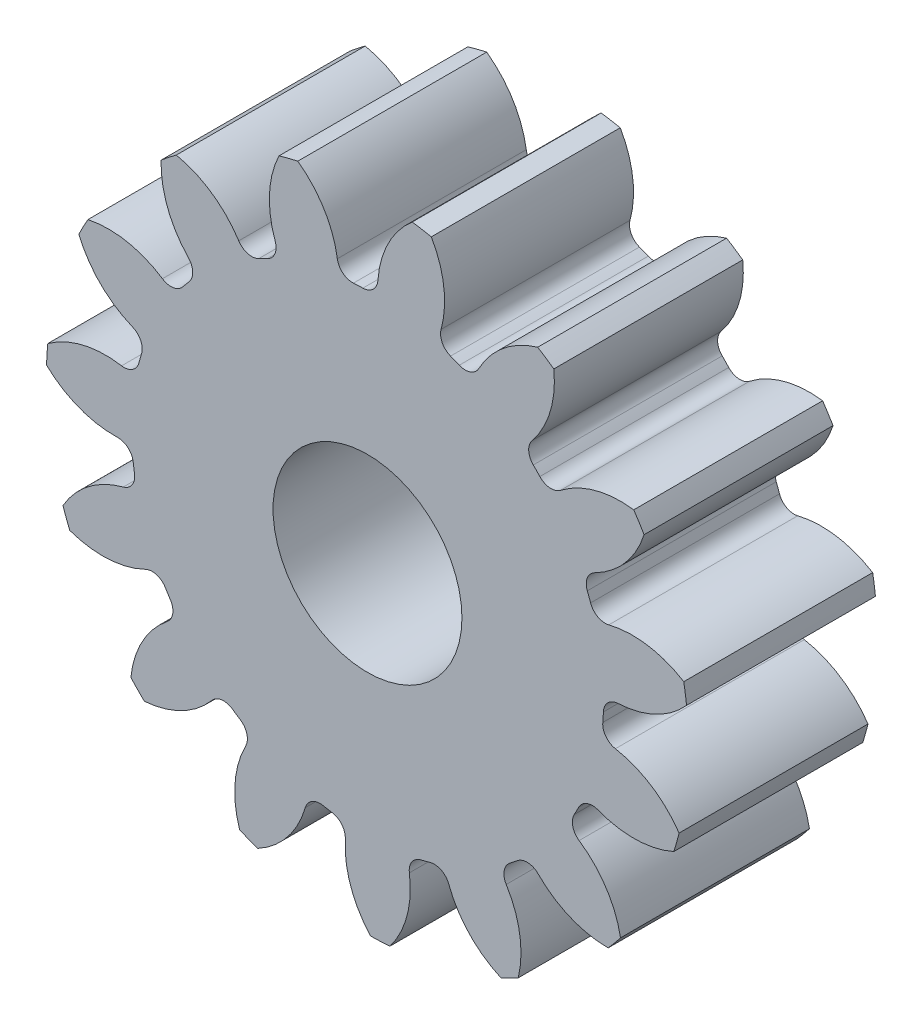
ISO-10303-21;
HEADER;
FILE_DESCRIPTION(('STEP AP214'),'2;1');
FILE_NAME('part.step','',(''),(''),'','','');
FILE_SCHEMA(('AUTOMOTIVE_DESIGN { 1 0 10303 214 1 1 1 1 }'));
ENDSEC;
DATA;
#1=APPLICATION_CONTEXT('core data for automotive mechanical design processes');
#2=APPLICATION_PROTOCOL_DEFINITION('international standard','automotive_design',2000,#1);
#3=PRODUCT_CONTEXT('',#1,'mechanical');
#4=PRODUCT('Part','Part','',(#3));
#5=PRODUCT_RELATED_PRODUCT_CATEGORY('part','',(#4));
#6=PRODUCT_DEFINITION_FORMATION('','',#4);
#7=PRODUCT_DEFINITION_CONTEXT('part definition',#1,'design');
#8=PRODUCT_DEFINITION('design','',#6,#7);
#9=PRODUCT_DEFINITION_SHAPE('','',#8);
#10=(LENGTH_UNIT() NAMED_UNIT(*) SI_UNIT(.MILLI.,.METRE.));
#11=(NAMED_UNIT(*) PLANE_ANGLE_UNIT() SI_UNIT($,.RADIAN.));
#12=(NAMED_UNIT(*) SI_UNIT($,.STERADIAN.) SOLID_ANGLE_UNIT());
#13=UNCERTAINTY_MEASURE_WITH_UNIT(LENGTH_MEASURE(1.E-05),#10,'distance_accuracy_value','');
#14=(GEOMETRIC_REPRESENTATION_CONTEXT(3) GLOBAL_UNCERTAINTY_ASSIGNED_CONTEXT((#13)) GLOBAL_UNIT_ASSIGNED_CONTEXT((#10,
#11,#12)) REPRESENTATION_CONTEXT('',''));
#15=CARTESIAN_POINT('',(0.,0.,0.));
#16=DIRECTION('',(0.,0.,1.));
#17=DIRECTION('',(1.,0.,0.));
#18=AXIS2_PLACEMENT_3D('',#15,#16,#17);
#19=CARTESIAN_POINT('',(0.,0.,101.6));
#20=DIRECTION('',(0.,0.,-1.));
#21=DIRECTION('',(-1.,0.,0.));
#22=AXIS2_PLACEMENT_3D('',#19,#20,#21);
#23=CYLINDRICAL_SURFACE('',#22,172.72);
#24=DIRECTION('',(0.,0.,-1.));
#25=VECTOR('',#24,1.);
#26=CARTESIAN_POINT('',(170.09912408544,29.9747624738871,50.8));
#27=LINE('',#26,#25);
#28=CARTESIAN_POINT('',(170.09912408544,29.9747624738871,101.6));
#29=VERTEX_POINT('',#28);
#30=CARTESIAN_POINT('',(170.09912408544,29.9747624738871,0.));
#31=VERTEX_POINT('',#30);
#32=EDGE_CURVE('E636',#29,#31,#27,.T.);
#33=ORIENTED_EDGE('',*,*,#32,.F.);
#34=CARTESIAN_POINT('',(0.,0.,101.6));
#35=DIRECTION('',(0.,0.,1.));
#36=DIRECTION('',(1.,0.,0.));
#37=AXIS2_PLACEMENT_3D('',#34,#35,#36);
#38=CIRCLE('',#37,172.72);
#39=CARTESIAN_POINT('',(171.597430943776,19.660114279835,101.6));
#40=VERTEX_POINT('',#39);
#41=EDGE_CURVE('E1167',#40,#29,#38,.T.);
#42=ORIENTED_EDGE('',*,*,#41,.F.);
#43=DIRECTION('',(0.,0.,-1.));
#44=VECTOR('',#43,1.);
#45=CARTESIAN_POINT('',(171.597430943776,19.660114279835,50.8));
#46=LINE('',#45,#44);
#47=CARTESIAN_POINT('',(171.597430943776,19.660114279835,0.));
#48=VERTEX_POINT('',#47);
#49=EDGE_CURVE('E1161',#48,#40,#46,.F.);
#50=ORIENTED_EDGE('',*,*,#49,.F.);
#51=CARTESIAN_POINT('',(0.,0.,0.));
#52=DIRECTION('',(0.,0.,1.));
#53=DIRECTION('',(1.,0.,0.));
#54=AXIS2_PLACEMENT_3D('',#51,#52,#53);
#55=CIRCLE('',#54,172.72);
#56=EDGE_CURVE('E1172',#48,#31,#55,.T.);
#57=ORIENTED_EDGE('',*,*,#56,.T.);
#58=EDGE_LOOP('',(#33,#42,#50,#57));
#59=FACE_BOUND('',#58,.T.);
#60=ADVANCED_FACE('F33',(#59),#23,.T.);
#61=DIRECTION('',(0.,0.,-1.));
#62=VECTOR('',#61,1.);
#63=CARTESIAN_POINT('',(148.76556469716,87.7553711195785,50.8));
#64=LINE('',#63,#62);
#65=CARTESIAN_POINT('',(148.76556469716,87.7553711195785,0.));
#66=VERTEX_POINT('',#65);
#67=CARTESIAN_POINT('',(148.76556469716,87.7553711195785,101.6));
#68=VERTEX_POINT('',#67);
#69=EDGE_CURVE('E607',#66,#68,#64,.F.);
#70=ORIENTED_EDGE('',*,*,#69,.F.);
#71=CARTESIAN_POINT('',(143.201447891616,96.5688548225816,0.));
#72=VERTEX_POINT('',#71);
#73=EDGE_CURVE('E1175',#66,#72,#55,.T.);
#74=ORIENTED_EDGE('',*,*,#73,.T.);
#75=DIRECTION('',(0.,0.,-1.));
#76=VECTOR('',#75,1.);
#77=CARTESIAN_POINT('',(143.201447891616,96.5688548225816,50.8));
#78=LINE('',#77,#76);
#79=CARTESIAN_POINT('',(143.201447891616,96.5688548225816,101.6));
#80=VERTEX_POINT('',#79);
#81=EDGE_CURVE('E669',#80,#72,#78,.T.);
#82=ORIENTED_EDGE('',*,*,#81,.F.);
#83=EDGE_CURVE('E1170',#68,#80,#38,.T.);
#84=ORIENTED_EDGE('',*,*,#83,.F.);
#85=EDGE_LOOP('',(#70,#74,#82,#84));
#86=FACE_BOUND('',#85,.T.);
#87=ADVANCED_FACE('F1346',(#86),#23,.T.);
#88=CARTESIAN_POINT('',(0.,0.,101.6));
#89=DIRECTION('',(0.,0.,1.));
#90=DIRECTION('',(1.,0.,0.));
#91=AXIS2_PLACEMENT_3D('',#88,#89,#90);
#92=PLANE('',#91);
#93=CARTESIAN_POINT('',(0.,0.,101.599999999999));
#94=DIRECTION('',(0.,0.,1.));
#95=DIRECTION('',(1.,0.,0.));
#96=AXIS2_PLACEMENT_3D('',#93,#94,#95);
#97=CIRCLE('',#96,50.8);
#98=CARTESIAN_POINT('',(50.8,0.,101.599999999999));
#99=VERTEX_POINT('',#98);
#100=EDGE_CURVE('E624',#99,#99,#97,.T.);
#101=ORIENTED_EDGE('',*,*,#100,.F.);
#102=EDGE_LOOP('',(#101));
#103=FACE_BOUND('',#102,.T.);
#104=ORIENTED_EDGE('',*,*,#41,.T.);
#105=CARTESIAN_POINT('',(142.432450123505,-14.8949435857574,101.6));
#106=DIRECTION('',(0.,0.,-1.));
#107=DIRECTION('',(0.913545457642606,0.406736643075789,0.));
#108=AXIS2_PLACEMENT_3D('',#105,#106,#107);
#109=CIRCLE('',#108,52.713711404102);
#110=CARTESIAN_POINT('',(129.790710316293,36.2804585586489,101.6));
#111=VERTEX_POINT('',#110);
#112=EDGE_CURVE('E616',#111,#29,#109,.T.);
#113=ORIENTED_EDGE('',*,*,#112,.F.);
#114=CARTESIAN_POINT('',(127.807351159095,44.3093536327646,101.6));
#115=DIRECTION('',(0.,0.,1.));
#116=DIRECTION('',(-0.913545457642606,-0.406736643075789,0.));
#117=AXIS2_PLACEMENT_3D('',#114,#115,#116);
#118=CIRCLE('',#117,8.27023999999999);
#119=CARTESIAN_POINT('',(119.993382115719,41.6003395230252,101.6));
#120=VERTEX_POINT('',#119);
#121=EDGE_CURVE('E614',#120,#111,#118,.T.);
#122=ORIENTED_EDGE('',*,*,#121,.F.);
#123=CARTESIAN_POINT('',(0.,0.,101.6));
#124=DIRECTION('',(0.,0.,-1.));
#125=DIRECTION('',(0.913545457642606,0.406736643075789,0.));
#126=AXIS2_PLACEMENT_3D('',#123,#124,#125);
#127=CIRCLE('',#126,127.);
#128=CARTESIAN_POINT('',(118.236714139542,46.3581646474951,101.6));
#129=VERTEX_POINT('',#128);
#130=EDGE_CURVE('E599',#129,#120,#127,.T.);
#131=ORIENTED_EDGE('',*,*,#130,.F.);
#132=CARTESIAN_POINT('',(125.936288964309,49.37700832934,101.6));
#133=DIRECTION('',(0.,0.,1.));
#134=DIRECTION('',(-0.913545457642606,-0.406736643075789,0.));
#135=AXIS2_PLACEMENT_3D('',#132,#133,#134);
#136=CIRCLE('',#135,8.27023999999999);
#137=CARTESIAN_POINT('',(122.226230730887,56.7683774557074,101.6));
#138=VERTEX_POINT('',#137);
#139=EDGE_CURVE('E591',#138,#129,#136,.T.);
#140=ORIENTED_EDGE('',*,*,#139,.F.);
#141=CARTESIAN_POINT('',(98.5786776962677,103.880250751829,101.6));
#142=DIRECTION('',(0.,0.,-1.));
#143=DIRECTION('',(-0.913545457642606,-0.406736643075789,0.));
#144=AXIS2_PLACEMENT_3D('',#141,#142,#143);
#145=CIRCLE('',#144,52.713711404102);
#146=EDGE_CURVE('E621',#68,#138,#145,.T.);
#147=ORIENTED_EDGE('',*,*,#146,.F.);
#148=ORIENTED_EDGE('',*,*,#83,.T.);
#149=CARTESIAN_POINT('',(136.176837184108,44.3252885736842,101.6));
#150=DIRECTION('',(0.,0.,-1.));
#151=DIRECTION('',(0.669130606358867,0.743144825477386,0.));
#152=AXIS2_PLACEMENT_3D('',#149,#150,#151);
#153=CIRCLE('',#152,52.713711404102);
#154=CARTESIAN_POINT('',(103.81312193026,85.9344859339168,101.6));
#155=VERTEX_POINT('',#154);
#156=EDGE_CURVE('E645',#155,#80,#153,.T.);
#157=ORIENTED_EDGE('',*,*,#156,.F.);
#158=CARTESIAN_POINT('',(98.7355873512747,92.4625417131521,101.6));
#159=DIRECTION('',(0.,0.,1.));
#160=DIRECTION('',(-0.669130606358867,-0.743144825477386,0.));
#161=AXIS2_PLACEMENT_3D('',#158,#159,#160);
#162=CIRCLE('',#161,8.27023999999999);
#163=CARTESIAN_POINT('',(92.6990267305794,86.8095066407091,101.6));
#164=VERTEX_POINT('',#163);
#165=EDGE_CURVE('E643',#164,#155,#162,.T.);
#166=ORIENTED_EDGE('',*,*,#165,.F.);
#167=CARTESIAN_POINT('',(0.,0.,101.6));
#168=DIRECTION('',(0.,0.,-1.));
#169=DIRECTION('',(0.669130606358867,0.743144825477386,0.));
#170=AXIS2_PLACEMENT_3D('',#167,#168,#169);
#171=CIRCLE('',#170,127.);
#172=CARTESIAN_POINT('',(89.1590488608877,90.4414949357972,101.6));
#173=VERTEX_POINT('',#172);
#174=EDGE_CURVE('E640',#173,#164,#171,.T.);
#175=ORIENTED_EDGE('',*,*,#174,.F.);
#176=CARTESIAN_POINT('',(94.9650861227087,96.3310450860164,101.6));
#177=DIRECTION('',(0.,0.,1.));
#178=DIRECTION('',(-0.669130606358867,-0.743144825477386,0.));
#179=AXIS2_PLACEMENT_3D('',#176,#177,#178);
#180=CIRCLE('',#179,8.27023999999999);
#181=CARTESIAN_POINT('',(88.5694386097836,101.574380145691,101.6));
#182=VERTEX_POINT('',#181);
#183=EDGE_CURVE('E638',#182,#173,#180,.T.);
#184=ORIENTED_EDGE('',*,*,#183,.F.);
#185=CARTESIAN_POINT('',(47.8041987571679,134.994891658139,101.6));
#186=DIRECTION('',(0.,0.,-1.));
#187=DIRECTION('',(-0.669130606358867,-0.743144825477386,0.));
#188=AXIS2_PLACEMENT_3D('',#185,#186,#187);
#189=CIRCLE('',#188,52.713711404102);
#190=CARTESIAN_POINT('',(100.210780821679,140.676927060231,101.6));
#191=VERTEX_POINT('',#190);
#192=EDGE_CURVE('E648',#191,#182,#189,.T.);
#193=ORIENTED_EDGE('',*,*,#192,.F.);
#194=CARTESIAN_POINT('',(91.5429404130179,146.465314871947,101.6));
#195=VERTEX_POINT('',#194);
#196=EDGE_CURVE('E1213',#191,#195,#38,.T.);
#197=ORIENTED_EDGE('',*,*,#196,.T.);
#198=CARTESIAN_POINT('',(106.375011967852,95.8812756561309,101.6));
#199=DIRECTION('',(0.,0.,-1.));
#200=DIRECTION('',(0.309016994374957,0.95105651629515,0.));
#201=AXIS2_PLACEMENT_3D('',#198,#199,#200);
#202=CIRCLE('',#201,52.713711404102);
#203=CARTESIAN_POINT('',(59.8853016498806,120.729660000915,101.6));
#204=VERTEX_POINT('',#203);
#205=EDGE_CURVE('E680',#204,#195,#202,.T.);
#206=ORIENTED_EDGE('',*,*,#205,.F.);
#207=CARTESIAN_POINT('',(52.5915435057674,124.628116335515,101.6));
#208=DIRECTION('',(0.,0.,1.));
#209=DIRECTION('',(-0.309016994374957,-0.95105651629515,0.));
#210=AXIS2_PLACEMENT_3D('',#207,#208,#209);
#211=CIRCLE('',#210,8.27023999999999);
#212=CARTESIAN_POINT('',(49.3761674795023,117.008521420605,101.6));
#213=VERTEX_POINT('',#212);
#214=EDGE_CURVE('E678',#213,#204,#211,.T.);
#215=ORIENTED_EDGE('',*,*,#214,.F.);
#216=CARTESIAN_POINT('',(0.,0.,101.6));
#217=DIRECTION('',(0.,0.,-1.));
#218=DIRECTION('',(0.309016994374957,0.95105651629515,0.));
#219=AXIS2_PLACEMENT_3D('',#216,#217,#218);
#220=CIRCLE('',#219,127.);
#221=CARTESIAN_POINT('',(44.6649740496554,118.886669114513,101.6));
#222=VERTEX_POINT('',#221);
#223=EDGE_CURVE('E675',#222,#213,#220,.T.);
#224=ORIENTED_EDGE('',*,*,#223,.F.);
#225=CARTESIAN_POINT('',(47.5735571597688,126.62856900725,101.6));
#226=DIRECTION('',(0.,0.,1.));
#227=DIRECTION('',(-0.309016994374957,-0.95105651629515,0.));
#228=AXIS2_PLACEMENT_3D('',#225,#226,#227);
#229=CIRCLE('',#228,8.27023999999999);
#230=CARTESIAN_POINT('',(39.5981859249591,128.817249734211,101.6));
#231=VERTEX_POINT('',#230);
#232=EDGE_CURVE('E673',#231,#222,#229,.T.);
#233=ORIENTED_EDGE('',*,*,#232,.F.);
#234=CARTESIAN_POINT('',(-11.2360604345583,142.767689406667,101.6));
#235=DIRECTION('',(0.,0.,-1.));
#236=DIRECTION('',(-0.309016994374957,-0.95105651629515,0.));
#237=AXIS2_PLACEMENT_3D('',#234,#235,#236);
#238=CIRCLE('',#237,52.713711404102);
#239=CARTESIAN_POINT('',(34.3286425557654,169.274164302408,101.6));
#240=VERTEX_POINT('',#239);
#241=EDGE_CURVE('E683',#240,#231,#238,.T.);
#242=ORIENTED_EDGE('',*,*,#241,.F.);
#243=CARTESIAN_POINT('',(24.0558268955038,171.03659138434,101.6));
#244=VERTEX_POINT('',#243);
#245=EDGE_CURVE('E1328',#240,#244,#38,.T.);
#246=ORIENTED_EDGE('',*,*,#245,.T.);
#247=CARTESIAN_POINT('',(58.1799807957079,130.858519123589,101.6));
#248=DIRECTION('',(0.,0.,-1.));
#249=DIRECTION('',(-0.104528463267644,0.994521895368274,0.));
#250=AXIS2_PLACEMENT_3D('',#247,#248,#249);
#251=CIRCLE('',#250,52.713711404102);
#252=CARTESIAN_POINT('',(5.60276867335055,134.649579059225,101.6));
#253=VERTEX_POINT('',#252);
#254=EDGE_CURVE('E718',#253,#244,#251,.T.);
#255=ORIENTED_EDGE('',*,*,#254,.F.);
#256=CARTESIAN_POINT('',(-2.64605599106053,135.244357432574,101.6));
#257=DIRECTION('',(0.,0.,1.));
#258=DIRECTION('',(0.104528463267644,-0.994521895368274,0.));
#259=AXIS2_PLACEMENT_3D('',#256,#257,#258);
#260=CIRCLE('',#259,8.27023999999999);
#261=CARTESIAN_POINT('',(-2.48427969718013,126.975699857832,101.6));
#262=VERTEX_POINT('',#261);
#263=EDGE_CURVE('E716',#262,#253,#260,.T.);
#264=ORIENTED_EDGE('',*,*,#263,.F.);
#265=CARTESIAN_POINT('',(0.,0.,101.6));
#266=DIRECTION('',(0.,0.,-1.));
#267=DIRECTION('',(-0.104528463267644,0.994521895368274,0.));
#268=AXIS2_PLACEMENT_3D('',#265,#266,#267);
#269=CIRCLE('',#268,127.);
#270=CARTESIAN_POINT('',(-7.55208054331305,126.775258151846,101.6));
#271=VERTEX_POINT('',#270);
#272=EDGE_CURVE('E713',#271,#262,#269,.T.);
#273=ORIENTED_EDGE('',*,*,#272,.F.);
#274=CARTESIAN_POINT('',(-8.04387202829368,135.030862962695,101.6));
#275=DIRECTION('',(0.,0.,1.));
#276=DIRECTION('',(0.104528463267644,-0.994521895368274,0.));
#277=AXIS2_PLACEMENT_3D('',#274,#275,#276);
#278=CIRCLE('',#277,8.27023999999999);
#279=CARTESIAN_POINT('',(-16.2199528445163,133.78644657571,101.6));
#280=VERTEX_POINT('',#279);
#281=EDGE_CURVE('E711',#280,#271,#278,.T.);
#282=ORIENTED_EDGE('',*,*,#281,.F.);
#283=CARTESIAN_POINT('',(-68.3335027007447,125.854656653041,101.6));
#284=DIRECTION('',(0.,0.,-1.));
#285=DIRECTION('',(0.104528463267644,-0.994521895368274,0.));
#286=AXIS2_PLACEMENT_3D('',#283,#284,#285);
#287=CIRCLE('',#286,52.713711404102);
#288=CARTESIAN_POINT('',(-37.4892298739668,168.602360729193,101.6));
#289=VERTEX_POINT('',#288);
#290=EDGE_CURVE('E721',#289,#280,#287,.T.);
#291=ORIENTED_EDGE('',*,*,#290,.F.);
#292=CARTESIAN_POINT('',(-47.5907576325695,166.034087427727,101.6));
#293=VERTEX_POINT('',#292);
#294=EDGE_CURVE('E1324',#289,#293,#38,.T.);
#295=ORIENTED_EDGE('',*,*,#294,.T.);
#296=CARTESIAN_POINT('',(-0.0748976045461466,143.209135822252,101.6));
#297=DIRECTION('',(0.,0.,-1.));
#298=DIRECTION('',(-0.499999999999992,0.866025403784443,0.));
#299=AXIS2_PLACEMENT_3D('',#296,#297,#298);
#300=CIRCLE('',#299,52.713711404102);
#301=CARTESIAN_POINT('',(-49.6485339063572,125.287362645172,101.6));
#302=VERTEX_POINT('',#301);
#303=EDGE_CURVE('E756',#302,#293,#300,.T.);
#304=ORIENTED_EDGE('',*,*,#303,.F.);
#305=CARTESIAN_POINT('',(-57.4261283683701,122.475620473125,101.6));
#306=DIRECTION('',(0.,0.,1.));
#307=DIRECTION('',(0.499999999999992,-0.866025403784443,0.));
#308=AXIS2_PLACEMENT_3D('',#305,#306,#307);
#309=CIRCLE('',#308,8.27023999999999);
#310=CARTESIAN_POINT('',(-53.9151723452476,114.98762625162,101.6));
#311=VERTEX_POINT('',#310);
#312=EDGE_CURVE('E754',#311,#302,#309,.T.);
#313=ORIENTED_EDGE('',*,*,#312,.F.);
#314=CARTESIAN_POINT('',(0.,0.,101.6));
#315=DIRECTION('',(0.,0.,-1.));
#316=DIRECTION('',(-0.499999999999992,0.866025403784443,0.));
#317=AXIS2_PLACEMENT_3D('',#314,#315,#316);
#318=CIRCLE('',#317,127.);
#319=CARTESIAN_POINT('',(-58.4633118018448,112.743253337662,101.6));
#320=VERTEX_POINT('',#319);
#321=EDGE_CURVE('E751',#320,#311,#318,.T.);
#322=ORIENTED_EDGE('',*,*,#321,.F.);
#323=CARTESIAN_POINT('',(-62.270442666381,120.085093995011,101.6));
#324=DIRECTION('',(0.,0.,1.));
#325=DIRECTION('',(0.499999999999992,-0.866025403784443,0.));
#326=AXIS2_PLACEMENT_3D('',#323,#324,#325);
#327=CIRCLE('',#326,8.27023999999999);
#328=CARTESIAN_POINT('',(-69.2335144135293,115.622751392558,101.6));
#329=VERTEX_POINT('',#328);
#330=EDGE_CURVE('E749',#329,#320,#327,.T.);
#331=ORIENTED_EDGE('',*,*,#330,.F.);
#332=CARTESIAN_POINT('',(-113.615461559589,87.1802104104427,101.6));
#333=DIRECTION('',(0.,0.,-1.));
#334=DIRECTION('',(0.499999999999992,-0.866025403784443,0.));
#335=AXIS2_PLACEMENT_3D('',#332,#333,#334);
#336=CIRCLE('',#335,52.713711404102);
#337=CARTESIAN_POINT('',(-102.824873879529,138.777677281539,101.6));
#338=VERTEX_POINT('',#337);
#339=EDGE_CURVE('E759',#338,#329,#336,.T.);
#340=ORIENTED_EDGE('',*,*,#339,.F.);
#341=CARTESIAN_POINT('',(-111.008467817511,132.322781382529,101.6));
#342=VERTEX_POINT('',#341);
#343=EDGE_CURVE('E1320',#338,#342,#38,.T.);
#344=ORIENTED_EDGE('',*,*,#343,.T.);
#345=CARTESIAN_POINT('',(-58.3168255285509,130.797591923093,101.6));
#346=DIRECTION('',(0.,0.,-1.));
#347=DIRECTION('',(-0.809016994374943,0.58778525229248,0.));
#348=AXIS2_PLACEMENT_3D('',#345,#346,#347);
#349=CIRCLE('',#348,52.713711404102);
#350=CARTESIAN_POINT('',(-96.3151539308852,94.2618230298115,101.6));
#351=VERTEX_POINT('',#350);
#352=EDGE_CURVE('E794',#351,#342,#349,.T.);
#353=ORIENTED_EDGE('',*,*,#352,.F.);
#354=CARTESIAN_POINT('',(-102.27670145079,88.529736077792,101.6));
#355=DIRECTION('',(0.,0.,1.));
#356=DIRECTION('',(0.809016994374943,-0.58778525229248,0.));
#357=AXIS2_PLACEMENT_3D('',#354,#355,#356);
#358=CIRCLE('',#357,8.27023999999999);
#359=CARTESIAN_POINT('',(-96.0236418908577,83.1171474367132,101.6));
#360=VERTEX_POINT('',#359);
#361=EDGE_CURVE('E792',#360,#351,#358,.T.);
#362=ORIENTED_EDGE('',*,*,#361,.F.);
#363=CARTESIAN_POINT('',(0.,0.,101.6));
#364=DIRECTION('',(0.,0.,-1.));
#365=DIRECTION('',(-0.809016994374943,0.58778525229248,0.));
#366=AXIS2_PLACEMENT_3D('',#363,#364,#365);
#367=CIRCLE('',#366,127.);
#368=CARTESIAN_POINT('',(-99.2657053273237,79.216915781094,101.6));
#369=VERTEX_POINT('',#368);
#370=EDGE_CURVE('E789',#369,#360,#367,.T.);
#371=ORIENTED_EDGE('',*,*,#370,.F.);
#372=CARTESIAN_POINT('',(-105.729888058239,84.3755213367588,101.6));
#373=DIRECTION('',(0.,0.,1.));
#374=DIRECTION('',(0.809016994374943,-0.58778525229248,0.));
#375=AXIS2_PLACEMENT_3D('',#372,#373,#374);
#376=CIRCLE('',#375,8.27023999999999);
#377=CARTESIAN_POINT('',(-110.27597237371,77.4668320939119,101.6));
#378=VERTEX_POINT('',#377);
#379=EDGE_CURVE('E787',#378,#369,#376,.T.);
#380=ORIENTED_EDGE('',*,*,#379,.F.);
#381=CARTESIAN_POINT('',(-139.252274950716,33.4315137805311,101.6));
#382=DIRECTION('',(0.,0.,-1.));
#383=DIRECTION('',(0.809016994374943,-0.58778525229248,0.));
#384=AXIS2_PLACEMENT_3D('',#381,#382,#383);
#385=CIRCLE('',#384,52.713711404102);
#386=CARTESIAN_POINT('',(-150.381163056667,84.9570726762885,101.6));
#387=VERTEX_POINT('',#386);
#388=EDGE_CURVE('E797',#387,#378,#385,.T.);
#389=ORIENTED_EDGE('',*,*,#388,.F.);
#390=CARTESIAN_POINT('',(-155.231805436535,75.7316643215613,101.6));
#391=VERTEX_POINT('',#390);
#392=EDGE_CURVE('E1316',#387,#391,#38,.T.);
#393=ORIENTED_EDGE('',*,*,#392,.T.);
#394=CARTESIAN_POINT('',(-106.475244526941,95.7699561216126,101.6));
#395=DIRECTION('',(0.,0.,-1.));
#396=DIRECTION('',(-0.978147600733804,0.207911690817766,0.));
#397=AXIS2_PLACEMENT_3D('',#394,#395,#396);
#398=CIRCLE('',#397,52.713711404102);
#399=CARTESIAN_POINT('',(-126.328008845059,46.9375578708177,101.6));
#400=VERTEX_POINT('',#399);
#401=EDGE_CURVE('E832',#400,#391,#398,.T.);
#402=ORIENTED_EDGE('',*,*,#401,.F.);
#403=CARTESIAN_POINT('',(-129.442703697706,39.2762560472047,101.6));
#404=DIRECTION('',(0.,0.,1.));
#405=DIRECTION('',(0.978147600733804,-0.207911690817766,0.));
#406=AXIS2_PLACEMENT_3D('',#403,#404,#405);
#407=CIRCLE('',#406,8.27023999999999);
#408=CARTESIAN_POINT('',(-121.528751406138,36.8749587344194,101.6));
#409=VERTEX_POINT('',#408);
#410=EDGE_CURVE('E830',#409,#400,#407,.T.);
#411=ORIENTED_EDGE('',*,*,#410,.F.);
#412=CARTESIAN_POINT('',(0.,0.,101.6));
#413=DIRECTION('',(0.,0.,-1.));
#414=DIRECTION('',(-0.978147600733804,0.207911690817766,0.));
#415=AXIS2_PLACEMENT_3D('',#412,#413,#414);
#416=CIRCLE('',#415,127.);
#417=CARTESIAN_POINT('',(-122.904156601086,31.9932538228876,101.6));
#418=VERTEX_POINT('',#417);
#419=EDGE_CURVE('E827',#418,#409,#416,.T.);
#420=ORIENTED_EDGE('',*,*,#419,.F.);
#421=CARTESIAN_POINT('',(-130.907675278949,34.076654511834,101.6));
#422=DIRECTION('',(0.,0.,1.));
#423=DIRECTION('',(0.978147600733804,-0.207911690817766,0.));
#424=AXIS2_PLACEMENT_3D('',#421,#422,#423);
#425=CIRCLE('',#424,8.27023999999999);
#426=CARTESIAN_POINT('',(-132.250712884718,25.9161937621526,101.6));
#427=VERTEX_POINT('',#426);
#428=EDGE_CURVE('E825',#427,#418,#425,.T.);
#429=ORIENTED_EDGE('',*,*,#428,.F.);
#430=CARTESIAN_POINT('',(-140.81110493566,-26.0977952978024,101.6));
#431=DIRECTION('',(0.,0.,-1.));
#432=DIRECTION('',(0.978147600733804,-0.207911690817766,0.));
#433=AXIS2_PLACEMENT_3D('',#430,#431,#432);
#434=CIRCLE('',#433,52.713711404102);
#435=CARTESIAN_POINT('',(-171.93518297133,16.4466183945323,101.6));
#436=VERTEX_POINT('',#435);
#437=EDGE_CURVE('E835',#436,#427,#434,.T.);
#438=ORIENTED_EDGE('',*,*,#437,.F.);
#439=CARTESIAN_POINT('',(-172.614153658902,6.04585449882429,101.6));
#440=VERTEX_POINT('',#439);
#441=EDGE_CURVE('E1312',#436,#440,#38,.T.);
#442=ORIENTED_EDGE('',*,*,#441,.T.);
#443=CARTESIAN_POINT('',(-136.223126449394,44.1828248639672,101.6));
#444=DIRECTION('',(0.,0.,-1.));
#445=DIRECTION('',(-0.978147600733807,-0.207911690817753,0.));
#446=AXIS2_PLACEMENT_3D('',#443,#444,#445);
#447=CIRCLE('',#446,52.713711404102);
#448=CARTESIAN_POINT('',(-134.49760337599,-8.50263745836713,101.6));
#449=VERTEX_POINT('',#448);
#450=EDGE_CURVE('E870',#449,#440,#447,.T.);
#451=ORIENTED_EDGE('',*,*,#450,.F.);
#452=CARTESIAN_POINT('',(-134.226886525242,-16.7684454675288,101.6));
#453=DIRECTION('',(0.,0.,1.));
#454=DIRECTION('',(0.978147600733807,0.207911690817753,0.));
#455=AXIS2_PLACEMENT_3D('',#452,#453,#454);
#456=CIRCLE('',#455,8.27023999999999);
#457=CARTESIAN_POINT('',(-126.020435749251,-15.7432453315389,101.6));
#458=VERTEX_POINT('',#457);
#459=EDGE_CURVE('E868',#458,#449,#456,.T.);
#460=ORIENTED_EDGE('',*,*,#459,.F.);
#461=CARTESIAN_POINT('',(0.,0.,101.6));
#462=DIRECTION('',(0.,0.,-1.));
#463=DIRECTION('',(-0.978147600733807,-0.207911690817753,0.));
#464=AXIS2_PLACEMENT_3D('',#461,#462,#463);
#465=CIRCLE('',#464,127.);
#466=CARTESIAN_POINT('',(-125.29136264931,-20.7623323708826,101.6));
#467=VERTEX_POINT('',#466);
#468=EDGE_CURVE('E865',#467,#458,#465,.T.);
#469=ORIENTED_EDGE('',*,*,#468,.F.);
#470=CARTESIAN_POINT('',(-133.450336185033,-22.1143754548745,101.6));
#471=DIRECTION('',(0.,0.,1.));
#472=DIRECTION('',(0.978147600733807,0.207911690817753,0.));
#473=AXIS2_PLACEMENT_3D('',#470,#471,#472);
#474=CIRCLE('',#473,8.27023999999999);
#475=CARTESIAN_POINT('',(-131.35810367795,-30.1155899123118,101.6));
#476=VERTEX_POINT('',#475);
#477=EDGE_CURVE('E863',#476,#467,#474,.T.);
#478=ORIENTED_EDGE('',*,*,#477,.F.);
#479=CARTESIAN_POINT('',(-118.0224156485,-81.1145584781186,101.6));
#480=DIRECTION('',(0.,0.,-1.));
#481=DIRECTION('',(0.978147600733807,0.207911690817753,0.));
#482=AXIS2_PLACEMENT_3D('',#479,#480,#481);
#483=CIRCLE('',#482,52.713711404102);
#484=CARTESIAN_POINT('',(-163.760047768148,-54.9076056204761,101.6));
#485=VERTEX_POINT('',#484);
#486=EDGE_CURVE('E873',#485,#476,#483,.T.);
#487=ORIENTED_EDGE('',*,*,#486,.F.);
#488=CARTESIAN_POINT('',(-160.149946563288,-64.6853384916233,101.6));
#489=VERTEX_POINT('',#488);
#490=EDGE_CURVE('E1308',#485,#489,#38,.T.);
#491=ORIENTED_EDGE('',*,*,#490,.T.);
#492=CARTESIAN_POINT('',(-142.416792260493,-15.0439182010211,101.6));
#493=DIRECTION('',(0.,0.,-1.));
#494=DIRECTION('',(-0.80901699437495,-0.587785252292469,0.));
#495=AXIS2_PLACEMENT_3D('',#492,#493,#494);
#496=CIRCLE('',#495,52.713711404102);
#497=CARTESIAN_POINT('',(-119.411340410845,-62.4726495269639,101.6));
#498=VERTEX_POINT('',#497);
#499=EDGE_CURVE('E908',#498,#489,#496,.T.);
#500=ORIENTED_EDGE('',*,*,#499,.F.);
#501=CARTESIAN_POINT('',(-115.802021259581,-69.9137304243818,101.6));
#502=DIRECTION('',(0.,0.,1.));
#503=DIRECTION('',(0.80901699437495,0.587785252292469,0.));
#504=AXIS2_PLACEMENT_3D('',#501,#502,#503);
#505=CIRCLE('',#504,8.27023999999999);
#506=CARTESIAN_POINT('',(-108.7220418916,-65.6392992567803,101.6));
#507=VERTEX_POINT('',#506);
#508=EDGE_CURVE('E906',#507,#498,#505,.T.);
#509=ORIENTED_EDGE('',*,*,#508,.F.);
#510=CARTESIAN_POINT('',(0.,0.,101.6));
#511=DIRECTION('',(0.,0.,-1.));
#512=DIRECTION('',(-0.80901699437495,-0.587785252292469,0.));
#513=AXIS2_PLACEMENT_3D('',#510,#511,#512);
#514=CIRCLE('',#513,127.);
#515=CARTESIAN_POINT('',(-106.014553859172,-69.927922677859,101.6));
#516=VERTEX_POINT('',#515);
#517=EDGE_CURVE('E903',#516,#507,#514,.T.);
#518=ORIENTED_EDGE('',*,*,#517,.F.);
#519=CARTESIAN_POINT('',(-112.918221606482,-74.4816290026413,101.6));
#520=DIRECTION('',(0.,0.,1.));
#521=DIRECTION('',(0.80901699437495,0.587785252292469,0.));
#522=AXIS2_PLACEMENT_3D('',#519,#520,#521);
#523=CIRCLE('',#522,8.27023999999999);
#524=CARTESIAN_POINT('',(-107.752484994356,-80.9401144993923,101.6));
#525=VERTEX_POINT('',#524);
#526=EDGE_CURVE('E901',#525,#516,#523,.T.);
#527=ORIENTED_EDGE('',*,*,#526,.F.);
#528=CARTESIAN_POINT('',(-74.8265784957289,-122.105877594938,101.6));
#529=DIRECTION('',(0.,0.,-1.));
#530=DIRECTION('',(0.80901699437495,0.587785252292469,0.));
#531=AXIS2_PLACEMENT_3D('',#528,#529,#530);
#532=CIRCLE('',#531,52.713711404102);
#533=CARTESIAN_POINT('',(-127.269312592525,-116.767805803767,101.6));
#534=VERTEX_POINT('',#533);
#535=EDGE_CURVE('E911',#534,#525,#532,.T.);
#536=ORIENTED_EDGE('',*,*,#535,.F.);
#537=CARTESIAN_POINT('',(-119.994358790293,-124.231848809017,101.6));
#538=VERTEX_POINT('',#537);
#539=EDGE_CURVE('E1304',#534,#538,#38,.T.);
#540=ORIENTED_EDGE('',*,*,#539,.T.);
#541=CARTESIAN_POINT('',(-123.985300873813,-71.6694311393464,101.6));
#542=DIRECTION('',(0.,0.,-1.));
#543=DIRECTION('',(-0.500000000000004,-0.866025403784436,0.));
#544=AXIS2_PLACEMENT_3D('',#541,#542,#543);
#545=CIRCLE('',#544,52.713711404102);
#546=CARTESIAN_POINT('',(-83.6777718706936,-105.640572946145,101.6));
#547=VERTEX_POINT('',#546);
#548=EDGE_CURVE('E946',#547,#538,#545,.T.);
#549=ORIENTED_EDGE('',*,*,#548,.F.);
#550=CARTESIAN_POINT('',(-77.3539344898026,-110.970296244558,101.6));
#551=DIRECTION('',(0.,0.,1.));
#552=DIRECTION('',(0.500000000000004,0.866025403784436,0.));
#553=AXIS2_PLACEMENT_3D('',#550,#551,#552);
#554=CIRCLE('',#553,8.27023999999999);
#555=CARTESIAN_POINT('',(-72.6246192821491,-104.185722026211,101.6));
#556=VERTEX_POINT('',#555);
#557=EDGE_CURVE('E944',#556,#547,#554,.T.);
#558=ORIENTED_EDGE('',*,*,#557,.F.);
#559=CARTESIAN_POINT('',(0.,0.,101.6));
#560=DIRECTION('',(0.,0.,-1.));
#561=DIRECTION('',(-0.500000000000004,-0.866025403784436,0.));
#562=AXIS2_PLACEMENT_3D('',#559,#560,#561);
#563=CIRCLE('',#562,127.);
#564=CARTESIAN_POINT('',(-68.4068655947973,-107.0023398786,101.6));
#565=VERTEX_POINT('',#564);
#566=EDGE_CURVE('E941',#565,#556,#563,.T.);
#567=ORIENTED_EDGE('',*,*,#566,.F.);
#568=CARTESIAN_POINT('',(-72.8615206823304,-113.970332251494,101.6));
#569=DIRECTION('',(0.,0.,1.));
#570=DIRECTION('',(0.500000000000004,0.866025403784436,0.));
#571=AXIS2_PLACEMENT_3D('',#568,#569,#570);
#572=CIRCLE('',#571,8.27023999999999);
#573=CARTESIAN_POINT('',(-65.5154827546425,-117.769357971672,101.6));
#574=VERTEX_POINT('',#573);
#575=EDGE_CURVE('E939',#574,#565,#572,.T.);
#576=ORIENTED_EDGE('',*,*,#575,.F.);
#577=CARTESIAN_POINT('',(-18.6925461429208,-141.98398117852,101.6));
#578=DIRECTION('',(0.,0.,-1.));
#579=DIRECTION('',(0.500000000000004,0.866025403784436,0.));
#580=AXIS2_PLACEMENT_3D('',#577,#578,#579);
#581=CIRCLE('',#580,52.713711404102);
#582=CARTESIAN_POINT('',(-68.7725570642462,-158.437791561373,101.6));
#583=VERTEX_POINT('',#582);
#584=EDGE_CURVE('E949',#583,#574,#581,.T.);
#585=ORIENTED_EDGE('',*,*,#584,.F.);
#586=CARTESIAN_POINT('',(-59.090656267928,-162.297543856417,101.6));
#587=VERTEX_POINT('',#586);
#588=EDGE_CURVE('E1300',#583,#587,#38,.T.);
#589=ORIENTED_EDGE('',*,*,#588,.T.);
#590=CARTESIAN_POINT('',(-84.1156245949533,-115.902648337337,101.6));
#591=DIRECTION('',(0.,0.,-1.));
#592=DIRECTION('',(-0.104528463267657,-0.994521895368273,0.));
#593=AXIS2_PLACEMENT_3D('',#590,#591,#592);
#594=CIRCLE('',#593,52.713711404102);
#595=CARTESIAN_POINT('',(-33.4755563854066,-130.542281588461,101.6));
#596=VERTEX_POINT('',#595);
#597=EDGE_CURVE('E984',#596,#587,#594,.T.);
#598=ORIENTED_EDGE('',*,*,#597,.F.);
#599=CARTESIAN_POINT('',(-25.5306497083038,-132.839089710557,101.6));
#600=DIRECTION('',(0.,0.,1.));
#601=DIRECTION('',(0.104528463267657,0.994521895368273,0.));
#602=AXIS2_PLACEMENT_3D('',#599,#600,#601);
#603=CIRCLE('',#602,8.27023999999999);
#604=CARTESIAN_POINT('',(-23.9697402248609,-124.717486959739,101.6));
#605=VERTEX_POINT('',#604);
#606=EDGE_CURVE('E982',#605,#596,#603,.T.);
#607=ORIENTED_EDGE('',*,*,#606,.F.);
#608=CARTESIAN_POINT('',(0.,0.,101.6));
#609=DIRECTION('',(0.,0.,-1.));
#610=DIRECTION('',(-0.104528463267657,-0.994521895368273,0.));
#611=AXIS2_PLACEMENT_3D('',#608,#609,#610);
#612=CIRCLE('',#611,127.);
#613=CARTESIAN_POINT('',(-18.9710088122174,-125.57508042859,101.6));
#614=VERTEX_POINT('',#613);
#615=EDGE_CURVE('E979',#614,#605,#612,.T.);
#616=ORIENTED_EDGE('',*,*,#615,.F.);
#617=CARTESIAN_POINT('',(-20.2064009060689,-133.752529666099,101.6));
#618=DIRECTION('',(0.,0.,1.));
#619=DIRECTION('',(0.104528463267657,0.994521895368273,0.));
#620=AXIS2_PLACEMENT_3D('',#617,#618,#619);
#621=CIRCLE('',#620,8.27023999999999);
#622=CARTESIAN_POINT('',(-11.9502583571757,-134.23520954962,101.6));
#623=VERTEX_POINT('',#622);
#624=EDGE_CURVE('E977',#623,#614,#621,.T.);
#625=ORIENTED_EDGE('',*,*,#624,.F.);
#626=CARTESIAN_POINT('',(40.673597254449,-137.31176453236,101.6));
#627=DIRECTION('',(0.,0.,-1.));
#628=DIRECTION('',(0.104528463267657,0.994521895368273,0.));
#629=AXIS2_PLACEMENT_3D('',#626,#627,#628);
#630=CIRCLE('',#629,52.713711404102);
#631=CARTESIAN_POINT('',(1.61559835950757,-172.712443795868,101.6));
#632=VERTEX_POINT('',#631);
#633=EDGE_CURVE('E987',#632,#623,#630,.T.);
#634=ORIENTED_EDGE('',*,*,#633,.F.);
#635=CARTESIAN_POINT('',(12.0303575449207,-172.300519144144,101.6));
#636=VERTEX_POINT('',#635);
#637=EDGE_CURVE('E1296',#632,#636,#38,.T.);
#638=ORIENTED_EDGE('',*,*,#637,.T.);
#639=CARTESIAN_POINT('',(-29.7015926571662,-140.095244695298,101.6));
#640=DIRECTION('',(0.,0.,-1.));
#641=DIRECTION('',(0.309016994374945,-0.951056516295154,0.));
#642=AXIS2_PLACEMENT_3D('',#639,#640,#641);
#643=CIRCLE('',#642,52.713711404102);
#644=CARTESIAN_POINT('',(22.5148869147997,-132.872043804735,101.6));
#645=VERTEX_POINT('',#644);
#646=EDGE_CURVE('E1022',#645,#636,#643,.T.);
#647=ORIENTED_EDGE('',*,*,#646,.F.);
#648=CARTESIAN_POINT('',(30.7071163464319,-131.738797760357,101.6));
#649=DIRECTION('',(0.,0.,1.));
#650=DIRECTION('',(-0.309016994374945,0.951056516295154,0.));
#651=AXIS2_PLACEMENT_3D('',#648,#649,#650);
#652=CIRCLE('',#651,8.27023999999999);
#653=CARTESIAN_POINT('',(28.8297246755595,-123.684465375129,101.6));
#654=VERTEX_POINT('',#653);
#655=EDGE_CURVE('E1020',#654,#645,#652,.T.);
#656=ORIENTED_EDGE('',*,*,#655,.F.);
#657=CARTESIAN_POINT('',(0.,0.,101.6));
#658=DIRECTION('',(0.,0.,-1.));
#659=DIRECTION('',(0.309016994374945,-0.951056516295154,0.));
#660=AXIS2_PLACEMENT_3D('',#657,#658,#659);
#661=CIRCLE('',#660,127.);
#662=CARTESIAN_POINT('',(33.7451077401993,-122.434748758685,101.6));
#663=VERTEX_POINT('',#662);
#664=EDGE_CURVE('E1017',#663,#654,#661,.T.);
#665=ORIENTED_EDGE('',*,*,#664,.F.);
#666=CARTESIAN_POINT('',(35.9425891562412,-130.407699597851,101.6));
#667=DIRECTION('',(0.,0.,1.));
#668=DIRECTION('',(-0.309016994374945,0.951056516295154,0.));
#669=AXIS2_PLACEMENT_3D('',#666,#667,#668);
#670=CIRCLE('',#669,8.27023999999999);
#671=CARTESIAN_POINT('',(43.6812742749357,-127.490573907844,101.6));
#672=VERTEX_POINT('',#671);
#673=EDGE_CURVE('E1015',#672,#663,#670,.T.);
#674=ORIENTED_EDGE('',*,*,#673,.F.);
#675=CARTESIAN_POINT('',(93.0069061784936,-108.897096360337,101.6));
#676=DIRECTION('',(0.,0.,-1.));
#677=DIRECTION('',(-0.309016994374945,0.951056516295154,0.));
#678=AXIS2_PLACEMENT_3D('',#675,#676,#677);
#679=CIRCLE('',#678,52.713711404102);
#680=CARTESIAN_POINT('',(71.7244021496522,-157.123545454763,101.6));
#681=VERTEX_POINT('',#680);
#682=EDGE_CURVE('E1025',#681,#672,#679,.T.);
#683=ORIENTED_EDGE('',*,*,#682,.F.);
#684=CARTESIAN_POINT('',(81.0712132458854,-152.511169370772,101.6));
#685=VERTEX_POINT('',#684);
#686=EDGE_CURVE('E1292',#681,#685,#38,.T.);
#687=ORIENTED_EDGE('',*,*,#686,.T.);
#688=CARTESIAN_POINT('',(29.8481144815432,-140.064100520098,101.6));
#689=DIRECTION('',(0.,0.,-1.));
#690=DIRECTION('',(0.669130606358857,-0.743144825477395,0.));
#691=AXIS2_PLACEMENT_3D('',#688,#689,#690);
#692=CIRCLE('',#691,52.713711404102);
#693=CARTESIAN_POINT('',(74.6123017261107,-112.227022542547,101.6));
#694=VERTEX_POINT('',#693);
#695=EDGE_CURVE('E1060',#694,#685,#692,.T.);
#696=ORIENTED_EDGE('',*,*,#695,.F.);
#697=CARTESIAN_POINT('',(81.6353430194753,-107.859670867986,101.6));
#698=DIRECTION('',(0.,0.,1.));
#699=DIRECTION('',(-0.669130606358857,0.743144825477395,0.));
#700=AXIS2_PLACEMENT_3D('',#697,#698,#699);
#701=CIRCLE('',#700,8.27023999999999);
#702=CARTESIAN_POINT('',(76.6442682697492,-101.265276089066,101.6));
#703=VERTEX_POINT('',#702);
#704=EDGE_CURVE('E1058',#703,#694,#701,.T.);
#705=ORIENTED_EDGE('',*,*,#704,.F.);
#706=CARTESIAN_POINT('',(0.,0.,101.6));
#707=DIRECTION('',(0.,0.,-1.));
#708=DIRECTION('',(0.669130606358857,-0.743144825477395,0.));
#709=AXIS2_PLACEMENT_3D('',#706,#707,#708);
#710=CIRCLE('',#709,127.);
#711=CARTESIAN_POINT('',(80.6263885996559,-98.1243367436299,101.6));
#712=VERTEX_POINT('',#711);
#713=EDGE_CURVE('E1055',#712,#703,#710,.T.);
#714=ORIENTED_EDGE('',*,*,#713,.F.);
#715=CARTESIAN_POINT('',(85.8767790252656,-104.514193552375,101.6));
#716=DIRECTION('',(0.,0.,1.));
#717=DIRECTION('',(-0.669130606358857,0.743144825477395,0.));
#718=AXIS2_PLACEMENT_3D('',#715,#716,#717);
#719=CIRCLE('',#718,8.27023999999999);
#720=CARTESIAN_POINT('',(91.7599177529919,-98.7016598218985,101.6));
#721=VERTEX_POINT('',#720);
#722=EDGE_CURVE('E1053',#721,#712,#719,.T.);
#723=ORIENTED_EDGE('',*,*,#722,.F.);
#724=CARTESIAN_POINT('',(129.25847608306,-61.6531309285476,101.6));
#725=DIRECTION('',(0.,0.,-1.));
#726=DIRECTION('',(-0.669130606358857,0.743144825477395,0.));
#727=AXIS2_PLACEMENT_3D('',#724,#725,#726);
#728=CIRCLE('',#727,52.713711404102);
#729=CARTESIAN_POINT('',(129.431405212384,-114.366558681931,101.6));
#730=VERTEX_POINT('',#729);
#731=EDGE_CURVE('E1063',#730,#721,#728,.T.);
#732=ORIENTED_EDGE('',*,*,#731,.F.);
#733=CARTESIAN_POINT('',(136.094119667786,-106.351252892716,101.6));
#734=VERTEX_POINT('',#733);
#735=EDGE_CURVE('E1291',#730,#734,#38,.T.);
#736=ORIENTED_EDGE('',*,*,#735,.T.);
#737=CARTESIAN_POINT('',(84.2368114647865,-115.814600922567,101.6));
#738=DIRECTION('',(0.,0.,-1.));
#739=DIRECTION('',(0.913545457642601,-0.406736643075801,0.));
#740=AXIS2_PLACEMENT_3D('',#737,#738,#739);
#741=CIRCLE('',#740,52.713711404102);
#742=CARTESIAN_POINT('',(113.808571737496,-72.1769295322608,101.6));
#743=VERTEX_POINT('',#742);
#744=EDGE_CURVE('E1098',#743,#734,#741,.T.);
#745=ORIENTED_EDGE('',*,*,#744,.F.);
#746=CARTESIAN_POINT('',(118.448077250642,-65.3306270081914,101.6));
#747=DIRECTION('',(0.,0.,1.));
#748=DIRECTION('',(-0.913545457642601,0.406736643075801,0.));
#749=AXIS2_PLACEMENT_3D('',#746,#747,#748);
#750=CIRCLE('',#749,8.27023999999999);
#751=CARTESIAN_POINT('',(111.206321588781,-61.336400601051,101.6));
#752=VERTEX_POINT('',#751);
#753=EDGE_CURVE('E1096',#752,#743,#750,.T.);
#754=ORIENTED_EDGE('',*,*,#753,.F.);
#755=CARTESIAN_POINT('',(0.,0.,101.6));
#756=DIRECTION('',(0.,0.,-1.));
#757=DIRECTION('',(0.913545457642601,-0.406736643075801,0.));
#758=AXIS2_PLACEMENT_3D('',#755,#756,#757);
#759=CIRCLE('',#758,127.);
#760=CARTESIAN_POINT('',(113.566634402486,-56.8473354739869,101.6));
#761=VERTEX_POINT('',#760);
#762=EDGE_CURVE('E1093',#761,#752,#759,.T.);
#763=ORIENTED_EDGE('',*,*,#762,.F.);
#764=CARTESIAN_POINT('',(120.962093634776,-60.5492339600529,101.6));
#765=DIRECTION('',(0.,0.,1.));
#766=DIRECTION('',(-0.913545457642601,0.406736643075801,0.));
#767=AXIS2_PLACEMENT_3D('',#764,#765,#766);
#768=CIRCLE('',#767,8.27023999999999);
#769=CARTESIAN_POINT('',(123.972437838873,-52.846332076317,101.6));
#770=VERTEX_POINT('',#769);
#771=EDGE_CURVE('E1091',#770,#761,#768,.T.);
#772=ORIENTED_EDGE('',*,*,#771,.F.);
#773=CARTESIAN_POINT('',(143.160081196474,-3.74877905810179,101.6));
#774=DIRECTION('',(0.,0.,-1.));
#775=DIRECTION('',(-0.913545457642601,0.406736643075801,0.));
#776=AXIS2_PLACEMENT_3D('',#773,#774,#775);
#777=CIRCLE('',#776,52.713711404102);
#778=CARTESIAN_POINT('',(164.758542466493,-51.8345549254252,101.6));
#779=VERTEX_POINT('',#778);
#780=EDGE_CURVE('E1101',#779,#770,#777,.T.);
#781=ORIENTED_EDGE('',*,*,#780,.F.);
#782=CARTESIAN_POINT('',(167.585116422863,-41.8022386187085,101.6));
#783=VERTEX_POINT('',#782);
#784=EDGE_CURVE('E1171',#779,#783,#38,.T.);
#785=ORIENTED_EDGE('',*,*,#784,.T.);
#786=CARTESIAN_POINT('',(124.06019847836,-71.5397046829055,101.6));
#787=DIRECTION('',(0.,0.,-1.));
#788=DIRECTION('',(1.,0.,0.));
#789=AXIS2_PLACEMENT_3D('',#786,#787,#788);
#790=CIRCLE('',#789,52.713711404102);
#791=CARTESIAN_POINT('',(133.326305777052,-19.6467896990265,101.6));
#792=VERTEX_POINT('',#791);
#793=EDGE_CURVE('E1136',#792,#783,#790,.T.);
#794=ORIENTED_EDGE('',*,*,#793,.F.);
#795=CARTESIAN_POINT('',(134.780062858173,-11.5053242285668,101.6));
#796=DIRECTION('',(0.,0.,1.));
#797=DIRECTION('',(-1.,0.,0.));
#798=AXIS2_PLACEMENT_3D('',#795,#796,#797);
#799=CIRCLE('',#798,8.27023999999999);
#800=CARTESIAN_POINT('',(126.539791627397,-10.8019042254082,101.6));
#801=VERTEX_POINT('',#800);
#802=EDGE_CURVE('E1134',#801,#792,#799,.T.);
#803=ORIENTED_EDGE('',*,*,#802,.F.);
#804=CARTESIAN_POINT('',(0.,0.,101.6));
#805=DIRECTION('',(0.,0.,-1.));
#806=DIRECTION('',(1.,0.,0.));
#807=AXIS2_PLACEMENT_3D('',#804,#805,#806);
#808=CIRCLE('',#807,127.);
#809=CARTESIAN_POINT('',(126.870177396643,-5.74091345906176,101.6));
#810=VERTEX_POINT('',#809);
#811=EDGE_CURVE('E1131',#810,#801,#808,.T.);
#812=ORIENTED_EDGE('',*,*,#811,.F.);
#813=CARTESIAN_POINT('',(135.131963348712,-6.11476174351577,101.6));
#814=DIRECTION('',(0.,0.,1.));
#815=DIRECTION('',(-1.,0.,0.));
#816=AXIS2_PLACEMENT_3D('',#813,#814,#815);
#817=CIRCLE('',#816,8.27023999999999);
#818=CARTESIAN_POINT('',(134.748997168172,2.14660657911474,101.6));
#819=VERTEX_POINT('',#818);
#820=EDGE_CURVE('E1129',#819,#810,#817,.T.);
#821=ORIENTED_EDGE('',*,*,#820,.F.);
#822=CARTESIAN_POINT('',(132.30800770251,54.8037707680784,101.6));
#823=DIRECTION('',(0.,0.,-1.));
#824=DIRECTION('',(-1.,0.,0.));
#825=AXIS2_PLACEMENT_3D('',#822,#823,#824);
#826=CIRCLE('',#825,52.713711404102);
#827=EDGE_CURVE('E1139',#40,#819,#826,.T.);
#828=ORIENTED_EDGE('',*,*,#827,.F.);
#829=EDGE_LOOP('',(#104,#113,#122,#131,#140,#147,#148,#157,#166,#175,#184,#193,#197,#206,#215,
#224,#233,#242,#246,#255,#264,#273,#282,#291,#295,#304,#313,#322,#331,#340,#344,#353,#362,#371,
#380,#389,#393,#402,#411,#420,#429,#438,#442,#451,#460,#469,#478,#487,#491,#500,#509,#518,#527,
#536,#540,#549,#558,#567,#576,#585,#589,#598,#607,#616,#625,#634,#638,#647,#656,#665,#674,#683,
#687,#696,#705,#714,#723,#732,#736,#745,#754,#763,#772,#781,#785,#794,#803,#812,#821,#828));
#830=FACE_BOUND('',#829,.T.);
#831=ADVANCED_FACE('F612',(#103,#830),#92,.T.);
#832=CARTESIAN_POINT('',(0.,0.,0.));
#833=DIRECTION('',(0.,0.,1.));
#834=DIRECTION('',(1.,0.,0.));
#835=AXIS2_PLACEMENT_3D('',#832,#833,#834);
#836=PLANE('',#835);
#837=CARTESIAN_POINT('',(0.,0.,0.));
#838=DIRECTION('',(0.,0.,1.));
#839=DIRECTION('',(1.,0.,0.));
#840=AXIS2_PLACEMENT_3D('',#837,#838,#839);
#841=CIRCLE('',#840,50.8);
#842=CARTESIAN_POINT('',(50.8,0.,-1.77635683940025E-12));
#843=VERTEX_POINT('',#842);
#844=EDGE_CURVE('E36',#843,#843,#841,.T.);
#845=ORIENTED_EDGE('',*,*,#844,.T.);
#846=EDGE_LOOP('',(#845));
#847=FACE_BOUND('',#846,.T.);
#848=CARTESIAN_POINT('',(142.432450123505,-14.8949435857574,0.));
#849=DIRECTION('',(0.,0.,-1.));
#850=DIRECTION('',(0.913545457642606,0.406736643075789,0.));
#851=AXIS2_PLACEMENT_3D('',#848,#849,#850);
#852=CIRCLE('',#851,52.713711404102);
#853=CARTESIAN_POINT('',(129.790710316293,36.2804585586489,0.));
#854=VERTEX_POINT('',#853);
#855=EDGE_CURVE('E600',#854,#31,#852,.T.);
#856=ORIENTED_EDGE('',*,*,#855,.T.);
#857=ORIENTED_EDGE('',*,*,#56,.F.);
#858=CARTESIAN_POINT('',(132.30800770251,54.8037707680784,0.));
#859=DIRECTION('',(0.,0.,1.));
#860=DIRECTION('',(1.,0.,0.));
#861=AXIS2_PLACEMENT_3D('',#858,#859,#860);
#862=CIRCLE('',#861,52.713711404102);
#863=CARTESIAN_POINT('',(134.748997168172,2.14660657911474,0.));
#864=VERTEX_POINT('',#863);
#865=EDGE_CURVE('E1169',#864,#48,#862,.T.);
#866=ORIENTED_EDGE('',*,*,#865,.F.);
#867=CARTESIAN_POINT('',(135.131963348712,-6.11476174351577,0.));
#868=DIRECTION('',(0.,0.,1.));
#869=DIRECTION('',(-1.,0.,0.));
#870=AXIS2_PLACEMENT_3D('',#867,#868,#869);
#871=CIRCLE('',#870,8.27023999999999);
#872=CARTESIAN_POINT('',(126.870177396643,-5.74091345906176,0.));
#873=VERTEX_POINT('',#872);
#874=EDGE_CURVE('E1128',#864,#873,#871,.T.);
#875=ORIENTED_EDGE('',*,*,#874,.T.);
#876=CARTESIAN_POINT('',(0.,0.,0.));
#877=DIRECTION('',(0.,0.,-1.));
#878=DIRECTION('',(1.,0.,0.));
#879=AXIS2_PLACEMENT_3D('',#876,#877,#878);
#880=CIRCLE('',#879,127.);
#881=CARTESIAN_POINT('',(126.539791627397,-10.8019042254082,0.));
#882=VERTEX_POINT('',#881);
#883=EDGE_CURVE('E1144',#873,#882,#880,.T.);
#884=ORIENTED_EDGE('',*,*,#883,.T.);
#885=CARTESIAN_POINT('',(134.780062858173,-11.5053242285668,0.));
#886=DIRECTION('',(0.,0.,1.));
#887=DIRECTION('',(-1.,0.,0.));
#888=AXIS2_PLACEMENT_3D('',#885,#886,#887);
#889=CIRCLE('',#888,8.27023999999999);
#890=CARTESIAN_POINT('',(133.326305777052,-19.6467896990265,0.));
#891=VERTEX_POINT('',#890);
#892=EDGE_CURVE('E1147',#882,#891,#889,.T.);
#893=ORIENTED_EDGE('',*,*,#892,.T.);
#894=CARTESIAN_POINT('',(124.06019847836,-71.5397046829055,0.));
#895=DIRECTION('',(0.,0.,-1.));
#896=DIRECTION('',(1.,0.,0.));
#897=AXIS2_PLACEMENT_3D('',#894,#895,#896);
#898=CIRCLE('',#897,52.713711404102);
#899=CARTESIAN_POINT('',(167.585116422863,-41.8022386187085,0.));
#900=VERTEX_POINT('',#899);
#901=EDGE_CURVE('E1132',#891,#900,#898,.T.);
#902=ORIENTED_EDGE('',*,*,#901,.T.);
#903=CARTESIAN_POINT('',(164.758542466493,-51.8345549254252,0.));
#904=VERTEX_POINT('',#903);
#905=EDGE_CURVE('E1166',#904,#900,#55,.T.);
#906=ORIENTED_EDGE('',*,*,#905,.F.);
#907=CARTESIAN_POINT('',(143.160081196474,-3.74877905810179,0.));
#908=DIRECTION('',(0.,0.,1.));
#909=DIRECTION('',(1.,0.,0.));
#910=AXIS2_PLACEMENT_3D('',#907,#908,#909);
#911=CIRCLE('',#910,52.713711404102);
#912=CARTESIAN_POINT('',(123.972437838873,-52.846332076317,0.));
#913=VERTEX_POINT('',#912);
#914=EDGE_CURVE('E1177',#913,#904,#911,.T.);
#915=ORIENTED_EDGE('',*,*,#914,.F.);
#916=CARTESIAN_POINT('',(120.962093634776,-60.5492339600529,0.));
#917=DIRECTION('',(0.,0.,1.));
#918=DIRECTION('',(-0.913545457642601,0.406736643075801,0.));
#919=AXIS2_PLACEMENT_3D('',#916,#917,#918);
#920=CIRCLE('',#919,8.27023999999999);
#921=CARTESIAN_POINT('',(113.566634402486,-56.8473354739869,0.));
#922=VERTEX_POINT('',#921);
#923=EDGE_CURVE('E1090',#913,#922,#920,.T.);
#924=ORIENTED_EDGE('',*,*,#923,.T.);
#925=CARTESIAN_POINT('',(0.,0.,0.));
#926=DIRECTION('',(0.,0.,-1.));
#927=DIRECTION('',(0.913545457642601,-0.406736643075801,0.));
#928=AXIS2_PLACEMENT_3D('',#925,#926,#927);
#929=CIRCLE('',#928,127.);
#930=CARTESIAN_POINT('',(111.206321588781,-61.336400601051,0.));
#931=VERTEX_POINT('',#930);
#932=EDGE_CURVE('E1106',#922,#931,#929,.T.);
#933=ORIENTED_EDGE('',*,*,#932,.T.);
#934=CARTESIAN_POINT('',(118.448077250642,-65.3306270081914,0.));
#935=DIRECTION('',(0.,0.,1.));
#936=DIRECTION('',(-0.913545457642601,0.406736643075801,0.));
#937=AXIS2_PLACEMENT_3D('',#934,#935,#936);
#938=CIRCLE('',#937,8.27023999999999);
#939=CARTESIAN_POINT('',(113.808571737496,-72.1769295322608,0.));
#940=VERTEX_POINT('',#939);
#941=EDGE_CURVE('E1109',#931,#940,#938,.T.);
#942=ORIENTED_EDGE('',*,*,#941,.T.);
#943=CARTESIAN_POINT('',(84.2368114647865,-115.814600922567,0.));
#944=DIRECTION('',(0.,0.,-1.));
#945=DIRECTION('',(0.913545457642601,-0.406736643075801,0.));
#946=AXIS2_PLACEMENT_3D('',#943,#944,#945);
#947=CIRCLE('',#946,52.713711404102);
#948=CARTESIAN_POINT('',(136.094119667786,-106.351252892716,0.));
#949=VERTEX_POINT('',#948);
#950=EDGE_CURVE('E1094',#940,#949,#947,.T.);
#951=ORIENTED_EDGE('',*,*,#950,.T.);
#952=CARTESIAN_POINT('',(129.431405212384,-114.366558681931,0.));
#953=VERTEX_POINT('',#952);
#954=EDGE_CURVE('E1262',#953,#949,#55,.T.);
#955=ORIENTED_EDGE('',*,*,#954,.F.);
#956=CARTESIAN_POINT('',(129.25847608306,-61.6531309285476,0.));
#957=DIRECTION('',(0.,0.,1.));
#958=DIRECTION('',(1.,0.,0.));
#959=AXIS2_PLACEMENT_3D('',#956,#957,#958);
#960=CIRCLE('',#959,52.713711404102);
#961=CARTESIAN_POINT('',(91.7599177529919,-98.7016598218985,0.));
#962=VERTEX_POINT('',#961);
#963=EDGE_CURVE('E1179',#962,#953,#960,.T.);
#964=ORIENTED_EDGE('',*,*,#963,.F.);
#965=CARTESIAN_POINT('',(85.8767790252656,-104.514193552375,0.));
#966=DIRECTION('',(0.,0.,1.));
#967=DIRECTION('',(-0.669130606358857,0.743144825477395,0.));
#968=AXIS2_PLACEMENT_3D('',#965,#966,#967);
#969=CIRCLE('',#968,8.27023999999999);
#970=CARTESIAN_POINT('',(80.6263885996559,-98.1243367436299,0.));
#971=VERTEX_POINT('',#970);
#972=EDGE_CURVE('E1052',#962,#971,#969,.T.);
#973=ORIENTED_EDGE('',*,*,#972,.T.);
#974=CARTESIAN_POINT('',(0.,0.,0.));
#975=DIRECTION('',(0.,0.,-1.));
#976=DIRECTION('',(0.669130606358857,-0.743144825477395,0.));
#977=AXIS2_PLACEMENT_3D('',#974,#975,#976);
#978=CIRCLE('',#977,127.);
#979=CARTESIAN_POINT('',(76.6442682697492,-101.265276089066,0.));
#980=VERTEX_POINT('',#979);
#981=EDGE_CURVE('E1068',#971,#980,#978,.T.);
#982=ORIENTED_EDGE('',*,*,#981,.T.);
#983=CARTESIAN_POINT('',(81.6353430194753,-107.859670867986,0.));
#984=DIRECTION('',(0.,0.,1.));
#985=DIRECTION('',(-0.669130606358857,0.743144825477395,0.));
#986=AXIS2_PLACEMENT_3D('',#983,#984,#985);
#987=CIRCLE('',#986,8.27023999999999);
#988=CARTESIAN_POINT('',(74.6123017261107,-112.227022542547,0.));
#989=VERTEX_POINT('',#988);
#990=EDGE_CURVE('E1071',#980,#989,#987,.T.);
#991=ORIENTED_EDGE('',*,*,#990,.T.);
#992=CARTESIAN_POINT('',(29.8481144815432,-140.064100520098,0.));
#993=DIRECTION('',(0.,0.,-1.));
#994=DIRECTION('',(0.669130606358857,-0.743144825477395,0.));
#995=AXIS2_PLACEMENT_3D('',#992,#993,#994);
#996=CIRCLE('',#995,52.713711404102);
#997=CARTESIAN_POINT('',(81.0712132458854,-152.511169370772,0.));
#998=VERTEX_POINT('',#997);
#999=EDGE_CURVE('E1056',#989,#998,#996,.T.);
#1000=ORIENTED_EDGE('',*,*,#999,.T.);
#1001=CARTESIAN_POINT('',(71.7244021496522,-157.123545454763,0.));
#1002=VERTEX_POINT('',#1001);
#1003=EDGE_CURVE('E1257',#1002,#998,#55,.T.);
#1004=ORIENTED_EDGE('',*,*,#1003,.F.);
#1005=CARTESIAN_POINT('',(93.0069061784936,-108.897096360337,0.));
#1006=DIRECTION('',(0.,0.,1.));
#1007=DIRECTION('',(1.,0.,0.));
#1008=AXIS2_PLACEMENT_3D('',#1005,#1006,#1007);
#1009=CIRCLE('',#1008,52.713711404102);
#1010=CARTESIAN_POINT('',(43.6812742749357,-127.490573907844,0.));
#1011=VERTEX_POINT('',#1010);
#1012=EDGE_CURVE('E1181',#1011,#1002,#1009,.T.);
#1013=ORIENTED_EDGE('',*,*,#1012,.F.);
#1014=CARTESIAN_POINT('',(35.9425891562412,-130.407699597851,0.));
#1015=DIRECTION('',(0.,0.,1.));
#1016=DIRECTION('',(-0.309016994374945,0.951056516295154,0.));
#1017=AXIS2_PLACEMENT_3D('',#1014,#1015,#1016);
#1018=CIRCLE('',#1017,8.27023999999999);
#1019=CARTESIAN_POINT('',(33.7451077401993,-122.434748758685,0.));
#1020=VERTEX_POINT('',#1019);
#1021=EDGE_CURVE('E1014',#1011,#1020,#1018,.T.);
#1022=ORIENTED_EDGE('',*,*,#1021,.T.);
#1023=CARTESIAN_POINT('',(0.,0.,0.));
#1024=DIRECTION('',(0.,0.,-1.));
#1025=DIRECTION('',(0.309016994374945,-0.951056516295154,0.));
#1026=AXIS2_PLACEMENT_3D('',#1023,#1024,#1025);
#1027=CIRCLE('',#1026,127.);
#1028=CARTESIAN_POINT('',(28.8297246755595,-123.684465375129,0.));
#1029=VERTEX_POINT('',#1028);
#1030=EDGE_CURVE('E1030',#1020,#1029,#1027,.T.);
#1031=ORIENTED_EDGE('',*,*,#1030,.T.);
#1032=CARTESIAN_POINT('',(30.7071163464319,-131.738797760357,0.));
#1033=DIRECTION('',(0.,0.,1.));
#1034=DIRECTION('',(-0.309016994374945,0.951056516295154,0.));
#1035=AXIS2_PLACEMENT_3D('',#1032,#1033,#1034);
#1036=CIRCLE('',#1035,8.27023999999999);
#1037=CARTESIAN_POINT('',(22.5148869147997,-132.872043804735,0.));
#1038=VERTEX_POINT('',#1037);
#1039=EDGE_CURVE('E1033',#1029,#1038,#1036,.T.);
#1040=ORIENTED_EDGE('',*,*,#1039,.T.);
#1041=CARTESIAN_POINT('',(-29.7015926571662,-140.095244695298,0.));
#1042=DIRECTION('',(0.,0.,-1.));
#1043=DIRECTION('',(0.309016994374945,-0.951056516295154,0.));
#1044=AXIS2_PLACEMENT_3D('',#1041,#1042,#1043);
#1045=CIRCLE('',#1044,52.713711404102);
#1046=CARTESIAN_POINT('',(12.0303575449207,-172.300519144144,0.));
#1047=VERTEX_POINT('',#1046);
#1048=EDGE_CURVE('E1018',#1038,#1047,#1045,.T.);
#1049=ORIENTED_EDGE('',*,*,#1048,.T.);
#1050=CARTESIAN_POINT('',(1.61559835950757,-172.712443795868,0.));
#1051=VERTEX_POINT('',#1050);
#1052=EDGE_CURVE('E1252',#1051,#1047,#55,.T.);
#1053=ORIENTED_EDGE('',*,*,#1052,.F.);
#1054=CARTESIAN_POINT('',(40.673597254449,-137.31176453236,0.));
#1055=DIRECTION('',(0.,0.,1.));
#1056=DIRECTION('',(1.,0.,0.));
#1057=AXIS2_PLACEMENT_3D('',#1054,#1055,#1056);
#1058=CIRCLE('',#1057,52.713711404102);
#1059=CARTESIAN_POINT('',(-11.9502583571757,-134.23520954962,0.));
#1060=VERTEX_POINT('',#1059);
#1061=EDGE_CURVE('E1183',#1060,#1051,#1058,.T.);
#1062=ORIENTED_EDGE('',*,*,#1061,.F.);
#1063=CARTESIAN_POINT('',(-20.2064009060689,-133.752529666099,0.));
#1064=DIRECTION('',(0.,0.,1.));
#1065=DIRECTION('',(0.104528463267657,0.994521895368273,0.));
#1066=AXIS2_PLACEMENT_3D('',#1063,#1064,#1065);
#1067=CIRCLE('',#1066,8.27023999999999);
#1068=CARTESIAN_POINT('',(-18.9710088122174,-125.57508042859,0.));
#1069=VERTEX_POINT('',#1068);
#1070=EDGE_CURVE('E976',#1060,#1069,#1067,.T.);
#1071=ORIENTED_EDGE('',*,*,#1070,.T.);
#1072=CARTESIAN_POINT('',(0.,0.,0.));
#1073=DIRECTION('',(0.,0.,-1.));
#1074=DIRECTION('',(-0.104528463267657,-0.994521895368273,0.));
#1075=AXIS2_PLACEMENT_3D('',#1072,#1073,#1074);
#1076=CIRCLE('',#1075,127.);
#1077=CARTESIAN_POINT('',(-23.9697402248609,-124.717486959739,0.));
#1078=VERTEX_POINT('',#1077);
#1079=EDGE_CURVE('E992',#1069,#1078,#1076,.T.);
#1080=ORIENTED_EDGE('',*,*,#1079,.T.);
#1081=CARTESIAN_POINT('',(-25.5306497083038,-132.839089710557,0.));
#1082=DIRECTION('',(0.,0.,1.));
#1083=DIRECTION('',(0.104528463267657,0.994521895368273,0.));
#1084=AXIS2_PLACEMENT_3D('',#1081,#1082,#1083);
#1085=CIRCLE('',#1084,8.27023999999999);
#1086=CARTESIAN_POINT('',(-33.4755563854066,-130.542281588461,0.));
#1087=VERTEX_POINT('',#1086);
#1088=EDGE_CURVE('E995',#1078,#1087,#1085,.T.);
#1089=ORIENTED_EDGE('',*,*,#1088,.T.);
#1090=CARTESIAN_POINT('',(-84.1156245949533,-115.902648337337,0.));
#1091=DIRECTION('',(0.,0.,-1.));
#1092=DIRECTION('',(-0.104528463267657,-0.994521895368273,0.));
#1093=AXIS2_PLACEMENT_3D('',#1090,#1091,#1092);
#1094=CIRCLE('',#1093,52.713711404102);
#1095=CARTESIAN_POINT('',(-59.090656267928,-162.297543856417,0.));
#1096=VERTEX_POINT('',#1095);
#1097=EDGE_CURVE('E980',#1087,#1096,#1094,.T.);
#1098=ORIENTED_EDGE('',*,*,#1097,.T.);
#1099=CARTESIAN_POINT('',(-68.7725570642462,-158.437791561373,0.));
#1100=VERTEX_POINT('',#1099);
#1101=EDGE_CURVE('E1247',#1100,#1096,#55,.T.);
#1102=ORIENTED_EDGE('',*,*,#1101,.F.);
#1103=CARTESIAN_POINT('',(-18.6925461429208,-141.98398117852,0.));
#1104=DIRECTION('',(0.,0.,1.));
#1105=DIRECTION('',(1.,0.,0.));
#1106=AXIS2_PLACEMENT_3D('',#1103,#1104,#1105);
#1107=CIRCLE('',#1106,52.713711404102);
#1108=CARTESIAN_POINT('',(-65.5154827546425,-117.769357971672,0.));
#1109=VERTEX_POINT('',#1108);
#1110=EDGE_CURVE('E1185',#1109,#1100,#1107,.T.);
#1111=ORIENTED_EDGE('',*,*,#1110,.F.);
#1112=CARTESIAN_POINT('',(-72.8615206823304,-113.970332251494,0.));
#1113=DIRECTION('',(0.,0.,1.));
#1114=DIRECTION('',(0.500000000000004,0.866025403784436,0.));
#1115=AXIS2_PLACEMENT_3D('',#1112,#1113,#1114);
#1116=CIRCLE('',#1115,8.27023999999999);
#1117=CARTESIAN_POINT('',(-68.4068655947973,-107.0023398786,0.));
#1118=VERTEX_POINT('',#1117);
#1119=EDGE_CURVE('E938',#1109,#1118,#1116,.T.);
#1120=ORIENTED_EDGE('',*,*,#1119,.T.);
#1121=CARTESIAN_POINT('',(0.,0.,0.));
#1122=DIRECTION('',(0.,0.,-1.));
#1123=DIRECTION('',(-0.500000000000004,-0.866025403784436,0.));
#1124=AXIS2_PLACEMENT_3D('',#1121,#1122,#1123);
#1125=CIRCLE('',#1124,127.);
#1126=CARTESIAN_POINT('',(-72.6246192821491,-104.185722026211,0.));
#1127=VERTEX_POINT('',#1126);
#1128=EDGE_CURVE('E954',#1118,#1127,#1125,.T.);
#1129=ORIENTED_EDGE('',*,*,#1128,.T.);
#1130=CARTESIAN_POINT('',(-77.3539344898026,-110.970296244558,0.));
#1131=DIRECTION('',(0.,0.,1.));
#1132=DIRECTION('',(0.500000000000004,0.866025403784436,0.));
#1133=AXIS2_PLACEMENT_3D('',#1130,#1131,#1132);
#1134=CIRCLE('',#1133,8.27023999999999);
#1135=CARTESIAN_POINT('',(-83.6777718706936,-105.640572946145,0.));
#1136=VERTEX_POINT('',#1135);
#1137=EDGE_CURVE('E957',#1127,#1136,#1134,.T.);
#1138=ORIENTED_EDGE('',*,*,#1137,.T.);
#1139=CARTESIAN_POINT('',(-123.985300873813,-71.6694311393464,0.));
#1140=DIRECTION('',(0.,0.,-1.));
#1141=DIRECTION('',(-0.500000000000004,-0.866025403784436,0.));
#1142=AXIS2_PLACEMENT_3D('',#1139,#1140,#1141);
#1143=CIRCLE('',#1142,52.713711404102);
#1144=CARTESIAN_POINT('',(-119.994358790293,-124.231848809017,0.));
#1145=VERTEX_POINT('',#1144);
#1146=EDGE_CURVE('E942',#1136,#1145,#1143,.T.);
#1147=ORIENTED_EDGE('',*,*,#1146,.T.);
#1148=CARTESIAN_POINT('',(-127.269312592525,-116.767805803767,0.));
#1149=VERTEX_POINT('',#1148);
#1150=EDGE_CURVE('E1242',#1149,#1145,#55,.T.);
#1151=ORIENTED_EDGE('',*,*,#1150,.F.);
#1152=CARTESIAN_POINT('',(-74.8265784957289,-122.105877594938,0.));
#1153=DIRECTION('',(0.,0.,1.));
#1154=DIRECTION('',(1.,0.,0.));
#1155=AXIS2_PLACEMENT_3D('',#1152,#1153,#1154);
#1156=CIRCLE('',#1155,52.713711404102);
#1157=CARTESIAN_POINT('',(-107.752484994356,-80.9401144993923,0.));
#1158=VERTEX_POINT('',#1157);
#1159=EDGE_CURVE('E1187',#1158,#1149,#1156,.T.);
#1160=ORIENTED_EDGE('',*,*,#1159,.F.);
#1161=CARTESIAN_POINT('',(-112.918221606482,-74.4816290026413,0.));
#1162=DIRECTION('',(0.,0.,1.));
#1163=DIRECTION('',(0.80901699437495,0.587785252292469,0.));
#1164=AXIS2_PLACEMENT_3D('',#1161,#1162,#1163);
#1165=CIRCLE('',#1164,8.27023999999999);
#1166=CARTESIAN_POINT('',(-106.014553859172,-69.927922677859,0.));
#1167=VERTEX_POINT('',#1166);
#1168=EDGE_CURVE('E900',#1158,#1167,#1165,.T.);
#1169=ORIENTED_EDGE('',*,*,#1168,.T.);
#1170=CARTESIAN_POINT('',(0.,0.,0.));
#1171=DIRECTION('',(0.,0.,-1.));
#1172=DIRECTION('',(-0.80901699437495,-0.587785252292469,0.));
#1173=AXIS2_PLACEMENT_3D('',#1170,#1171,#1172);
#1174=CIRCLE('',#1173,127.);
#1175=CARTESIAN_POINT('',(-108.7220418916,-65.6392992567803,0.));
#1176=VERTEX_POINT('',#1175);
#1177=EDGE_CURVE('E916',#1167,#1176,#1174,.T.);
#1178=ORIENTED_EDGE('',*,*,#1177,.T.);
#1179=CARTESIAN_POINT('',(-115.802021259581,-69.9137304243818,0.));
#1180=DIRECTION('',(0.,0.,1.));
#1181=DIRECTION('',(0.80901699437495,0.587785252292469,0.));
#1182=AXIS2_PLACEMENT_3D('',#1179,#1180,#1181);
#1183=CIRCLE('',#1182,8.27023999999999);
#1184=CARTESIAN_POINT('',(-119.411340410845,-62.4726495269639,0.));
#1185=VERTEX_POINT('',#1184);
#1186=EDGE_CURVE('E919',#1176,#1185,#1183,.T.);
#1187=ORIENTED_EDGE('',*,*,#1186,.T.);
#1188=CARTESIAN_POINT('',(-142.416792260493,-15.0439182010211,0.));
#1189=DIRECTION('',(0.,0.,-1.));
#1190=DIRECTION('',(-0.80901699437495,-0.587785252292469,0.));
#1191=AXIS2_PLACEMENT_3D('',#1188,#1189,#1190);
#1192=CIRCLE('',#1191,52.713711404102);
#1193=CARTESIAN_POINT('',(-160.149946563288,-64.6853384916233,0.));
#1194=VERTEX_POINT('',#1193);
#1195=EDGE_CURVE('E904',#1185,#1194,#1192,.T.);
#1196=ORIENTED_EDGE('',*,*,#1195,.T.);
#1197=CARTESIAN_POINT('',(-163.760047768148,-54.9076056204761,0.));
#1198=VERTEX_POINT('',#1197);
#1199=EDGE_CURVE('E1237',#1198,#1194,#55,.T.);
#1200=ORIENTED_EDGE('',*,*,#1199,.F.);
#1201=CARTESIAN_POINT('',(-118.0224156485,-81.1145584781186,0.));
#1202=DIRECTION('',(0.,0.,1.));
#1203=DIRECTION('',(1.,0.,0.));
#1204=AXIS2_PLACEMENT_3D('',#1201,#1202,#1203);
#1205=CIRCLE('',#1204,52.713711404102);
#1206=CARTESIAN_POINT('',(-131.35810367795,-30.1155899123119,0.));
#1207=VERTEX_POINT('',#1206);
#1208=EDGE_CURVE('E1189',#1207,#1198,#1205,.T.);
#1209=ORIENTED_EDGE('',*,*,#1208,.F.);
#1210=CARTESIAN_POINT('',(-133.450336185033,-22.1143754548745,0.));
#1211=DIRECTION('',(0.,0.,1.));
#1212=DIRECTION('',(0.978147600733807,0.207911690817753,0.));
#1213=AXIS2_PLACEMENT_3D('',#1210,#1211,#1212);
#1214=CIRCLE('',#1213,8.27023999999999);
#1215=CARTESIAN_POINT('',(-125.29136264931,-20.7623323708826,0.));
#1216=VERTEX_POINT('',#1215);
#1217=EDGE_CURVE('E862',#1207,#1216,#1214,.T.);
#1218=ORIENTED_EDGE('',*,*,#1217,.T.);
#1219=CARTESIAN_POINT('',(0.,0.,0.));
#1220=DIRECTION('',(0.,0.,-1.));
#1221=DIRECTION('',(-0.978147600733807,-0.207911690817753,0.));
#1222=AXIS2_PLACEMENT_3D('',#1219,#1220,#1221);
#1223=CIRCLE('',#1222,127.);
#1224=CARTESIAN_POINT('',(-126.020435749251,-15.7432453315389,0.));
#1225=VERTEX_POINT('',#1224);
#1226=EDGE_CURVE('E878',#1216,#1225,#1223,.T.);
#1227=ORIENTED_EDGE('',*,*,#1226,.T.);
#1228=CARTESIAN_POINT('',(-134.226886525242,-16.7684454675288,0.));
#1229=DIRECTION('',(0.,0.,1.));
#1230=DIRECTION('',(0.978147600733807,0.207911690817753,0.));
#1231=AXIS2_PLACEMENT_3D('',#1228,#1229,#1230);
#1232=CIRCLE('',#1231,8.27023999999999);
#1233=CARTESIAN_POINT('',(-134.49760337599,-8.50263745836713,0.));
#1234=VERTEX_POINT('',#1233);
#1235=EDGE_CURVE('E881',#1225,#1234,#1232,.T.);
#1236=ORIENTED_EDGE('',*,*,#1235,.T.);
#1237=CARTESIAN_POINT('',(-136.223126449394,44.1828248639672,0.));
#1238=DIRECTION('',(0.,0.,-1.));
#1239=DIRECTION('',(-0.978147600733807,-0.207911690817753,0.));
#1240=AXIS2_PLACEMENT_3D('',#1237,#1238,#1239);
#1241=CIRCLE('',#1240,52.713711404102);
#1242=CARTESIAN_POINT('',(-172.614153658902,6.04585449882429,0.));
#1243=VERTEX_POINT('',#1242);
#1244=EDGE_CURVE('E866',#1234,#1243,#1241,.T.);
#1245=ORIENTED_EDGE('',*,*,#1244,.T.);
#1246=CARTESIAN_POINT('',(-171.93518297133,16.4466183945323,0.));
#1247=VERTEX_POINT('',#1246);
#1248=EDGE_CURVE('E1232',#1247,#1243,#55,.T.);
#1249=ORIENTED_EDGE('',*,*,#1248,.F.);
#1250=CARTESIAN_POINT('',(-140.81110493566,-26.0977952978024,0.));
#1251=DIRECTION('',(0.,0.,1.));
#1252=DIRECTION('',(1.,0.,0.));
#1253=AXIS2_PLACEMENT_3D('',#1250,#1251,#1252);
#1254=CIRCLE('',#1253,52.713711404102);
#1255=CARTESIAN_POINT('',(-132.250712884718,25.9161937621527,0.));
#1256=VERTEX_POINT('',#1255);
#1257=EDGE_CURVE('E1191',#1256,#1247,#1254,.T.);
#1258=ORIENTED_EDGE('',*,*,#1257,.F.);
#1259=CARTESIAN_POINT('',(-130.907675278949,34.076654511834,0.));
#1260=DIRECTION('',(0.,0.,1.));
#1261=DIRECTION('',(0.978147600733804,-0.207911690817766,0.));
#1262=AXIS2_PLACEMENT_3D('',#1259,#1260,#1261);
#1263=CIRCLE('',#1262,8.27023999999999);
#1264=CARTESIAN_POINT('',(-122.904156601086,31.9932538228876,0.));
#1265=VERTEX_POINT('',#1264);
#1266=EDGE_CURVE('E824',#1256,#1265,#1263,.T.);
#1267=ORIENTED_EDGE('',*,*,#1266,.T.);
#1268=CARTESIAN_POINT('',(0.,0.,0.));
#1269=DIRECTION('',(0.,0.,-1.));
#1270=DIRECTION('',(-0.978147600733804,0.207911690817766,0.));
#1271=AXIS2_PLACEMENT_3D('',#1268,#1269,#1270);
#1272=CIRCLE('',#1271,127.);
#1273=CARTESIAN_POINT('',(-121.528751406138,36.8749587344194,0.));
#1274=VERTEX_POINT('',#1273);
#1275=EDGE_CURVE('E840',#1265,#1274,#1272,.T.);
#1276=ORIENTED_EDGE('',*,*,#1275,.T.);
#1277=CARTESIAN_POINT('',(-129.442703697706,39.2762560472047,0.));
#1278=DIRECTION('',(0.,0.,1.));
#1279=DIRECTION('',(0.978147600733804,-0.207911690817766,0.));
#1280=AXIS2_PLACEMENT_3D('',#1277,#1278,#1279);
#1281=CIRCLE('',#1280,8.27023999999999);
#1282=CARTESIAN_POINT('',(-126.328008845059,46.9375578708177,0.));
#1283=VERTEX_POINT('',#1282);
#1284=EDGE_CURVE('E843',#1274,#1283,#1281,.T.);
#1285=ORIENTED_EDGE('',*,*,#1284,.T.);
#1286=CARTESIAN_POINT('',(-106.475244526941,95.7699561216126,0.));
#1287=DIRECTION('',(0.,0.,-1.));
#1288=DIRECTION('',(-0.978147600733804,0.207911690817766,0.));
#1289=AXIS2_PLACEMENT_3D('',#1286,#1287,#1288);
#1290=CIRCLE('',#1289,52.713711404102);
#1291=CARTESIAN_POINT('',(-155.231805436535,75.7316643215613,0.));
#1292=VERTEX_POINT('',#1291);
#1293=EDGE_CURVE('E828',#1283,#1292,#1290,.T.);
#1294=ORIENTED_EDGE('',*,*,#1293,.T.);
#1295=CARTESIAN_POINT('',(-150.381163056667,84.9570726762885,0.));
#1296=VERTEX_POINT('',#1295);
#1297=EDGE_CURVE('E1227',#1296,#1292,#55,.T.);
#1298=ORIENTED_EDGE('',*,*,#1297,.F.);
#1299=CARTESIAN_POINT('',(-139.252274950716,33.4315137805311,0.));
#1300=DIRECTION('',(0.,0.,1.));
#1301=DIRECTION('',(1.,0.,0.));
#1302=AXIS2_PLACEMENT_3D('',#1299,#1300,#1301);
#1303=CIRCLE('',#1302,52.713711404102);
#1304=CARTESIAN_POINT('',(-110.27597237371,77.4668320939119,0.));
#1305=VERTEX_POINT('',#1304);
#1306=EDGE_CURVE('E1193',#1305,#1296,#1303,.T.);
#1307=ORIENTED_EDGE('',*,*,#1306,.F.);
#1308=CARTESIAN_POINT('',(-105.729888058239,84.3755213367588,0.));
#1309=DIRECTION('',(0.,0.,1.));
#1310=DIRECTION('',(0.809016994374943,-0.58778525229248,0.));
#1311=AXIS2_PLACEMENT_3D('',#1308,#1309,#1310);
#1312=CIRCLE('',#1311,8.27023999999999);
#1313=CARTESIAN_POINT('',(-99.2657053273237,79.216915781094,0.));
#1314=VERTEX_POINT('',#1313);
#1315=EDGE_CURVE('E786',#1305,#1314,#1312,.T.);
#1316=ORIENTED_EDGE('',*,*,#1315,.T.);
#1317=CARTESIAN_POINT('',(0.,0.,0.));
#1318=DIRECTION('',(0.,0.,-1.));
#1319=DIRECTION('',(-0.809016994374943,0.58778525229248,0.));
#1320=AXIS2_PLACEMENT_3D('',#1317,#1318,#1319);
#1321=CIRCLE('',#1320,127.);
#1322=CARTESIAN_POINT('',(-96.0236418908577,83.1171474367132,0.));
#1323=VERTEX_POINT('',#1322);
#1324=EDGE_CURVE('E802',#1314,#1323,#1321,.T.);
#1325=ORIENTED_EDGE('',*,*,#1324,.T.);
#1326=CARTESIAN_POINT('',(-102.27670145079,88.529736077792,0.));
#1327=DIRECTION('',(0.,0.,1.));
#1328=DIRECTION('',(0.809016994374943,-0.58778525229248,0.));
#1329=AXIS2_PLACEMENT_3D('',#1326,#1327,#1328);
#1330=CIRCLE('',#1329,8.27023999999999);
#1331=CARTESIAN_POINT('',(-96.3151539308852,94.2618230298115,0.));
#1332=VERTEX_POINT('',#1331);
#1333=EDGE_CURVE('E805',#1323,#1332,#1330,.T.);
#1334=ORIENTED_EDGE('',*,*,#1333,.T.);
#1335=CARTESIAN_POINT('',(-58.3168255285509,130.797591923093,0.));
#1336=DIRECTION('',(0.,0.,-1.));
#1337=DIRECTION('',(-0.809016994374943,0.58778525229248,0.));
#1338=AXIS2_PLACEMENT_3D('',#1335,#1336,#1337);
#1339=CIRCLE('',#1338,52.713711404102);
#1340=CARTESIAN_POINT('',(-111.008467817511,132.322781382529,0.));
#1341=VERTEX_POINT('',#1340);
#1342=EDGE_CURVE('E790',#1332,#1341,#1339,.T.);
#1343=ORIENTED_EDGE('',*,*,#1342,.T.);
#1344=CARTESIAN_POINT('',(-102.824873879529,138.777677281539,0.));
#1345=VERTEX_POINT('',#1344);
#1346=EDGE_CURVE('E1222',#1345,#1341,#55,.T.);
#1347=ORIENTED_EDGE('',*,*,#1346,.F.);
#1348=CARTESIAN_POINT('',(-113.615461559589,87.1802104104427,0.));
#1349=DIRECTION('',(0.,0.,1.));
#1350=DIRECTION('',(1.,0.,0.));
#1351=AXIS2_PLACEMENT_3D('',#1348,#1349,#1350);
#1352=CIRCLE('',#1351,52.713711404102);
#1353=CARTESIAN_POINT('',(-69.2335144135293,115.622751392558,0.));
#1354=VERTEX_POINT('',#1353);
#1355=EDGE_CURVE('E1195',#1354,#1345,#1352,.T.);
#1356=ORIENTED_EDGE('',*,*,#1355,.F.);
#1357=CARTESIAN_POINT('',(-62.270442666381,120.085093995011,0.));
#1358=DIRECTION('',(0.,0.,1.));
#1359=DIRECTION('',(0.499999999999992,-0.866025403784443,0.));
#1360=AXIS2_PLACEMENT_3D('',#1357,#1358,#1359);
#1361=CIRCLE('',#1360,8.27023999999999);
#1362=CARTESIAN_POINT('',(-58.4633118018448,112.743253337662,0.));
#1363=VERTEX_POINT('',#1362);
#1364=EDGE_CURVE('E748',#1354,#1363,#1361,.T.);
#1365=ORIENTED_EDGE('',*,*,#1364,.T.);
#1366=CARTESIAN_POINT('',(0.,0.,0.));
#1367=DIRECTION('',(0.,0.,-1.));
#1368=DIRECTION('',(-0.499999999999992,0.866025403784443,0.));
#1369=AXIS2_PLACEMENT_3D('',#1366,#1367,#1368);
#1370=CIRCLE('',#1369,127.);
#1371=CARTESIAN_POINT('',(-53.9151723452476,114.98762625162,0.));
#1372=VERTEX_POINT('',#1371);
#1373=EDGE_CURVE('E764',#1363,#1372,#1370,.T.);
#1374=ORIENTED_EDGE('',*,*,#1373,.T.);
#1375=CARTESIAN_POINT('',(-57.4261283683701,122.475620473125,0.));
#1376=DIRECTION('',(0.,0.,1.));
#1377=DIRECTION('',(0.499999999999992,-0.866025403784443,0.));
#1378=AXIS2_PLACEMENT_3D('',#1375,#1376,#1377);
#1379=CIRCLE('',#1378,8.27023999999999);
#1380=CARTESIAN_POINT('',(-49.6485339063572,125.287362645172,0.));
#1381=VERTEX_POINT('',#1380);
#1382=EDGE_CURVE('E767',#1372,#1381,#1379,.T.);
#1383=ORIENTED_EDGE('',*,*,#1382,.T.);
#1384=CARTESIAN_POINT('',(-0.0748976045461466,143.209135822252,0.));
#1385=DIRECTION('',(0.,0.,-1.));
#1386=DIRECTION('',(-0.499999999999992,0.866025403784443,0.));
#1387=AXIS2_PLACEMENT_3D('',#1384,#1385,#1386);
#1388=CIRCLE('',#1387,52.713711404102);
#1389=CARTESIAN_POINT('',(-47.5907576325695,166.034087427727,0.));
#1390=VERTEX_POINT('',#1389);
#1391=EDGE_CURVE('E752',#1381,#1390,#1388,.T.);
#1392=ORIENTED_EDGE('',*,*,#1391,.T.);
#1393=CARTESIAN_POINT('',(-37.4892298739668,168.602360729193,0.));
#1394=VERTEX_POINT('',#1393);
#1395=EDGE_CURVE('E1217',#1394,#1390,#55,.T.);
#1396=ORIENTED_EDGE('',*,*,#1395,.F.);
#1397=CARTESIAN_POINT('',(-68.3335027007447,125.854656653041,0.));
#1398=DIRECTION('',(0.,0.,1.));
#1399=DIRECTION('',(1.,0.,0.));
#1400=AXIS2_PLACEMENT_3D('',#1397,#1398,#1399);
#1401=CIRCLE('',#1400,52.713711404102);
#1402=CARTESIAN_POINT('',(-16.2199528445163,133.78644657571,0.));
#1403=VERTEX_POINT('',#1402);
#1404=EDGE_CURVE('E1197',#1403,#1394,#1401,.T.);
#1405=ORIENTED_EDGE('',*,*,#1404,.F.);
#1406=CARTESIAN_POINT('',(-8.04387202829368,135.030862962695,0.));
#1407=DIRECTION('',(0.,0.,1.));
#1408=DIRECTION('',(0.104528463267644,-0.994521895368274,0.));
#1409=AXIS2_PLACEMENT_3D('',#1406,#1407,#1408);
#1410=CIRCLE('',#1409,8.27023999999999);
#1411=CARTESIAN_POINT('',(-7.55208054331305,126.775258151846,0.));
#1412=VERTEX_POINT('',#1411);
#1413=EDGE_CURVE('E710',#1403,#1412,#1410,.T.);
#1414=ORIENTED_EDGE('',*,*,#1413,.T.);
#1415=CARTESIAN_POINT('',(0.,0.,0.));
#1416=DIRECTION('',(0.,0.,-1.));
#1417=DIRECTION('',(-0.104528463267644,0.994521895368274,0.));
#1418=AXIS2_PLACEMENT_3D('',#1415,#1416,#1417);
#1419=CIRCLE('',#1418,127.);
#1420=CARTESIAN_POINT('',(-2.48427969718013,126.975699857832,0.));
#1421=VERTEX_POINT('',#1420);
#1422=EDGE_CURVE('E726',#1412,#1421,#1419,.T.);
#1423=ORIENTED_EDGE('',*,*,#1422,.T.);
#1424=CARTESIAN_POINT('',(-2.64605599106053,135.244357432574,0.));
#1425=DIRECTION('',(0.,0.,1.));
#1426=DIRECTION('',(0.104528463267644,-0.994521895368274,0.));
#1427=AXIS2_PLACEMENT_3D('',#1424,#1425,#1426);
#1428=CIRCLE('',#1427,8.27023999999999);
#1429=CARTESIAN_POINT('',(5.60276867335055,134.649579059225,0.));
#1430=VERTEX_POINT('',#1429);
#1431=EDGE_CURVE('E729',#1421,#1430,#1428,.T.);
#1432=ORIENTED_EDGE('',*,*,#1431,.T.);
#1433=CARTESIAN_POINT('',(58.1799807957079,130.858519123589,0.));
#1434=DIRECTION('',(0.,0.,-1.));
#1435=DIRECTION('',(-0.104528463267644,0.994521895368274,0.));
#1436=AXIS2_PLACEMENT_3D('',#1433,#1434,#1435);
#1437=CIRCLE('',#1436,52.713711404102);
#1438=CARTESIAN_POINT('',(24.0558268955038,171.03659138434,0.));
#1439=VERTEX_POINT('',#1438);
#1440=EDGE_CURVE('E714',#1430,#1439,#1437,.T.);
#1441=ORIENTED_EDGE('',*,*,#1440,.T.);
#1442=CARTESIAN_POINT('',(34.3286425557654,169.274164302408,0.));
#1443=VERTEX_POINT('',#1442);
#1444=EDGE_CURVE('E1216',#1443,#1439,#55,.T.);
#1445=ORIENTED_EDGE('',*,*,#1444,.F.);
#1446=CARTESIAN_POINT('',(-11.2360604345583,142.767689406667,0.));
#1447=DIRECTION('',(0.,0.,1.));
#1448=DIRECTION('',(1.,0.,0.));
#1449=AXIS2_PLACEMENT_3D('',#1446,#1447,#1448);
#1450=CIRCLE('',#1449,52.713711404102);
#1451=CARTESIAN_POINT('',(39.5981859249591,128.817249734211,0.));
#1452=VERTEX_POINT('',#1451);
#1453=EDGE_CURVE('E1199',#1452,#1443,#1450,.T.);
#1454=ORIENTED_EDGE('',*,*,#1453,.F.);
#1455=CARTESIAN_POINT('',(47.5735571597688,126.62856900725,0.));
#1456=DIRECTION('',(0.,0.,1.));
#1457=DIRECTION('',(-0.309016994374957,-0.95105651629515,0.));
#1458=AXIS2_PLACEMENT_3D('',#1455,#1456,#1457);
#1459=CIRCLE('',#1458,8.27023999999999);
#1460=CARTESIAN_POINT('',(44.6649740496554,118.886669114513,0.));
#1461=VERTEX_POINT('',#1460);
#1462=EDGE_CURVE('E672',#1452,#1461,#1459,.T.);
#1463=ORIENTED_EDGE('',*,*,#1462,.T.);
#1464=CARTESIAN_POINT('',(0.,0.,0.));
#1465=DIRECTION('',(0.,0.,-1.));
#1466=DIRECTION('',(0.309016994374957,0.95105651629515,0.));
#1467=AXIS2_PLACEMENT_3D('',#1464,#1465,#1466);
#1468=CIRCLE('',#1467,127.);
#1469=CARTESIAN_POINT('',(49.3761674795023,117.008521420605,0.));
#1470=VERTEX_POINT('',#1469);
#1471=EDGE_CURVE('E688',#1461,#1470,#1468,.T.);
#1472=ORIENTED_EDGE('',*,*,#1471,.T.);
#1473=CARTESIAN_POINT('',(52.5915435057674,124.628116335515,0.));
#1474=DIRECTION('',(0.,0.,1.));
#1475=DIRECTION('',(-0.309016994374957,-0.95105651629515,0.));
#1476=AXIS2_PLACEMENT_3D('',#1473,#1474,#1475);
#1477=CIRCLE('',#1476,8.27023999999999);
#1478=CARTESIAN_POINT('',(59.8853016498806,120.729660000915,0.));
#1479=VERTEX_POINT('',#1478);
#1480=EDGE_CURVE('E691',#1470,#1479,#1477,.T.);
#1481=ORIENTED_EDGE('',*,*,#1480,.T.);
#1482=CARTESIAN_POINT('',(106.375011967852,95.8812756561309,0.));
#1483=DIRECTION('',(0.,0.,-1.));
#1484=DIRECTION('',(0.309016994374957,0.95105651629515,0.));
#1485=AXIS2_PLACEMENT_3D('',#1482,#1483,#1484);
#1486=CIRCLE('',#1485,52.713711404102);
#1487=CARTESIAN_POINT('',(91.5429404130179,146.465314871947,0.));
#1488=VERTEX_POINT('',#1487);
#1489=EDGE_CURVE('E676',#1479,#1488,#1486,.T.);
#1490=ORIENTED_EDGE('',*,*,#1489,.T.);
#1491=CARTESIAN_POINT('',(100.210780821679,140.676927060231,0.));
#1492=VERTEX_POINT('',#1491);
#1493=EDGE_CURVE('E1212',#1492,#1488,#55,.T.);
#1494=ORIENTED_EDGE('',*,*,#1493,.F.);
#1495=CARTESIAN_POINT('',(47.8041987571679,134.994891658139,0.));
#1496=DIRECTION('',(0.,0.,1.));
#1497=DIRECTION('',(1.,0.,0.));
#1498=AXIS2_PLACEMENT_3D('',#1495,#1496,#1497);
#1499=CIRCLE('',#1498,52.713711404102);
#1500=CARTESIAN_POINT('',(88.5694386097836,101.574380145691,0.));
#1501=VERTEX_POINT('',#1500);
#1502=EDGE_CURVE('E41',#1501,#1492,#1499,.T.);
#1503=ORIENTED_EDGE('',*,*,#1502,.F.);
#1504=CARTESIAN_POINT('',(94.9650861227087,96.3310450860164,0.));
#1505=DIRECTION('',(0.,0.,1.));
#1506=DIRECTION('',(-0.669130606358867,-0.743144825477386,0.));
#1507=AXIS2_PLACEMENT_3D('',#1504,#1505,#1506);
#1508=CIRCLE('',#1507,8.27023999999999);
#1509=CARTESIAN_POINT('',(89.1590488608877,90.4414949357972,0.));
#1510=VERTEX_POINT('',#1509);
#1511=EDGE_CURVE('E56',#1501,#1510,#1508,.T.);
#1512=ORIENTED_EDGE('',*,*,#1511,.T.);
#1513=CARTESIAN_POINT('',(0.,0.,0.));
#1514=DIRECTION('',(0.,0.,-1.));
#1515=DIRECTION('',(0.669130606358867,0.743144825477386,0.));
#1516=AXIS2_PLACEMENT_3D('',#1513,#1514,#1515);
#1517=CIRCLE('',#1516,127.);
#1518=CARTESIAN_POINT('',(92.6990267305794,86.8095066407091,0.));
#1519=VERTEX_POINT('',#1518);
#1520=EDGE_CURVE('E652',#1510,#1519,#1517,.T.);
#1521=ORIENTED_EDGE('',*,*,#1520,.T.);
#1522=CARTESIAN_POINT('',(98.7355873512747,92.4625417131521,0.));
#1523=DIRECTION('',(0.,0.,1.));
#1524=DIRECTION('',(-0.669130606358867,-0.743144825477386,0.));
#1525=AXIS2_PLACEMENT_3D('',#1522,#1523,#1524);
#1526=CIRCLE('',#1525,8.27023999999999);
#1527=CARTESIAN_POINT('',(103.81312193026,85.9344859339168,0.));
#1528=VERTEX_POINT('',#1527);
#1529=EDGE_CURVE('E655',#1519,#1528,#1526,.T.);
#1530=ORIENTED_EDGE('',*,*,#1529,.T.);
#1531=CARTESIAN_POINT('',(136.176837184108,44.3252885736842,0.));
#1532=DIRECTION('',(0.,0.,-1.));
#1533=DIRECTION('',(0.669130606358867,0.743144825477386,0.));
#1534=AXIS2_PLACEMENT_3D('',#1531,#1532,#1533);
#1535=CIRCLE('',#1534,52.713711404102);
#1536=EDGE_CURVE('E641',#1528,#72,#1535,.T.);
#1537=ORIENTED_EDGE('',*,*,#1536,.T.);
#1538=ORIENTED_EDGE('',*,*,#73,.F.);
#1539=CARTESIAN_POINT('',(98.5786776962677,103.880250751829,0.));
#1540=DIRECTION('',(0.,0.,1.));
#1541=DIRECTION('',(1.,0.,0.));
#1542=AXIS2_PLACEMENT_3D('',#1539,#1540,#1541);
#1543=CIRCLE('',#1542,52.713711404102);
#1544=CARTESIAN_POINT('',(122.226230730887,56.7683774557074,0.));
#1545=VERTEX_POINT('',#1544);
#1546=EDGE_CURVE('E11',#1545,#66,#1543,.T.);
#1547=ORIENTED_EDGE('',*,*,#1546,.F.);
#1548=CARTESIAN_POINT('',(125.936288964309,49.37700832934,0.));
#1549=DIRECTION('',(0.,0.,1.));
#1550=DIRECTION('',(-0.913545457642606,-0.406736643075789,0.));
#1551=AXIS2_PLACEMENT_3D('',#1548,#1549,#1550);
#1552=CIRCLE('',#1551,8.27023999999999);
#1553=CARTESIAN_POINT('',(118.236714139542,46.3581646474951,0.));
#1554=VERTEX_POINT('',#1553);
#1555=EDGE_CURVE('E48',#1545,#1554,#1552,.T.);
#1556=ORIENTED_EDGE('',*,*,#1555,.T.);
#1557=CARTESIAN_POINT('',(0.,0.,0.));
#1558=DIRECTION('',(0.,0.,-1.));
#1559=DIRECTION('',(0.913545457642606,0.406736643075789,0.));
#1560=AXIS2_PLACEMENT_3D('',#1557,#1558,#1559);
#1561=CIRCLE('',#1560,127.);
#1562=CARTESIAN_POINT('',(119.993382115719,41.6003395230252,0.));
#1563=VERTEX_POINT('',#1562);
#1564=EDGE_CURVE('E606',#1554,#1563,#1561,.T.);
#1565=ORIENTED_EDGE('',*,*,#1564,.T.);
#1566=CARTESIAN_POINT('',(127.807351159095,44.3093536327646,0.));
#1567=DIRECTION('',(0.,0.,1.));
#1568=DIRECTION('',(-0.913545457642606,-0.406736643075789,0.));
#1569=AXIS2_PLACEMENT_3D('',#1566,#1567,#1568);
#1570=CIRCLE('',#1569,8.27023999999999);
#1571=EDGE_CURVE('E626',#1563,#854,#1570,.T.);
#1572=ORIENTED_EDGE('',*,*,#1571,.T.);
#1573=EDGE_LOOP('',(#856,#857,#866,#875,#884,#893,#902,#906,#915,#924,#933,#942,#951,#955,#964,
#973,#982,#991,#1000,#1004,#1013,#1022,#1031,#1040,#1049,#1053,#1062,#1071,#1080,#1089,#1098,
#1102,#1111,#1120,#1129,#1138,#1147,#1151,#1160,#1169,#1178,#1187,#1196,#1200,#1209,#1218,#1227,
#1236,#1245,#1249,#1258,#1267,#1276,#1285,#1294,#1298,#1307,#1316,#1325,#1334,#1343,#1347,#1356,
#1365,#1374,#1383,#1392,#1396,#1405,#1414,#1423,#1432,#1441,#1445,#1454,#1463,#1472,#1481,#1490,
#1494,#1503,#1512,#1521,#1530,#1537,#1538,#1547,#1556,#1565,#1572));
#1574=FACE_BOUND('',#1573,.T.);
#1575=ADVANCED_FACE('F1214',(#847,#1574),#836,.F.);
#1576=DIRECTION('',(0.,0.,-1.));
#1577=VECTOR('',#1576,1.);
#1578=CARTESIAN_POINT('',(100.210780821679,140.676927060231,50.8));
#1579=LINE('',#1578,#1577);
#1580=EDGE_CURVE('E667',#1492,#191,#1579,.F.);
#1581=ORIENTED_EDGE('',*,*,#1580,.F.);
#1582=ORIENTED_EDGE('',*,*,#1493,.T.);
#1583=DIRECTION('',(0.,0.,-1.));
#1584=VECTOR('',#1583,1.);
#1585=CARTESIAN_POINT('',(91.5429404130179,146.465314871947,50.8));
#1586=LINE('',#1585,#1584);
#1587=EDGE_CURVE('E707',#195,#1488,#1586,.T.);
#1588=ORIENTED_EDGE('',*,*,#1587,.F.);
#1589=ORIENTED_EDGE('',*,*,#196,.F.);
#1590=EDGE_LOOP('',(#1581,#1582,#1588,#1589));
#1591=FACE_BOUND('',#1590,.T.);
#1592=ADVANCED_FACE('F1210',(#1591),#23,.T.);
#1593=DIRECTION('',(0.,0.,-1.));
#1594=VECTOR('',#1593,1.);
#1595=CARTESIAN_POINT('',(34.3286425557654,169.274164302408,50.8));
#1596=LINE('',#1595,#1594);
#1597=EDGE_CURVE('E705',#1443,#240,#1596,.F.);
#1598=ORIENTED_EDGE('',*,*,#1597,.F.);
#1599=ORIENTED_EDGE('',*,*,#1444,.T.);
#1600=DIRECTION('',(0.,0.,-1.));
#1601=VECTOR('',#1600,1.);
#1602=CARTESIAN_POINT('',(24.0558268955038,171.03659138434,50.8));
#1603=LINE('',#1602,#1601);
#1604=EDGE_CURVE('E745',#244,#1439,#1603,.T.);
#1605=ORIENTED_EDGE('',*,*,#1604,.F.);
#1606=ORIENTED_EDGE('',*,*,#245,.F.);
#1607=EDGE_LOOP('',(#1598,#1599,#1605,#1606));
#1608=FACE_BOUND('',#1607,.T.);
#1609=ADVANCED_FACE('F1444',(#1608),#23,.T.);
#1610=DIRECTION('',(0.,0.,-1.));
#1611=VECTOR('',#1610,1.);
#1612=CARTESIAN_POINT('',(-37.4892298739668,168.602360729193,50.8));
#1613=LINE('',#1612,#1611);
#1614=EDGE_CURVE('E743',#1394,#289,#1613,.F.);
#1615=ORIENTED_EDGE('',*,*,#1614,.F.);
#1616=ORIENTED_EDGE('',*,*,#1395,.T.);
#1617=DIRECTION('',(0.,0.,-1.));
#1618=VECTOR('',#1617,1.);
#1619=CARTESIAN_POINT('',(-47.5907576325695,166.034087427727,50.8));
#1620=LINE('',#1619,#1618);
#1621=EDGE_CURVE('E783',#293,#1390,#1620,.T.);
#1622=ORIENTED_EDGE('',*,*,#1621,.F.);
#1623=ORIENTED_EDGE('',*,*,#294,.F.);
#1624=EDGE_LOOP('',(#1615,#1616,#1622,#1623));
#1625=FACE_BOUND('',#1624,.T.);
#1626=ADVANCED_FACE('F1532',(#1625),#23,.T.);
#1627=DIRECTION('',(0.,0.,-1.));
#1628=VECTOR('',#1627,1.);
#1629=CARTESIAN_POINT('',(-102.824873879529,138.777677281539,50.8));
#1630=LINE('',#1629,#1628);
#1631=EDGE_CURVE('E781',#1345,#338,#1630,.F.);
#1632=ORIENTED_EDGE('',*,*,#1631,.F.);
#1633=ORIENTED_EDGE('',*,*,#1346,.T.);
#1634=DIRECTION('',(0.,0.,-1.));
#1635=VECTOR('',#1634,1.);
#1636=CARTESIAN_POINT('',(-111.008467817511,132.322781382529,50.8));
#1637=LINE('',#1636,#1635);
#1638=EDGE_CURVE('E821',#342,#1341,#1637,.T.);
#1639=ORIENTED_EDGE('',*,*,#1638,.F.);
#1640=ORIENTED_EDGE('',*,*,#343,.F.);
#1641=EDGE_LOOP('',(#1632,#1633,#1639,#1640));
#1642=FACE_BOUND('',#1641,.T.);
#1643=ADVANCED_FACE('F1539',(#1642),#23,.T.);
#1644=DIRECTION('',(0.,0.,-1.));
#1645=VECTOR('',#1644,1.);
#1646=CARTESIAN_POINT('',(-150.381163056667,84.9570726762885,50.8));
#1647=LINE('',#1646,#1645);
#1648=EDGE_CURVE('E819',#1296,#387,#1647,.F.);
#1649=ORIENTED_EDGE('',*,*,#1648,.F.);
#1650=ORIENTED_EDGE('',*,*,#1297,.T.);
#1651=DIRECTION('',(0.,0.,-1.));
#1652=VECTOR('',#1651,1.);
#1653=CARTESIAN_POINT('',(-155.231805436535,75.7316643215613,50.8));
#1654=LINE('',#1653,#1652);
#1655=EDGE_CURVE('E859',#391,#1292,#1654,.T.);
#1656=ORIENTED_EDGE('',*,*,#1655,.F.);
#1657=ORIENTED_EDGE('',*,*,#392,.F.);
#1658=EDGE_LOOP('',(#1649,#1650,#1656,#1657));
#1659=FACE_BOUND('',#1658,.T.);
#1660=ADVANCED_FACE('F1546',(#1659),#23,.T.);
#1661=DIRECTION('',(0.,0.,-1.));
#1662=VECTOR('',#1661,1.);
#1663=CARTESIAN_POINT('',(-171.93518297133,16.4466183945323,50.8));
#1664=LINE('',#1663,#1662);
#1665=EDGE_CURVE('E857',#1247,#436,#1664,.F.);
#1666=ORIENTED_EDGE('',*,*,#1665,.F.);
#1667=ORIENTED_EDGE('',*,*,#1248,.T.);
#1668=DIRECTION('',(0.,0.,-1.));
#1669=VECTOR('',#1668,1.);
#1670=CARTESIAN_POINT('',(-172.614153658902,6.0458544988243,50.8));
#1671=LINE('',#1670,#1669);
#1672=EDGE_CURVE('E897',#440,#1243,#1671,.T.);
#1673=ORIENTED_EDGE('',*,*,#1672,.F.);
#1674=ORIENTED_EDGE('',*,*,#441,.F.);
#1675=EDGE_LOOP('',(#1666,#1667,#1673,#1674));
#1676=FACE_BOUND('',#1675,.T.);
#1677=ADVANCED_FACE('F1553',(#1676),#23,.T.);
#1678=DIRECTION('',(0.,0.,-1.));
#1679=VECTOR('',#1678,1.);
#1680=CARTESIAN_POINT('',(-163.760047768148,-54.9076056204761,50.8));
#1681=LINE('',#1680,#1679);
#1682=EDGE_CURVE('E895',#1198,#485,#1681,.F.);
#1683=ORIENTED_EDGE('',*,*,#1682,.F.);
#1684=ORIENTED_EDGE('',*,*,#1199,.T.);
#1685=DIRECTION('',(0.,0.,-1.));
#1686=VECTOR('',#1685,1.);
#1687=CARTESIAN_POINT('',(-160.149946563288,-64.6853384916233,50.8));
#1688=LINE('',#1687,#1686);
#1689=EDGE_CURVE('E935',#489,#1194,#1688,.T.);
#1690=ORIENTED_EDGE('',*,*,#1689,.F.);
#1691=ORIENTED_EDGE('',*,*,#490,.F.);
#1692=EDGE_LOOP('',(#1683,#1684,#1690,#1691));
#1693=FACE_BOUND('',#1692,.T.);
#1694=ADVANCED_FACE('F1560',(#1693),#23,.T.);
#1695=DIRECTION('',(0.,0.,-1.));
#1696=VECTOR('',#1695,1.);
#1697=CARTESIAN_POINT('',(-127.269312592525,-116.767805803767,50.8));
#1698=LINE('',#1697,#1696);
#1699=EDGE_CURVE('E933',#1149,#534,#1698,.F.);
#1700=ORIENTED_EDGE('',*,*,#1699,.F.);
#1701=ORIENTED_EDGE('',*,*,#1150,.T.);
#1702=DIRECTION('',(0.,0.,-1.));
#1703=VECTOR('',#1702,1.);
#1704=CARTESIAN_POINT('',(-119.994358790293,-124.231848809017,50.8));
#1705=LINE('',#1704,#1703);
#1706=EDGE_CURVE('E973',#538,#1145,#1705,.T.);
#1707=ORIENTED_EDGE('',*,*,#1706,.F.);
#1708=ORIENTED_EDGE('',*,*,#539,.F.);
#1709=EDGE_LOOP('',(#1700,#1701,#1707,#1708));
#1710=FACE_BOUND('',#1709,.T.);
#1711=ADVANCED_FACE('F1567',(#1710),#23,.T.);
#1712=DIRECTION('',(0.,0.,-1.));
#1713=VECTOR('',#1712,1.);
#1714=CARTESIAN_POINT('',(-68.7725570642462,-158.437791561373,50.8));
#1715=LINE('',#1714,#1713);
#1716=EDGE_CURVE('E971',#1100,#583,#1715,.F.);
#1717=ORIENTED_EDGE('',*,*,#1716,.F.);
#1718=ORIENTED_EDGE('',*,*,#1101,.T.);
#1719=DIRECTION('',(0.,0.,-1.));
#1720=VECTOR('',#1719,1.);
#1721=CARTESIAN_POINT('',(-59.090656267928,-162.297543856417,50.8));
#1722=LINE('',#1721,#1720);
#1723=EDGE_CURVE('E1011',#587,#1096,#1722,.T.);
#1724=ORIENTED_EDGE('',*,*,#1723,.F.);
#1725=ORIENTED_EDGE('',*,*,#588,.F.);
#1726=EDGE_LOOP('',(#1717,#1718,#1724,#1725));
#1727=FACE_BOUND('',#1726,.T.);
#1728=ADVANCED_FACE('F1574',(#1727),#23,.T.);
#1729=DIRECTION('',(0.,0.,-1.));
#1730=VECTOR('',#1729,1.);
#1731=CARTESIAN_POINT('',(1.61559835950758,-172.712443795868,50.8));
#1732=LINE('',#1731,#1730);
#1733=EDGE_CURVE('E1009',#1051,#632,#1732,.F.);
#1734=ORIENTED_EDGE('',*,*,#1733,.F.);
#1735=ORIENTED_EDGE('',*,*,#1052,.T.);
#1736=DIRECTION('',(0.,0.,-1.));
#1737=VECTOR('',#1736,1.);
#1738=CARTESIAN_POINT('',(12.0303575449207,-172.300519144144,50.8));
#1739=LINE('',#1738,#1737);
#1740=EDGE_CURVE('E1049',#636,#1047,#1739,.T.);
#1741=ORIENTED_EDGE('',*,*,#1740,.F.);
#1742=ORIENTED_EDGE('',*,*,#637,.F.);
#1743=EDGE_LOOP('',(#1734,#1735,#1741,#1742));
#1744=FACE_BOUND('',#1743,.T.);
#1745=ADVANCED_FACE('F1386',(#1744),#23,.T.);
#1746=DIRECTION('',(0.,0.,-1.));
#1747=VECTOR('',#1746,1.);
#1748=CARTESIAN_POINT('',(71.7244021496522,-157.123545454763,50.8));
#1749=LINE('',#1748,#1747);
#1750=EDGE_CURVE('E1047',#1002,#681,#1749,.F.);
#1751=ORIENTED_EDGE('',*,*,#1750,.F.);
#1752=ORIENTED_EDGE('',*,*,#1003,.T.);
#1753=DIRECTION('',(0.,0.,-1.));
#1754=VECTOR('',#1753,1.);
#1755=CARTESIAN_POINT('',(81.0712132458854,-152.511169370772,50.8));
#1756=LINE('',#1755,#1754);
#1757=EDGE_CURVE('E1087',#685,#998,#1756,.T.);
#1758=ORIENTED_EDGE('',*,*,#1757,.F.);
#1759=ORIENTED_EDGE('',*,*,#686,.F.);
#1760=EDGE_LOOP('',(#1751,#1752,#1758,#1759));
#1761=FACE_BOUND('',#1760,.T.);
#1762=ADVANCED_FACE('F1382',(#1761),#23,.T.);
#1763=DIRECTION('',(0.,0.,-1.));
#1764=VECTOR('',#1763,1.);
#1765=CARTESIAN_POINT('',(129.431405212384,-114.366558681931,50.8));
#1766=LINE('',#1765,#1764);
#1767=EDGE_CURVE('E1085',#953,#730,#1766,.F.);
#1768=ORIENTED_EDGE('',*,*,#1767,.F.);
#1769=ORIENTED_EDGE('',*,*,#954,.T.);
#1770=DIRECTION('',(0.,0.,-1.));
#1771=VECTOR('',#1770,1.);
#1772=CARTESIAN_POINT('',(136.094119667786,-106.351252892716,50.8));
#1773=LINE('',#1772,#1771);
#1774=EDGE_CURVE('E1125',#734,#949,#1773,.T.);
#1775=ORIENTED_EDGE('',*,*,#1774,.F.);
#1776=ORIENTED_EDGE('',*,*,#735,.F.);
#1777=EDGE_LOOP('',(#1768,#1769,#1775,#1776));
#1778=FACE_BOUND('',#1777,.T.);
#1779=ADVANCED_FACE('F1375',(#1778),#23,.T.);
#1780=DIRECTION('',(0.,0.,-1.));
#1781=VECTOR('',#1780,1.);
#1782=CARTESIAN_POINT('',(164.758542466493,-51.8345549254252,50.8));
#1783=LINE('',#1782,#1781);
#1784=EDGE_CURVE('E1123',#904,#779,#1783,.F.);
#1785=ORIENTED_EDGE('',*,*,#1784,.F.);
#1786=ORIENTED_EDGE('',*,*,#905,.T.);
#1787=DIRECTION('',(0.,0.,-1.));
#1788=VECTOR('',#1787,1.);
#1789=CARTESIAN_POINT('',(167.585116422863,-41.8022386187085,50.8));
#1790=LINE('',#1789,#1788);
#1791=EDGE_CURVE('E1163',#783,#900,#1790,.T.);
#1792=ORIENTED_EDGE('',*,*,#1791,.F.);
#1793=ORIENTED_EDGE('',*,*,#784,.F.);
#1794=EDGE_LOOP('',(#1785,#1786,#1792,#1793));
#1795=FACE_BOUND('',#1794,.T.);
#1796=ADVANCED_FACE('F1275',(#1795),#23,.T.);
#1797=CARTESIAN_POINT('',(124.06019847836,-71.5397046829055,101.6));
#1798=DIRECTION('',(0.,0.,-1.));
#1799=DIRECTION('',(-1.,0.,0.));
#1800=AXIS2_PLACEMENT_3D('',#1797,#1798,#1799);
#1801=CYLINDRICAL_SURFACE('',#1800,52.713711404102);
#1802=ORIENTED_EDGE('',*,*,#1791,.T.);
#1803=ORIENTED_EDGE('',*,*,#901,.F.);
#1804=DIRECTION('',(0.,0.,-1.));
#1805=VECTOR('',#1804,1.);
#1806=CARTESIAN_POINT('',(133.326305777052,-19.6467896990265,101.6));
#1807=LINE('',#1806,#1805);
#1808=EDGE_CURVE('E1154',#792,#891,#1807,.T.);
#1809=ORIENTED_EDGE('',*,*,#1808,.F.);
#1810=ORIENTED_EDGE('',*,*,#793,.T.);
#1811=EDGE_LOOP('',(#1802,#1803,#1809,#1810));
#1812=FACE_BOUND('',#1811,.T.);
#1813=ADVANCED_FACE('F1280',(#1812),#1801,.T.);
#1814=CARTESIAN_POINT('',(132.30800770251,54.8037707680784,101.6));
#1815=DIRECTION('',(0.,0.,-1.));
#1816=DIRECTION('',(-1.,0.,0.));
#1817=AXIS2_PLACEMENT_3D('',#1814,#1815,#1816);
#1818=CYLINDRICAL_SURFACE('',#1817,52.713711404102);
#1819=ORIENTED_EDGE('',*,*,#49,.T.);
#1820=ORIENTED_EDGE('',*,*,#827,.T.);
#1821=DIRECTION('',(0.,0.,-1.));
#1822=VECTOR('',#1821,1.);
#1823=CARTESIAN_POINT('',(134.748997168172,2.14660657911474,101.6));
#1824=LINE('',#1823,#1822);
#1825=EDGE_CURVE('E1141',#819,#864,#1824,.T.);
#1826=ORIENTED_EDGE('',*,*,#1825,.T.);
#1827=ORIENTED_EDGE('',*,*,#865,.T.);
#1828=EDGE_LOOP('',(#1819,#1820,#1826,#1827));
#1829=FACE_BOUND('',#1828,.T.);
#1830=ADVANCED_FACE('F1380',(#1829),#1818,.T.);
#1831=CARTESIAN_POINT('',(135.131963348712,-6.11476174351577,101.6));
#1832=DIRECTION('',(0.,0.,-1.));
#1833=DIRECTION('',(-1.,0.,0.));
#1834=AXIS2_PLACEMENT_3D('',#1831,#1832,#1833);
#1835=CYLINDRICAL_SURFACE('',#1834,8.27023999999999);
#1836=ORIENTED_EDGE('',*,*,#874,.F.);
#1837=ORIENTED_EDGE('',*,*,#1825,.F.);
#1838=ORIENTED_EDGE('',*,*,#820,.T.);
#1839=DIRECTION('',(0.,0.,-1.));
#1840=VECTOR('',#1839,1.);
#1841=CARTESIAN_POINT('',(126.870177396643,-5.74091345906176,101.6));
#1842=LINE('',#1841,#1840);
#1843=EDGE_CURVE('E1158',#810,#873,#1842,.T.);
#1844=ORIENTED_EDGE('',*,*,#1843,.T.);
#1845=EDGE_LOOP('',(#1836,#1837,#1838,#1844));
#1846=FACE_BOUND('',#1845,.T.);
#1847=ADVANCED_FACE('F1425',(#1846),#1835,.F.);
#1848=CARTESIAN_POINT('',(0.,0.,101.6));
#1849=DIRECTION('',(0.,0.,-1.));
#1850=DIRECTION('',(-1.,0.,0.));
#1851=AXIS2_PLACEMENT_3D('',#1848,#1849,#1850);
#1852=CYLINDRICAL_SURFACE('',#1851,127.);
#1853=ORIENTED_EDGE('',*,*,#883,.F.);
#1854=ORIENTED_EDGE('',*,*,#1843,.F.);
#1855=ORIENTED_EDGE('',*,*,#811,.T.);
#1856=DIRECTION('',(0.,0.,-1.));
#1857=VECTOR('',#1856,1.);
#1858=CARTESIAN_POINT('',(126.539791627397,-10.8019042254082,101.6));
#1859=LINE('',#1858,#1857);
#1860=EDGE_CURVE('E1156',#801,#882,#1859,.T.);
#1861=ORIENTED_EDGE('',*,*,#1860,.T.);
#1862=EDGE_LOOP('',(#1853,#1854,#1855,#1861));
#1863=FACE_BOUND('',#1862,.T.);
#1864=ADVANCED_FACE('F1430',(#1863),#1852,.T.);
#1865=CARTESIAN_POINT('',(134.780062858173,-11.5053242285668,101.6));
#1866=DIRECTION('',(0.,0.,-1.));
#1867=DIRECTION('',(-1.,0.,0.));
#1868=AXIS2_PLACEMENT_3D('',#1865,#1866,#1867);
#1869=CYLINDRICAL_SURFACE('',#1868,8.27023999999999);
#1870=ORIENTED_EDGE('',*,*,#892,.F.);
#1871=ORIENTED_EDGE('',*,*,#1860,.F.);
#1872=ORIENTED_EDGE('',*,*,#802,.T.);
#1873=ORIENTED_EDGE('',*,*,#1808,.T.);
#1874=EDGE_LOOP('',(#1870,#1871,#1872,#1873));
#1875=FACE_BOUND('',#1874,.T.);
#1876=ADVANCED_FACE('F1286',(#1875),#1869,.F.);
#1877=CARTESIAN_POINT('',(84.2368114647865,-115.814600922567,101.6));
#1878=DIRECTION('',(0.,0.,-1.));
#1879=DIRECTION('',(-1.,0.,0.));
#1880=AXIS2_PLACEMENT_3D('',#1877,#1878,#1879);
#1881=CYLINDRICAL_SURFACE('',#1880,52.713711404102);
#1882=ORIENTED_EDGE('',*,*,#1774,.T.);
#1883=ORIENTED_EDGE('',*,*,#950,.F.);
#1884=DIRECTION('',(0.,0.,-1.));
#1885=VECTOR('',#1884,1.);
#1886=CARTESIAN_POINT('',(113.808571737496,-72.1769295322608,101.6));
#1887=LINE('',#1886,#1885);
#1888=EDGE_CURVE('E1116',#743,#940,#1887,.T.);
#1889=ORIENTED_EDGE('',*,*,#1888,.F.);
#1890=ORIENTED_EDGE('',*,*,#744,.T.);
#1891=EDGE_LOOP('',(#1882,#1883,#1889,#1890));
#1892=FACE_BOUND('',#1891,.T.);
#1893=ADVANCED_FACE('F1393',(#1892),#1881,.T.);
#1894=CARTESIAN_POINT('',(143.160081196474,-3.74877905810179,101.6));
#1895=DIRECTION('',(0.,0.,-1.));
#1896=DIRECTION('',(-1.,0.,0.));
#1897=AXIS2_PLACEMENT_3D('',#1894,#1895,#1896);
#1898=CYLINDRICAL_SURFACE('',#1897,52.713711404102);
#1899=ORIENTED_EDGE('',*,*,#1784,.T.);
#1900=ORIENTED_EDGE('',*,*,#780,.T.);
#1901=DIRECTION('',(0.,0.,-1.));
#1902=VECTOR('',#1901,1.);
#1903=CARTESIAN_POINT('',(123.972437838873,-52.846332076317,101.6));
#1904=LINE('',#1903,#1902);
#1905=EDGE_CURVE('E1103',#770,#913,#1904,.T.);
#1906=ORIENTED_EDGE('',*,*,#1905,.T.);
#1907=ORIENTED_EDGE('',*,*,#914,.T.);
#1908=EDGE_LOOP('',(#1899,#1900,#1906,#1907));
#1909=FACE_BOUND('',#1908,.T.);
#1910=ADVANCED_FACE('F1406',(#1909),#1898,.T.);
#1911=CARTESIAN_POINT('',(120.962093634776,-60.5492339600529,101.6));
#1912=DIRECTION('',(0.,0.,-1.));
#1913=DIRECTION('',(-1.,0.,0.));
#1914=AXIS2_PLACEMENT_3D('',#1911,#1912,#1913);
#1915=CYLINDRICAL_SURFACE('',#1914,8.27023999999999);
#1916=ORIENTED_EDGE('',*,*,#923,.F.);
#1917=ORIENTED_EDGE('',*,*,#1905,.F.);
#1918=ORIENTED_EDGE('',*,*,#771,.T.);
#1919=DIRECTION('',(0.,0.,-1.));
#1920=VECTOR('',#1919,1.);
#1921=CARTESIAN_POINT('',(113.566634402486,-56.8473354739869,101.6));
#1922=LINE('',#1921,#1920);
#1923=EDGE_CURVE('E1120',#761,#922,#1922,.T.);
#1924=ORIENTED_EDGE('',*,*,#1923,.T.);
#1925=EDGE_LOOP('',(#1916,#1917,#1918,#1924));
#1926=FACE_BOUND('',#1925,.T.);
#1927=ADVANCED_FACE('F1403',(#1926),#1915,.F.);
#1928=CARTESIAN_POINT('',(0.,0.,101.6));
#1929=DIRECTION('',(0.,0.,-1.));
#1930=DIRECTION('',(-1.,0.,0.));
#1931=AXIS2_PLACEMENT_3D('',#1928,#1929,#1930);
#1932=CYLINDRICAL_SURFACE('',#1931,127.);
#1933=ORIENTED_EDGE('',*,*,#932,.F.);
#1934=ORIENTED_EDGE('',*,*,#1923,.F.);
#1935=ORIENTED_EDGE('',*,*,#762,.T.);
#1936=DIRECTION('',(0.,0.,-1.));
#1937=VECTOR('',#1936,1.);
#1938=CARTESIAN_POINT('',(111.206321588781,-61.336400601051,101.6));
#1939=LINE('',#1938,#1937);
#1940=EDGE_CURVE('E1118',#752,#931,#1939,.T.);
#1941=ORIENTED_EDGE('',*,*,#1940,.T.);
#1942=EDGE_LOOP('',(#1933,#1934,#1935,#1941));
#1943=FACE_BOUND('',#1942,.T.);
#1944=ADVANCED_FACE('F1400',(#1943),#1932,.T.);
#1945=CARTESIAN_POINT('',(118.448077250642,-65.3306270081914,101.6));
#1946=DIRECTION('',(0.,0.,-1.));
#1947=DIRECTION('',(-1.,0.,0.));
#1948=AXIS2_PLACEMENT_3D('',#1945,#1946,#1947);
#1949=CYLINDRICAL_SURFACE('',#1948,8.27023999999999);
#1950=ORIENTED_EDGE('',*,*,#941,.F.);
#1951=ORIENTED_EDGE('',*,*,#1940,.F.);
#1952=ORIENTED_EDGE('',*,*,#753,.T.);
#1953=ORIENTED_EDGE('',*,*,#1888,.T.);
#1954=EDGE_LOOP('',(#1950,#1951,#1952,#1953));
#1955=FACE_BOUND('',#1954,.T.);
#1956=ADVANCED_FACE('F1398',(#1955),#1949,.F.);
#1957=CARTESIAN_POINT('',(29.8481144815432,-140.064100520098,101.6));
#1958=DIRECTION('',(0.,0.,-1.));
#1959=DIRECTION('',(-1.,0.,0.));
#1960=AXIS2_PLACEMENT_3D('',#1957,#1958,#1959);
#1961=CYLINDRICAL_SURFACE('',#1960,52.713711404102);
#1962=ORIENTED_EDGE('',*,*,#1757,.T.);
#1963=ORIENTED_EDGE('',*,*,#999,.F.);
#1964=DIRECTION('',(0.,0.,-1.));
#1965=VECTOR('',#1964,1.);
#1966=CARTESIAN_POINT('',(74.6123017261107,-112.227022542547,101.6));
#1967=LINE('',#1966,#1965);
#1968=EDGE_CURVE('E1078',#694,#989,#1967,.T.);
#1969=ORIENTED_EDGE('',*,*,#1968,.F.);
#1970=ORIENTED_EDGE('',*,*,#695,.T.);
#1971=EDGE_LOOP('',(#1962,#1963,#1969,#1970));
#1972=FACE_BOUND('',#1971,.T.);
#1973=ADVANCED_FACE('F1421',(#1972),#1961,.T.);
#1974=CARTESIAN_POINT('',(129.25847608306,-61.6531309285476,101.6));
#1975=DIRECTION('',(0.,0.,-1.));
#1976=DIRECTION('',(-1.,0.,0.));
#1977=AXIS2_PLACEMENT_3D('',#1974,#1975,#1976);
#1978=CYLINDRICAL_SURFACE('',#1977,52.713711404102);
#1979=ORIENTED_EDGE('',*,*,#1767,.T.);
#1980=ORIENTED_EDGE('',*,*,#731,.T.);
#1981=DIRECTION('',(0.,0.,-1.));
#1982=VECTOR('',#1981,1.);
#1983=CARTESIAN_POINT('',(91.7599177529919,-98.7016598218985,101.6));
#1984=LINE('',#1983,#1982);
#1985=EDGE_CURVE('E1065',#721,#962,#1984,.T.);
#1986=ORIENTED_EDGE('',*,*,#1985,.T.);
#1987=ORIENTED_EDGE('',*,*,#963,.T.);
#1988=EDGE_LOOP('',(#1979,#1980,#1986,#1987));
#1989=FACE_BOUND('',#1988,.T.);
#1990=ADVANCED_FACE('F1664',(#1989),#1978,.T.);
#1991=CARTESIAN_POINT('',(85.8767790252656,-104.514193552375,101.6));
#1992=DIRECTION('',(0.,0.,-1.));
#1993=DIRECTION('',(-1.,0.,0.));
#1994=AXIS2_PLACEMENT_3D('',#1991,#1992,#1993);
#1995=CYLINDRICAL_SURFACE('',#1994,8.27023999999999);
#1996=ORIENTED_EDGE('',*,*,#972,.F.);
#1997=ORIENTED_EDGE('',*,*,#1985,.F.);
#1998=ORIENTED_EDGE('',*,*,#722,.T.);
#1999=DIRECTION('',(0.,0.,-1.));
#2000=VECTOR('',#1999,1.);
#2001=CARTESIAN_POINT('',(80.6263885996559,-98.1243367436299,101.6));
#2002=LINE('',#2001,#2000);
#2003=EDGE_CURVE('E1082',#712,#971,#2002,.T.);
#2004=ORIENTED_EDGE('',*,*,#2003,.T.);
#2005=EDGE_LOOP('',(#1996,#1997,#1998,#2004));
#2006=FACE_BOUND('',#2005,.T.);
#2007=ADVANCED_FACE('F1416',(#2006),#1995,.F.);
#2008=CARTESIAN_POINT('',(0.,0.,101.6));
#2009=DIRECTION('',(0.,0.,-1.));
#2010=DIRECTION('',(-1.,0.,0.));
#2011=AXIS2_PLACEMENT_3D('',#2008,#2009,#2010);
#2012=CYLINDRICAL_SURFACE('',#2011,127.);
#2013=ORIENTED_EDGE('',*,*,#981,.F.);
#2014=ORIENTED_EDGE('',*,*,#2003,.F.);
#2015=ORIENTED_EDGE('',*,*,#713,.T.);
#2016=DIRECTION('',(0.,0.,-1.));
#2017=VECTOR('',#2016,1.);
#2018=CARTESIAN_POINT('',(76.6442682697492,-101.265276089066,101.6));
#2019=LINE('',#2018,#2017);
#2020=EDGE_CURVE('E1080',#703,#980,#2019,.T.);
#2021=ORIENTED_EDGE('',*,*,#2020,.T.);
#2022=EDGE_LOOP('',(#2013,#2014,#2015,#2021));
#2023=FACE_BOUND('',#2022,.T.);
#2024=ADVANCED_FACE('F1682',(#2023),#2012,.T.);
#2025=CARTESIAN_POINT('',(81.6353430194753,-107.859670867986,101.6));
#2026=DIRECTION('',(0.,0.,-1.));
#2027=DIRECTION('',(-1.,0.,0.));
#2028=AXIS2_PLACEMENT_3D('',#2025,#2026,#2027);
#2029=CYLINDRICAL_SURFACE('',#2028,8.27023999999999);
#2030=ORIENTED_EDGE('',*,*,#990,.F.);
#2031=ORIENTED_EDGE('',*,*,#2020,.F.);
#2032=ORIENTED_EDGE('',*,*,#704,.T.);
#2033=ORIENTED_EDGE('',*,*,#1968,.T.);
#2034=EDGE_LOOP('',(#2030,#2031,#2032,#2033));
#2035=FACE_BOUND('',#2034,.T.);
#2036=ADVANCED_FACE('F1691',(#2035),#2029,.F.);
#2037=CARTESIAN_POINT('',(-29.7015926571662,-140.095244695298,101.6));
#2038=DIRECTION('',(0.,0.,-1.));
#2039=DIRECTION('',(-1.,0.,0.));
#2040=AXIS2_PLACEMENT_3D('',#2037,#2038,#2039);
#2041=CYLINDRICAL_SURFACE('',#2040,52.713711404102);
#2042=ORIENTED_EDGE('',*,*,#1740,.T.);
#2043=ORIENTED_EDGE('',*,*,#1048,.F.);
#2044=DIRECTION('',(0.,0.,-1.));
#2045=VECTOR('',#2044,1.);
#2046=CARTESIAN_POINT('',(22.5148869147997,-132.872043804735,101.6));
#2047=LINE('',#2046,#2045);
#2048=EDGE_CURVE('E1040',#645,#1038,#2047,.T.);
#2049=ORIENTED_EDGE('',*,*,#2048,.F.);
#2050=ORIENTED_EDGE('',*,*,#646,.T.);
#2051=EDGE_LOOP('',(#2042,#2043,#2049,#2050));
#2052=FACE_BOUND('',#2051,.T.);
#2053=ADVANCED_FACE('F1700',(#2052),#2041,.T.);
#2054=CARTESIAN_POINT('',(93.0069061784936,-108.897096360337,101.6));
#2055=DIRECTION('',(0.,0.,-1.));
#2056=DIRECTION('',(-1.,0.,0.));
#2057=AXIS2_PLACEMENT_3D('',#2054,#2055,#2056);
#2058=CYLINDRICAL_SURFACE('',#2057,52.713711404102);
#2059=ORIENTED_EDGE('',*,*,#1750,.T.);
#2060=ORIENTED_EDGE('',*,*,#682,.T.);
#2061=DIRECTION('',(0.,0.,-1.));
#2062=VECTOR('',#2061,1.);
#2063=CARTESIAN_POINT('',(43.6812742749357,-127.490573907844,101.6));
#2064=LINE('',#2063,#2062);
#2065=EDGE_CURVE('E1027',#672,#1011,#2064,.T.);
#2066=ORIENTED_EDGE('',*,*,#2065,.T.);
#2067=ORIENTED_EDGE('',*,*,#1012,.T.);
#2068=EDGE_LOOP('',(#2059,#2060,#2066,#2067));
#2069=FACE_BOUND('',#2068,.T.);
#2070=ADVANCED_FACE('F1710',(#2069),#2058,.T.);
#2071=CARTESIAN_POINT('',(35.9425891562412,-130.407699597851,101.6));
#2072=DIRECTION('',(0.,0.,-1.));
#2073=DIRECTION('',(-1.,0.,0.));
#2074=AXIS2_PLACEMENT_3D('',#2071,#2072,#2073);
#2075=CYLINDRICAL_SURFACE('',#2074,8.27023999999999);
#2076=ORIENTED_EDGE('',*,*,#1021,.F.);
#2077=ORIENTED_EDGE('',*,*,#2065,.F.);
#2078=ORIENTED_EDGE('',*,*,#673,.T.);
#2079=DIRECTION('',(0.,0.,-1.));
#2080=VECTOR('',#2079,1.);
#2081=CARTESIAN_POINT('',(33.7451077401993,-122.434748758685,101.6));
#2082=LINE('',#2081,#2080);
#2083=EDGE_CURVE('E1044',#663,#1020,#2082,.T.);
#2084=ORIENTED_EDGE('',*,*,#2083,.T.);
#2085=EDGE_LOOP('',(#2076,#2077,#2078,#2084));
#2086=FACE_BOUND('',#2085,.T.);
#2087=ADVANCED_FACE('F1720',(#2086),#2075,.F.);
#2088=CARTESIAN_POINT('',(0.,0.,101.6));
#2089=DIRECTION('',(0.,0.,-1.));
#2090=DIRECTION('',(-1.,0.,0.));
#2091=AXIS2_PLACEMENT_3D('',#2088,#2089,#2090);
#2092=CYLINDRICAL_SURFACE('',#2091,127.);
#2093=ORIENTED_EDGE('',*,*,#1030,.F.);
#2094=ORIENTED_EDGE('',*,*,#2083,.F.);
#2095=ORIENTED_EDGE('',*,*,#664,.T.);
#2096=DIRECTION('',(0.,0.,-1.));
#2097=VECTOR('',#2096,1.);
#2098=CARTESIAN_POINT('',(28.8297246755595,-123.684465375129,101.6));
#2099=LINE('',#2098,#2097);
#2100=EDGE_CURVE('E1042',#654,#1029,#2099,.T.);
#2101=ORIENTED_EDGE('',*,*,#2100,.T.);
#2102=EDGE_LOOP('',(#2093,#2094,#2095,#2101));
#2103=FACE_BOUND('',#2102,.T.);
#2104=ADVANCED_FACE('F1730',(#2103),#2092,.T.);
#2105=CARTESIAN_POINT('',(30.7071163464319,-131.738797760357,101.6));
#2106=DIRECTION('',(0.,0.,-1.));
#2107=DIRECTION('',(-1.,0.,0.));
#2108=AXIS2_PLACEMENT_3D('',#2105,#2106,#2107);
#2109=CYLINDRICAL_SURFACE('',#2108,8.27023999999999);
#2110=ORIENTED_EDGE('',*,*,#1039,.F.);
#2111=ORIENTED_EDGE('',*,*,#2100,.F.);
#2112=ORIENTED_EDGE('',*,*,#655,.T.);
#2113=ORIENTED_EDGE('',*,*,#2048,.T.);
#2114=EDGE_LOOP('',(#2110,#2111,#2112,#2113));
#2115=FACE_BOUND('',#2114,.T.);
#2116=ADVANCED_FACE('F1740',(#2115),#2109,.F.);
#2117=CARTESIAN_POINT('',(-84.1156245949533,-115.902648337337,101.6));
#2118=DIRECTION('',(0.,0.,-1.));
#2119=DIRECTION('',(-1.,0.,0.));
#2120=AXIS2_PLACEMENT_3D('',#2117,#2118,#2119);
#2121=CYLINDRICAL_SURFACE('',#2120,52.713711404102);
#2122=ORIENTED_EDGE('',*,*,#1723,.T.);
#2123=ORIENTED_EDGE('',*,*,#1097,.F.);
#2124=DIRECTION('',(0.,0.,-1.));
#2125=VECTOR('',#2124,1.);
#2126=CARTESIAN_POINT('',(-33.4755563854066,-130.542281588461,101.6));
#2127=LINE('',#2126,#2125);
#2128=EDGE_CURVE('E1002',#596,#1087,#2127,.T.);
#2129=ORIENTED_EDGE('',*,*,#2128,.F.);
#2130=ORIENTED_EDGE('',*,*,#597,.T.);
#2131=EDGE_LOOP('',(#2122,#2123,#2129,#2130));
#2132=FACE_BOUND('',#2131,.T.);
#2133=ADVANCED_FACE('F1750',(#2132),#2121,.T.);
#2134=CARTESIAN_POINT('',(40.673597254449,-137.31176453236,101.6));
#2135=DIRECTION('',(0.,0.,-1.));
#2136=DIRECTION('',(-1.,0.,0.));
#2137=AXIS2_PLACEMENT_3D('',#2134,#2135,#2136);
#2138=CYLINDRICAL_SURFACE('',#2137,52.713711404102);
#2139=ORIENTED_EDGE('',*,*,#1733,.T.);
#2140=ORIENTED_EDGE('',*,*,#633,.T.);
#2141=DIRECTION('',(0.,0.,-1.));
#2142=VECTOR('',#2141,1.);
#2143=CARTESIAN_POINT('',(-11.9502583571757,-134.23520954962,101.6));
#2144=LINE('',#2143,#2142);
#2145=EDGE_CURVE('E989',#623,#1060,#2144,.T.);
#2146=ORIENTED_EDGE('',*,*,#2145,.T.);
#2147=ORIENTED_EDGE('',*,*,#1061,.T.);
#2148=EDGE_LOOP('',(#2139,#2140,#2146,#2147));
#2149=FACE_BOUND('',#2148,.T.);
#2150=ADVANCED_FACE('F1760',(#2149),#2138,.T.);
#2151=CARTESIAN_POINT('',(-20.2064009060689,-133.752529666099,101.6));
#2152=DIRECTION('',(0.,0.,-1.));
#2153=DIRECTION('',(-1.,0.,0.));
#2154=AXIS2_PLACEMENT_3D('',#2151,#2152,#2153);
#2155=CYLINDRICAL_SURFACE('',#2154,8.27023999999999);
#2156=ORIENTED_EDGE('',*,*,#1070,.F.);
#2157=ORIENTED_EDGE('',*,*,#2145,.F.);
#2158=ORIENTED_EDGE('',*,*,#624,.T.);
#2159=DIRECTION('',(0.,0.,-1.));
#2160=VECTOR('',#2159,1.);
#2161=CARTESIAN_POINT('',(-18.9710088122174,-125.57508042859,101.6));
#2162=LINE('',#2161,#2160);
#2163=EDGE_CURVE('E1006',#614,#1069,#2162,.T.);
#2164=ORIENTED_EDGE('',*,*,#2163,.T.);
#2165=EDGE_LOOP('',(#2156,#2157,#2158,#2164));
#2166=FACE_BOUND('',#2165,.T.);
#2167=ADVANCED_FACE('F1770',(#2166),#2155,.F.);
#2168=CARTESIAN_POINT('',(0.,0.,101.6));
#2169=DIRECTION('',(0.,0.,-1.));
#2170=DIRECTION('',(-1.,0.,0.));
#2171=AXIS2_PLACEMENT_3D('',#2168,#2169,#2170);
#2172=CYLINDRICAL_SURFACE('',#2171,127.);
#2173=ORIENTED_EDGE('',*,*,#1079,.F.);
#2174=ORIENTED_EDGE('',*,*,#2163,.F.);
#2175=ORIENTED_EDGE('',*,*,#615,.T.);
#2176=DIRECTION('',(0.,0.,-1.));
#2177=VECTOR('',#2176,1.);
#2178=CARTESIAN_POINT('',(-23.9697402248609,-124.717486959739,101.6));
#2179=LINE('',#2178,#2177);
#2180=EDGE_CURVE('E1004',#605,#1078,#2179,.T.);
#2181=ORIENTED_EDGE('',*,*,#2180,.T.);
#2182=EDGE_LOOP('',(#2173,#2174,#2175,#2181));
#2183=FACE_BOUND('',#2182,.T.);
#2184=ADVANCED_FACE('F1780',(#2183),#2172,.T.);
#2185=CARTESIAN_POINT('',(-25.5306497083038,-132.839089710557,101.6));
#2186=DIRECTION('',(0.,0.,-1.));
#2187=DIRECTION('',(-1.,0.,0.));
#2188=AXIS2_PLACEMENT_3D('',#2185,#2186,#2187);
#2189=CYLINDRICAL_SURFACE('',#2188,8.27023999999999);
#2190=ORIENTED_EDGE('',*,*,#1088,.F.);
#2191=ORIENTED_EDGE('',*,*,#2180,.F.);
#2192=ORIENTED_EDGE('',*,*,#606,.T.);
#2193=ORIENTED_EDGE('',*,*,#2128,.T.);
#2194=EDGE_LOOP('',(#2190,#2191,#2192,#2193));
#2195=FACE_BOUND('',#2194,.T.);
#2196=ADVANCED_FACE('F1790',(#2195),#2189,.F.);
#2197=CARTESIAN_POINT('',(-123.985300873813,-71.6694311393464,101.6));
#2198=DIRECTION('',(0.,0.,-1.));
#2199=DIRECTION('',(-1.,0.,0.));
#2200=AXIS2_PLACEMENT_3D('',#2197,#2198,#2199);
#2201=CYLINDRICAL_SURFACE('',#2200,52.713711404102);
#2202=ORIENTED_EDGE('',*,*,#1706,.T.);
#2203=ORIENTED_EDGE('',*,*,#1146,.F.);
#2204=DIRECTION('',(0.,0.,-1.));
#2205=VECTOR('',#2204,1.);
#2206=CARTESIAN_POINT('',(-83.6777718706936,-105.640572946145,101.6));
#2207=LINE('',#2206,#2205);
#2208=EDGE_CURVE('E964',#547,#1136,#2207,.T.);
#2209=ORIENTED_EDGE('',*,*,#2208,.F.);
#2210=ORIENTED_EDGE('',*,*,#548,.T.);
#2211=EDGE_LOOP('',(#2202,#2203,#2209,#2210));
#2212=FACE_BOUND('',#2211,.T.);
#2213=ADVANCED_FACE('F1800',(#2212),#2201,.T.);
#2214=CARTESIAN_POINT('',(-18.6925461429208,-141.98398117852,101.6));
#2215=DIRECTION('',(0.,0.,-1.));
#2216=DIRECTION('',(-1.,0.,0.));
#2217=AXIS2_PLACEMENT_3D('',#2214,#2215,#2216);
#2218=CYLINDRICAL_SURFACE('',#2217,52.713711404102);
#2219=ORIENTED_EDGE('',*,*,#1716,.T.);
#2220=ORIENTED_EDGE('',*,*,#584,.T.);
#2221=DIRECTION('',(0.,0.,-1.));
#2222=VECTOR('',#2221,1.);
#2223=CARTESIAN_POINT('',(-65.5154827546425,-117.769357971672,101.6));
#2224=LINE('',#2223,#2222);
#2225=EDGE_CURVE('E951',#574,#1109,#2224,.T.);
#2226=ORIENTED_EDGE('',*,*,#2225,.T.);
#2227=ORIENTED_EDGE('',*,*,#1110,.T.);
#2228=EDGE_LOOP('',(#2219,#2220,#2226,#2227));
#2229=FACE_BOUND('',#2228,.T.);
#2230=ADVANCED_FACE('F1810',(#2229),#2218,.T.);
#2231=CARTESIAN_POINT('',(-72.8615206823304,-113.970332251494,101.6));
#2232=DIRECTION('',(0.,0.,-1.));
#2233=DIRECTION('',(-1.,0.,0.));
#2234=AXIS2_PLACEMENT_3D('',#2231,#2232,#2233);
#2235=CYLINDRICAL_SURFACE('',#2234,8.27023999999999);
#2236=ORIENTED_EDGE('',*,*,#1119,.F.);
#2237=ORIENTED_EDGE('',*,*,#2225,.F.);
#2238=ORIENTED_EDGE('',*,*,#575,.T.);
#2239=DIRECTION('',(0.,0.,-1.));
#2240=VECTOR('',#2239,1.);
#2241=CARTESIAN_POINT('',(-68.4068655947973,-107.0023398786,101.6));
#2242=LINE('',#2241,#2240);
#2243=EDGE_CURVE('E968',#565,#1118,#2242,.T.);
#2244=ORIENTED_EDGE('',*,*,#2243,.T.);
#2245=EDGE_LOOP('',(#2236,#2237,#2238,#2244));
#2246=FACE_BOUND('',#2245,.T.);
#2247=ADVANCED_FACE('F1820',(#2246),#2235,.F.);
#2248=CARTESIAN_POINT('',(0.,0.,101.6));
#2249=DIRECTION('',(0.,0.,-1.));
#2250=DIRECTION('',(-1.,0.,0.));
#2251=AXIS2_PLACEMENT_3D('',#2248,#2249,#2250);
#2252=CYLINDRICAL_SURFACE('',#2251,127.);
#2253=ORIENTED_EDGE('',*,*,#1128,.F.);
#2254=ORIENTED_EDGE('',*,*,#2243,.F.);
#2255=ORIENTED_EDGE('',*,*,#566,.T.);
#2256=DIRECTION('',(0.,0.,-1.));
#2257=VECTOR('',#2256,1.);
#2258=CARTESIAN_POINT('',(-72.6246192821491,-104.185722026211,101.6));
#2259=LINE('',#2258,#2257);
#2260=EDGE_CURVE('E966',#556,#1127,#2259,.T.);
#2261=ORIENTED_EDGE('',*,*,#2260,.T.);
#2262=EDGE_LOOP('',(#2253,#2254,#2255,#2261));
#2263=FACE_BOUND('',#2262,.T.);
#2264=ADVANCED_FACE('F1830',(#2263),#2252,.T.);
#2265=CARTESIAN_POINT('',(-77.3539344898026,-110.970296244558,101.6));
#2266=DIRECTION('',(0.,0.,-1.));
#2267=DIRECTION('',(-1.,0.,0.));
#2268=AXIS2_PLACEMENT_3D('',#2265,#2266,#2267);
#2269=CYLINDRICAL_SURFACE('',#2268,8.27023999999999);
#2270=ORIENTED_EDGE('',*,*,#1137,.F.);
#2271=ORIENTED_EDGE('',*,*,#2260,.F.);
#2272=ORIENTED_EDGE('',*,*,#557,.T.);
#2273=ORIENTED_EDGE('',*,*,#2208,.T.);
#2274=EDGE_LOOP('',(#2270,#2271,#2272,#2273));
#2275=FACE_BOUND('',#2274,.T.);
#2276=ADVANCED_FACE('F1840',(#2275),#2269,.F.);
#2277=CARTESIAN_POINT('',(-142.416792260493,-15.0439182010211,101.6));
#2278=DIRECTION('',(0.,0.,-1.));
#2279=DIRECTION('',(-1.,0.,0.));
#2280=AXIS2_PLACEMENT_3D('',#2277,#2278,#2279);
#2281=CYLINDRICAL_SURFACE('',#2280,52.713711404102);
#2282=ORIENTED_EDGE('',*,*,#1689,.T.);
#2283=ORIENTED_EDGE('',*,*,#1195,.F.);
#2284=DIRECTION('',(0.,0.,-1.));
#2285=VECTOR('',#2284,1.);
#2286=CARTESIAN_POINT('',(-119.411340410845,-62.4726495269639,101.6));
#2287=LINE('',#2286,#2285);
#2288=EDGE_CURVE('E926',#498,#1185,#2287,.T.);
#2289=ORIENTED_EDGE('',*,*,#2288,.F.);
#2290=ORIENTED_EDGE('',*,*,#499,.T.);
#2291=EDGE_LOOP('',(#2282,#2283,#2289,#2290));
#2292=FACE_BOUND('',#2291,.T.);
#2293=ADVANCED_FACE('F1850',(#2292),#2281,.T.);
#2294=CARTESIAN_POINT('',(-74.8265784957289,-122.105877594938,101.6));
#2295=DIRECTION('',(0.,0.,-1.));
#2296=DIRECTION('',(-1.,0.,0.));
#2297=AXIS2_PLACEMENT_3D('',#2294,#2295,#2296);
#2298=CYLINDRICAL_SURFACE('',#2297,52.713711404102);
#2299=ORIENTED_EDGE('',*,*,#1699,.T.);
#2300=ORIENTED_EDGE('',*,*,#535,.T.);
#2301=DIRECTION('',(0.,0.,-1.));
#2302=VECTOR('',#2301,1.);
#2303=CARTESIAN_POINT('',(-107.752484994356,-80.9401144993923,101.6));
#2304=LINE('',#2303,#2302);
#2305=EDGE_CURVE('E913',#525,#1158,#2304,.T.);
#2306=ORIENTED_EDGE('',*,*,#2305,.T.);
#2307=ORIENTED_EDGE('',*,*,#1159,.T.);
#2308=EDGE_LOOP('',(#2299,#2300,#2306,#2307));
#2309=FACE_BOUND('',#2308,.T.);
#2310=ADVANCED_FACE('F1860',(#2309),#2298,.T.);
#2311=CARTESIAN_POINT('',(-112.918221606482,-74.4816290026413,101.6));
#2312=DIRECTION('',(0.,0.,-1.));
#2313=DIRECTION('',(-1.,0.,0.));
#2314=AXIS2_PLACEMENT_3D('',#2311,#2312,#2313);
#2315=CYLINDRICAL_SURFACE('',#2314,8.27023999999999);
#2316=ORIENTED_EDGE('',*,*,#1168,.F.);
#2317=ORIENTED_EDGE('',*,*,#2305,.F.);
#2318=ORIENTED_EDGE('',*,*,#526,.T.);
#2319=DIRECTION('',(0.,0.,-1.));
#2320=VECTOR('',#2319,1.);
#2321=CARTESIAN_POINT('',(-106.014553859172,-69.927922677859,101.6));
#2322=LINE('',#2321,#2320);
#2323=EDGE_CURVE('E930',#516,#1167,#2322,.T.);
#2324=ORIENTED_EDGE('',*,*,#2323,.T.);
#2325=EDGE_LOOP('',(#2316,#2317,#2318,#2324));
#2326=FACE_BOUND('',#2325,.T.);
#2327=ADVANCED_FACE('F1870',(#2326),#2315,.F.);
#2328=CARTESIAN_POINT('',(0.,0.,101.6));
#2329=DIRECTION('',(0.,0.,-1.));
#2330=DIRECTION('',(-1.,0.,0.));
#2331=AXIS2_PLACEMENT_3D('',#2328,#2329,#2330);
#2332=CYLINDRICAL_SURFACE('',#2331,127.);
#2333=ORIENTED_EDGE('',*,*,#1177,.F.);
#2334=ORIENTED_EDGE('',*,*,#2323,.F.);
#2335=ORIENTED_EDGE('',*,*,#517,.T.);
#2336=DIRECTION('',(0.,0.,-1.));
#2337=VECTOR('',#2336,1.);
#2338=CARTESIAN_POINT('',(-108.7220418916,-65.6392992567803,101.6));
#2339=LINE('',#2338,#2337);
#2340=EDGE_CURVE('E928',#507,#1176,#2339,.T.);
#2341=ORIENTED_EDGE('',*,*,#2340,.T.);
#2342=EDGE_LOOP('',(#2333,#2334,#2335,#2341));
#2343=FACE_BOUND('',#2342,.T.);
#2344=ADVANCED_FACE('F1880',(#2343),#2332,.T.);
#2345=CARTESIAN_POINT('',(-115.802021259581,-69.9137304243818,101.6));
#2346=DIRECTION('',(0.,0.,-1.));
#2347=DIRECTION('',(-1.,0.,0.));
#2348=AXIS2_PLACEMENT_3D('',#2345,#2346,#2347);
#2349=CYLINDRICAL_SURFACE('',#2348,8.27023999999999);
#2350=ORIENTED_EDGE('',*,*,#1186,.F.);
#2351=ORIENTED_EDGE('',*,*,#2340,.F.);
#2352=ORIENTED_EDGE('',*,*,#508,.T.);
#2353=ORIENTED_EDGE('',*,*,#2288,.T.);
#2354=EDGE_LOOP('',(#2350,#2351,#2352,#2353));
#2355=FACE_BOUND('',#2354,.T.);
#2356=ADVANCED_FACE('F1890',(#2355),#2349,.F.);
#2357=CARTESIAN_POINT('',(-136.223126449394,44.1828248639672,101.6));
#2358=DIRECTION('',(0.,0.,-1.));
#2359=DIRECTION('',(-1.,0.,0.));
#2360=AXIS2_PLACEMENT_3D('',#2357,#2358,#2359);
#2361=CYLINDRICAL_SURFACE('',#2360,52.713711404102);
#2362=ORIENTED_EDGE('',*,*,#1672,.T.);
#2363=ORIENTED_EDGE('',*,*,#1244,.F.);
#2364=DIRECTION('',(0.,0.,-1.));
#2365=VECTOR('',#2364,1.);
#2366=CARTESIAN_POINT('',(-134.49760337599,-8.50263745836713,101.6));
#2367=LINE('',#2366,#2365);
#2368=EDGE_CURVE('E888',#449,#1234,#2367,.T.);
#2369=ORIENTED_EDGE('',*,*,#2368,.F.);
#2370=ORIENTED_EDGE('',*,*,#450,.T.);
#2371=EDGE_LOOP('',(#2362,#2363,#2369,#2370));
#2372=FACE_BOUND('',#2371,.T.);
#2373=ADVANCED_FACE('F1900',(#2372),#2361,.T.);
#2374=CARTESIAN_POINT('',(-118.0224156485,-81.1145584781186,101.6));
#2375=DIRECTION('',(0.,0.,-1.));
#2376=DIRECTION('',(-1.,0.,0.));
#2377=AXIS2_PLACEMENT_3D('',#2374,#2375,#2376);
#2378=CYLINDRICAL_SURFACE('',#2377,52.713711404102);
#2379=ORIENTED_EDGE('',*,*,#1682,.T.);
#2380=ORIENTED_EDGE('',*,*,#486,.T.);
#2381=DIRECTION('',(0.,0.,-1.));
#2382=VECTOR('',#2381,1.);
#2383=CARTESIAN_POINT('',(-131.35810367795,-30.1155899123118,101.6));
#2384=LINE('',#2383,#2382);
#2385=EDGE_CURVE('E875',#476,#1207,#2384,.T.);
#2386=ORIENTED_EDGE('',*,*,#2385,.T.);
#2387=ORIENTED_EDGE('',*,*,#1208,.T.);
#2388=EDGE_LOOP('',(#2379,#2380,#2386,#2387));
#2389=FACE_BOUND('',#2388,.T.);
#2390=ADVANCED_FACE('F1910',(#2389),#2378,.T.);
#2391=CARTESIAN_POINT('',(-133.450336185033,-22.1143754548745,101.6));
#2392=DIRECTION('',(0.,0.,-1.));
#2393=DIRECTION('',(-1.,0.,0.));
#2394=AXIS2_PLACEMENT_3D('',#2391,#2392,#2393);
#2395=CYLINDRICAL_SURFACE('',#2394,8.27023999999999);
#2396=ORIENTED_EDGE('',*,*,#1217,.F.);
#2397=ORIENTED_EDGE('',*,*,#2385,.F.);
#2398=ORIENTED_EDGE('',*,*,#477,.T.);
#2399=DIRECTION('',(0.,0.,-1.));
#2400=VECTOR('',#2399,1.);
#2401=CARTESIAN_POINT('',(-125.29136264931,-20.7623323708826,101.6));
#2402=LINE('',#2401,#2400);
#2403=EDGE_CURVE('E892',#467,#1216,#2402,.T.);
#2404=ORIENTED_EDGE('',*,*,#2403,.T.);
#2405=EDGE_LOOP('',(#2396,#2397,#2398,#2404));
#2406=FACE_BOUND('',#2405,.T.);
#2407=ADVANCED_FACE('F1920',(#2406),#2395,.F.);
#2408=CARTESIAN_POINT('',(0.,0.,101.6));
#2409=DIRECTION('',(0.,0.,-1.));
#2410=DIRECTION('',(-1.,0.,0.));
#2411=AXIS2_PLACEMENT_3D('',#2408,#2409,#2410);
#2412=CYLINDRICAL_SURFACE('',#2411,127.);
#2413=ORIENTED_EDGE('',*,*,#1226,.F.);
#2414=ORIENTED_EDGE('',*,*,#2403,.F.);
#2415=ORIENTED_EDGE('',*,*,#468,.T.);
#2416=DIRECTION('',(0.,0.,-1.));
#2417=VECTOR('',#2416,1.);
#2418=CARTESIAN_POINT('',(-126.020435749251,-15.7432453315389,101.6));
#2419=LINE('',#2418,#2417);
#2420=EDGE_CURVE('E890',#458,#1225,#2419,.T.);
#2421=ORIENTED_EDGE('',*,*,#2420,.T.);
#2422=EDGE_LOOP('',(#2413,#2414,#2415,#2421));
#2423=FACE_BOUND('',#2422,.T.);
#2424=ADVANCED_FACE('F1930',(#2423),#2412,.T.);
#2425=CARTESIAN_POINT('',(-134.226886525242,-16.7684454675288,101.6));
#2426=DIRECTION('',(0.,0.,-1.));
#2427=DIRECTION('',(-1.,0.,0.));
#2428=AXIS2_PLACEMENT_3D('',#2425,#2426,#2427);
#2429=CYLINDRICAL_SURFACE('',#2428,8.27023999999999);
#2430=ORIENTED_EDGE('',*,*,#1235,.F.);
#2431=ORIENTED_EDGE('',*,*,#2420,.F.);
#2432=ORIENTED_EDGE('',*,*,#459,.T.);
#2433=ORIENTED_EDGE('',*,*,#2368,.T.);
#2434=EDGE_LOOP('',(#2430,#2431,#2432,#2433));
#2435=FACE_BOUND('',#2434,.T.);
#2436=ADVANCED_FACE('F1940',(#2435),#2429,.F.);
#2437=CARTESIAN_POINT('',(-106.475244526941,95.7699561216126,101.6));
#2438=DIRECTION('',(0.,0.,-1.));
#2439=DIRECTION('',(-1.,0.,0.));
#2440=AXIS2_PLACEMENT_3D('',#2437,#2438,#2439);
#2441=CYLINDRICAL_SURFACE('',#2440,52.713711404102);
#2442=ORIENTED_EDGE('',*,*,#1655,.T.);
#2443=ORIENTED_EDGE('',*,*,#1293,.F.);
#2444=DIRECTION('',(0.,0.,-1.));
#2445=VECTOR('',#2444,1.);
#2446=CARTESIAN_POINT('',(-126.328008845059,46.9375578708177,101.6));
#2447=LINE('',#2446,#2445);
#2448=EDGE_CURVE('E850',#400,#1283,#2447,.T.);
#2449=ORIENTED_EDGE('',*,*,#2448,.F.);
#2450=ORIENTED_EDGE('',*,*,#401,.T.);
#2451=EDGE_LOOP('',(#2442,#2443,#2449,#2450));
#2452=FACE_BOUND('',#2451,.T.);
#2453=ADVANCED_FACE('F1950',(#2452),#2441,.T.);
#2454=CARTESIAN_POINT('',(-140.81110493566,-26.0977952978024,101.6));
#2455=DIRECTION('',(0.,0.,-1.));
#2456=DIRECTION('',(-1.,0.,0.));
#2457=AXIS2_PLACEMENT_3D('',#2454,#2455,#2456);
#2458=CYLINDRICAL_SURFACE('',#2457,52.713711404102);
#2459=ORIENTED_EDGE('',*,*,#1665,.T.);
#2460=ORIENTED_EDGE('',*,*,#437,.T.);
#2461=DIRECTION('',(0.,0.,-1.));
#2462=VECTOR('',#2461,1.);
#2463=CARTESIAN_POINT('',(-132.250712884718,25.9161937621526,101.6));
#2464=LINE('',#2463,#2462);
#2465=EDGE_CURVE('E837',#427,#1256,#2464,.T.);
#2466=ORIENTED_EDGE('',*,*,#2465,.T.);
#2467=ORIENTED_EDGE('',*,*,#1257,.T.);
#2468=EDGE_LOOP('',(#2459,#2460,#2466,#2467));
#2469=FACE_BOUND('',#2468,.T.);
#2470=ADVANCED_FACE('F1960',(#2469),#2458,.T.);
#2471=CARTESIAN_POINT('',(-130.907675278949,34.076654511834,101.6));
#2472=DIRECTION('',(0.,0.,-1.));
#2473=DIRECTION('',(-1.,0.,0.));
#2474=AXIS2_PLACEMENT_3D('',#2471,#2472,#2473);
#2475=CYLINDRICAL_SURFACE('',#2474,8.27023999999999);
#2476=ORIENTED_EDGE('',*,*,#1266,.F.);
#2477=ORIENTED_EDGE('',*,*,#2465,.F.);
#2478=ORIENTED_EDGE('',*,*,#428,.T.);
#2479=DIRECTION('',(0.,0.,-1.));
#2480=VECTOR('',#2479,1.);
#2481=CARTESIAN_POINT('',(-122.904156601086,31.9932538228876,101.6));
#2482=LINE('',#2481,#2480);
#2483=EDGE_CURVE('E854',#418,#1265,#2482,.T.);
#2484=ORIENTED_EDGE('',*,*,#2483,.T.);
#2485=EDGE_LOOP('',(#2476,#2477,#2478,#2484));
#2486=FACE_BOUND('',#2485,.T.);
#2487=ADVANCED_FACE('F1970',(#2486),#2475,.F.);
#2488=CARTESIAN_POINT('',(0.,0.,101.6));
#2489=DIRECTION('',(0.,0.,-1.));
#2490=DIRECTION('',(-1.,0.,0.));
#2491=AXIS2_PLACEMENT_3D('',#2488,#2489,#2490);
#2492=CYLINDRICAL_SURFACE('',#2491,127.);
#2493=ORIENTED_EDGE('',*,*,#1275,.F.);
#2494=ORIENTED_EDGE('',*,*,#2483,.F.);
#2495=ORIENTED_EDGE('',*,*,#419,.T.);
#2496=DIRECTION('',(0.,0.,-1.));
#2497=VECTOR('',#2496,1.);
#2498=CARTESIAN_POINT('',(-121.528751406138,36.8749587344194,101.6));
#2499=LINE('',#2498,#2497);
#2500=EDGE_CURVE('E852',#409,#1274,#2499,.T.);
#2501=ORIENTED_EDGE('',*,*,#2500,.T.);
#2502=EDGE_LOOP('',(#2493,#2494,#2495,#2501));
#2503=FACE_BOUND('',#2502,.T.);
#2504=ADVANCED_FACE('F1980',(#2503),#2492,.T.);
#2505=CARTESIAN_POINT('',(-129.442703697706,39.2762560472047,101.6));
#2506=DIRECTION('',(0.,0.,-1.));
#2507=DIRECTION('',(-1.,0.,0.));
#2508=AXIS2_PLACEMENT_3D('',#2505,#2506,#2507);
#2509=CYLINDRICAL_SURFACE('',#2508,8.27023999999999);
#2510=ORIENTED_EDGE('',*,*,#1284,.F.);
#2511=ORIENTED_EDGE('',*,*,#2500,.F.);
#2512=ORIENTED_EDGE('',*,*,#410,.T.);
#2513=ORIENTED_EDGE('',*,*,#2448,.T.);
#2514=EDGE_LOOP('',(#2510,#2511,#2512,#2513));
#2515=FACE_BOUND('',#2514,.T.);
#2516=ADVANCED_FACE('F1990',(#2515),#2509,.F.);
#2517=CARTESIAN_POINT('',(-58.3168255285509,130.797591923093,101.6));
#2518=DIRECTION('',(0.,0.,-1.));
#2519=DIRECTION('',(-1.,0.,0.));
#2520=AXIS2_PLACEMENT_3D('',#2517,#2518,#2519);
#2521=CYLINDRICAL_SURFACE('',#2520,52.713711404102);
#2522=ORIENTED_EDGE('',*,*,#1638,.T.);
#2523=ORIENTED_EDGE('',*,*,#1342,.F.);
#2524=DIRECTION('',(0.,0.,-1.));
#2525=VECTOR('',#2524,1.);
#2526=CARTESIAN_POINT('',(-96.3151539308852,94.2618230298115,101.6));
#2527=LINE('',#2526,#2525);
#2528=EDGE_CURVE('E812',#351,#1332,#2527,.T.);
#2529=ORIENTED_EDGE('',*,*,#2528,.F.);
#2530=ORIENTED_EDGE('',*,*,#352,.T.);
#2531=EDGE_LOOP('',(#2522,#2523,#2529,#2530));
#2532=FACE_BOUND('',#2531,.T.);
#2533=ADVANCED_FACE('F2000',(#2532),#2521,.T.);
#2534=CARTESIAN_POINT('',(-139.252274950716,33.4315137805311,101.6));
#2535=DIRECTION('',(0.,0.,-1.));
#2536=DIRECTION('',(-1.,0.,0.));
#2537=AXIS2_PLACEMENT_3D('',#2534,#2535,#2536);
#2538=CYLINDRICAL_SURFACE('',#2537,52.713711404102);
#2539=ORIENTED_EDGE('',*,*,#1648,.T.);
#2540=ORIENTED_EDGE('',*,*,#388,.T.);
#2541=DIRECTION('',(0.,0.,-1.));
#2542=VECTOR('',#2541,1.);
#2543=CARTESIAN_POINT('',(-110.27597237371,77.4668320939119,101.6));
#2544=LINE('',#2543,#2542);
#2545=EDGE_CURVE('E799',#378,#1305,#2544,.T.);
#2546=ORIENTED_EDGE('',*,*,#2545,.T.);
#2547=ORIENTED_EDGE('',*,*,#1306,.T.);
#2548=EDGE_LOOP('',(#2539,#2540,#2546,#2547));
#2549=FACE_BOUND('',#2548,.T.);
#2550=ADVANCED_FACE('F2010',(#2549),#2538,.T.);
#2551=CARTESIAN_POINT('',(-105.729888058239,84.3755213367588,101.6));
#2552=DIRECTION('',(0.,0.,-1.));
#2553=DIRECTION('',(-1.,0.,0.));
#2554=AXIS2_PLACEMENT_3D('',#2551,#2552,#2553);
#2555=CYLINDRICAL_SURFACE('',#2554,8.27023999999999);
#2556=ORIENTED_EDGE('',*,*,#1315,.F.);
#2557=ORIENTED_EDGE('',*,*,#2545,.F.);
#2558=ORIENTED_EDGE('',*,*,#379,.T.);
#2559=DIRECTION('',(0.,0.,-1.));
#2560=VECTOR('',#2559,1.);
#2561=CARTESIAN_POINT('',(-99.2657053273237,79.216915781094,101.6));
#2562=LINE('',#2561,#2560);
#2563=EDGE_CURVE('E816',#369,#1314,#2562,.T.);
#2564=ORIENTED_EDGE('',*,*,#2563,.T.);
#2565=EDGE_LOOP('',(#2556,#2557,#2558,#2564));
#2566=FACE_BOUND('',#2565,.T.);
#2567=ADVANCED_FACE('F2020',(#2566),#2555,.F.);
#2568=CARTESIAN_POINT('',(0.,0.,101.6));
#2569=DIRECTION('',(0.,0.,-1.));
#2570=DIRECTION('',(-1.,0.,0.));
#2571=AXIS2_PLACEMENT_3D('',#2568,#2569,#2570);
#2572=CYLINDRICAL_SURFACE('',#2571,127.);
#2573=ORIENTED_EDGE('',*,*,#1324,.F.);
#2574=ORIENTED_EDGE('',*,*,#2563,.F.);
#2575=ORIENTED_EDGE('',*,*,#370,.T.);
#2576=DIRECTION('',(0.,0.,-1.));
#2577=VECTOR('',#2576,1.);
#2578=CARTESIAN_POINT('',(-96.0236418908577,83.1171474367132,101.6));
#2579=LINE('',#2578,#2577);
#2580=EDGE_CURVE('E814',#360,#1323,#2579,.T.);
#2581=ORIENTED_EDGE('',*,*,#2580,.T.);
#2582=EDGE_LOOP('',(#2573,#2574,#2575,#2581));
#2583=FACE_BOUND('',#2582,.T.);
#2584=ADVANCED_FACE('F2030',(#2583),#2572,.T.);
#2585=CARTESIAN_POINT('',(-102.27670145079,88.529736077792,101.6));
#2586=DIRECTION('',(0.,0.,-1.));
#2587=DIRECTION('',(-1.,0.,0.));
#2588=AXIS2_PLACEMENT_3D('',#2585,#2586,#2587);
#2589=CYLINDRICAL_SURFACE('',#2588,8.27023999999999);
#2590=ORIENTED_EDGE('',*,*,#1333,.F.);
#2591=ORIENTED_EDGE('',*,*,#2580,.F.);
#2592=ORIENTED_EDGE('',*,*,#361,.T.);
#2593=ORIENTED_EDGE('',*,*,#2528,.T.);
#2594=EDGE_LOOP('',(#2590,#2591,#2592,#2593));
#2595=FACE_BOUND('',#2594,.T.);
#2596=ADVANCED_FACE('F2040',(#2595),#2589,.F.);
#2597=CARTESIAN_POINT('',(-0.0748976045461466,143.209135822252,101.6));
#2598=DIRECTION('',(0.,0.,-1.));
#2599=DIRECTION('',(-1.,0.,0.));
#2600=AXIS2_PLACEMENT_3D('',#2597,#2598,#2599);
#2601=CYLINDRICAL_SURFACE('',#2600,52.713711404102);
#2602=ORIENTED_EDGE('',*,*,#1621,.T.);
#2603=ORIENTED_EDGE('',*,*,#1391,.F.);
#2604=DIRECTION('',(0.,0.,-1.));
#2605=VECTOR('',#2604,1.);
#2606=CARTESIAN_POINT('',(-49.6485339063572,125.287362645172,101.6));
#2607=LINE('',#2606,#2605);
#2608=EDGE_CURVE('E774',#302,#1381,#2607,.T.);
#2609=ORIENTED_EDGE('',*,*,#2608,.F.);
#2610=ORIENTED_EDGE('',*,*,#303,.T.);
#2611=EDGE_LOOP('',(#2602,#2603,#2609,#2610));
#2612=FACE_BOUND('',#2611,.T.);
#2613=ADVANCED_FACE('F2050',(#2612),#2601,.T.);
#2614=CARTESIAN_POINT('',(-113.615461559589,87.1802104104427,101.6));
#2615=DIRECTION('',(0.,0.,-1.));
#2616=DIRECTION('',(-1.,0.,0.));
#2617=AXIS2_PLACEMENT_3D('',#2614,#2615,#2616);
#2618=CYLINDRICAL_SURFACE('',#2617,52.713711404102);
#2619=ORIENTED_EDGE('',*,*,#1631,.T.);
#2620=ORIENTED_EDGE('',*,*,#339,.T.);
#2621=DIRECTION('',(0.,0.,-1.));
#2622=VECTOR('',#2621,1.);
#2623=CARTESIAN_POINT('',(-69.2335144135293,115.622751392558,101.6));
#2624=LINE('',#2623,#2622);
#2625=EDGE_CURVE('E761',#329,#1354,#2624,.T.);
#2626=ORIENTED_EDGE('',*,*,#2625,.T.);
#2627=ORIENTED_EDGE('',*,*,#1355,.T.);
#2628=EDGE_LOOP('',(#2619,#2620,#2626,#2627));
#2629=FACE_BOUND('',#2628,.T.);
#2630=ADVANCED_FACE('F2060',(#2629),#2618,.T.);
#2631=CARTESIAN_POINT('',(-62.270442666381,120.085093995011,101.6));
#2632=DIRECTION('',(0.,0.,-1.));
#2633=DIRECTION('',(-1.,0.,0.));
#2634=AXIS2_PLACEMENT_3D('',#2631,#2632,#2633);
#2635=CYLINDRICAL_SURFACE('',#2634,8.27023999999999);
#2636=ORIENTED_EDGE('',*,*,#1364,.F.);
#2637=ORIENTED_EDGE('',*,*,#2625,.F.);
#2638=ORIENTED_EDGE('',*,*,#330,.T.);
#2639=DIRECTION('',(0.,0.,-1.));
#2640=VECTOR('',#2639,1.);
#2641=CARTESIAN_POINT('',(-58.4633118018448,112.743253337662,101.6));
#2642=LINE('',#2641,#2640);
#2643=EDGE_CURVE('E778',#320,#1363,#2642,.T.);
#2644=ORIENTED_EDGE('',*,*,#2643,.T.);
#2645=EDGE_LOOP('',(#2636,#2637,#2638,#2644));
#2646=FACE_BOUND('',#2645,.T.);
#2647=ADVANCED_FACE('F2070',(#2646),#2635,.F.);
#2648=CARTESIAN_POINT('',(0.,0.,101.6));
#2649=DIRECTION('',(0.,0.,-1.));
#2650=DIRECTION('',(-1.,0.,0.));
#2651=AXIS2_PLACEMENT_3D('',#2648,#2649,#2650);
#2652=CYLINDRICAL_SURFACE('',#2651,127.);
#2653=ORIENTED_EDGE('',*,*,#1373,.F.);
#2654=ORIENTED_EDGE('',*,*,#2643,.F.);
#2655=ORIENTED_EDGE('',*,*,#321,.T.);
#2656=DIRECTION('',(0.,0.,-1.));
#2657=VECTOR('',#2656,1.);
#2658=CARTESIAN_POINT('',(-53.9151723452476,114.98762625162,101.6));
#2659=LINE('',#2658,#2657);
#2660=EDGE_CURVE('E776',#311,#1372,#2659,.T.);
#2661=ORIENTED_EDGE('',*,*,#2660,.T.);
#2662=EDGE_LOOP('',(#2653,#2654,#2655,#2661));
#2663=FACE_BOUND('',#2662,.T.);
#2664=ADVANCED_FACE('F2080',(#2663),#2652,.T.);
#2665=CARTESIAN_POINT('',(-57.4261283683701,122.475620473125,101.6));
#2666=DIRECTION('',(0.,0.,-1.));
#2667=DIRECTION('',(-1.,0.,0.));
#2668=AXIS2_PLACEMENT_3D('',#2665,#2666,#2667);
#2669=CYLINDRICAL_SURFACE('',#2668,8.27023999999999);
#2670=ORIENTED_EDGE('',*,*,#1382,.F.);
#2671=ORIENTED_EDGE('',*,*,#2660,.F.);
#2672=ORIENTED_EDGE('',*,*,#312,.T.);
#2673=ORIENTED_EDGE('',*,*,#2608,.T.);
#2674=EDGE_LOOP('',(#2670,#2671,#2672,#2673));
#2675=FACE_BOUND('',#2674,.T.);
#2676=ADVANCED_FACE('F2090',(#2675),#2669,.F.);
#2677=CARTESIAN_POINT('',(58.1799807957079,130.858519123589,101.6));
#2678=DIRECTION('',(0.,0.,-1.));
#2679=DIRECTION('',(-1.,0.,0.));
#2680=AXIS2_PLACEMENT_3D('',#2677,#2678,#2679);
#2681=CYLINDRICAL_SURFACE('',#2680,52.713711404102);
#2682=ORIENTED_EDGE('',*,*,#1604,.T.);
#2683=ORIENTED_EDGE('',*,*,#1440,.F.);
#2684=DIRECTION('',(0.,0.,-1.));
#2685=VECTOR('',#2684,1.);
#2686=CARTESIAN_POINT('',(5.60276867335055,134.649579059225,101.6));
#2687=LINE('',#2686,#2685);
#2688=EDGE_CURVE('E736',#253,#1430,#2687,.T.);
#2689=ORIENTED_EDGE('',*,*,#2688,.F.);
#2690=ORIENTED_EDGE('',*,*,#254,.T.);
#2691=EDGE_LOOP('',(#2682,#2683,#2689,#2690));
#2692=FACE_BOUND('',#2691,.T.);
#2693=ADVANCED_FACE('F2100',(#2692),#2681,.T.);
#2694=CARTESIAN_POINT('',(-68.3335027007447,125.854656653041,101.6));
#2695=DIRECTION('',(0.,0.,-1.));
#2696=DIRECTION('',(-1.,0.,0.));
#2697=AXIS2_PLACEMENT_3D('',#2694,#2695,#2696);
#2698=CYLINDRICAL_SURFACE('',#2697,52.713711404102);
#2699=ORIENTED_EDGE('',*,*,#1614,.T.);
#2700=ORIENTED_EDGE('',*,*,#290,.T.);
#2701=DIRECTION('',(0.,0.,-1.));
#2702=VECTOR('',#2701,1.);
#2703=CARTESIAN_POINT('',(-16.2199528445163,133.78644657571,101.6));
#2704=LINE('',#2703,#2702);
#2705=EDGE_CURVE('E723',#280,#1403,#2704,.T.);
#2706=ORIENTED_EDGE('',*,*,#2705,.T.);
#2707=ORIENTED_EDGE('',*,*,#1404,.T.);
#2708=EDGE_LOOP('',(#2699,#2700,#2706,#2707));
#2709=FACE_BOUND('',#2708,.T.);
#2710=ADVANCED_FACE('F2110',(#2709),#2698,.T.);
#2711=CARTESIAN_POINT('',(-8.04387202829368,135.030862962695,101.6));
#2712=DIRECTION('',(0.,0.,-1.));
#2713=DIRECTION('',(-1.,0.,0.));
#2714=AXIS2_PLACEMENT_3D('',#2711,#2712,#2713);
#2715=CYLINDRICAL_SURFACE('',#2714,8.27023999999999);
#2716=ORIENTED_EDGE('',*,*,#1413,.F.);
#2717=ORIENTED_EDGE('',*,*,#2705,.F.);
#2718=ORIENTED_EDGE('',*,*,#281,.T.);
#2719=DIRECTION('',(0.,0.,-1.));
#2720=VECTOR('',#2719,1.);
#2721=CARTESIAN_POINT('',(-7.55208054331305,126.775258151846,101.6));
#2722=LINE('',#2721,#2720);
#2723=EDGE_CURVE('E740',#271,#1412,#2722,.T.);
#2724=ORIENTED_EDGE('',*,*,#2723,.T.);
#2725=EDGE_LOOP('',(#2716,#2717,#2718,#2724));
#2726=FACE_BOUND('',#2725,.T.);
#2727=ADVANCED_FACE('F2120',(#2726),#2715,.F.);
#2728=CARTESIAN_POINT('',(0.,0.,101.6));
#2729=DIRECTION('',(0.,0.,-1.));
#2730=DIRECTION('',(-1.,0.,0.));
#2731=AXIS2_PLACEMENT_3D('',#2728,#2729,#2730);
#2732=CYLINDRICAL_SURFACE('',#2731,127.);
#2733=ORIENTED_EDGE('',*,*,#1422,.F.);
#2734=ORIENTED_EDGE('',*,*,#2723,.F.);
#2735=ORIENTED_EDGE('',*,*,#272,.T.);
#2736=DIRECTION('',(0.,0.,-1.));
#2737=VECTOR('',#2736,1.);
#2738=CARTESIAN_POINT('',(-2.48427969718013,126.975699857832,101.6));
#2739=LINE('',#2738,#2737);
#2740=EDGE_CURVE('E738',#262,#1421,#2739,.T.);
#2741=ORIENTED_EDGE('',*,*,#2740,.T.);
#2742=EDGE_LOOP('',(#2733,#2734,#2735,#2741));
#2743=FACE_BOUND('',#2742,.T.);
#2744=ADVANCED_FACE('F2130',(#2743),#2732,.T.);
#2745=CARTESIAN_POINT('',(-2.64605599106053,135.244357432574,101.6));
#2746=DIRECTION('',(0.,0.,-1.));
#2747=DIRECTION('',(-1.,0.,0.));
#2748=AXIS2_PLACEMENT_3D('',#2745,#2746,#2747);
#2749=CYLINDRICAL_SURFACE('',#2748,8.27023999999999);
#2750=ORIENTED_EDGE('',*,*,#1431,.F.);
#2751=ORIENTED_EDGE('',*,*,#2740,.F.);
#2752=ORIENTED_EDGE('',*,*,#263,.T.);
#2753=ORIENTED_EDGE('',*,*,#2688,.T.);
#2754=EDGE_LOOP('',(#2750,#2751,#2752,#2753));
#2755=FACE_BOUND('',#2754,.T.);
#2756=ADVANCED_FACE('F2140',(#2755),#2749,.F.);
#2757=CARTESIAN_POINT('',(106.375011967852,95.8812756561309,101.6));
#2758=DIRECTION('',(0.,0.,-1.));
#2759=DIRECTION('',(-1.,0.,0.));
#2760=AXIS2_PLACEMENT_3D('',#2757,#2758,#2759);
#2761=CYLINDRICAL_SURFACE('',#2760,52.713711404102);
#2762=ORIENTED_EDGE('',*,*,#1587,.T.);
#2763=ORIENTED_EDGE('',*,*,#1489,.F.);
#2764=DIRECTION('',(0.,0.,-1.));
#2765=VECTOR('',#2764,1.);
#2766=CARTESIAN_POINT('',(59.8853016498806,120.729660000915,101.6));
#2767=LINE('',#2766,#2765);
#2768=EDGE_CURVE('E698',#204,#1479,#2767,.T.);
#2769=ORIENTED_EDGE('',*,*,#2768,.F.);
#2770=ORIENTED_EDGE('',*,*,#205,.T.);
#2771=EDGE_LOOP('',(#2762,#2763,#2769,#2770));
#2772=FACE_BOUND('',#2771,.T.);
#2773=ADVANCED_FACE('F2150',(#2772),#2761,.T.);
#2774=CARTESIAN_POINT('',(-11.2360604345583,142.767689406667,101.6));
#2775=DIRECTION('',(0.,0.,-1.));
#2776=DIRECTION('',(-1.,0.,0.));
#2777=AXIS2_PLACEMENT_3D('',#2774,#2775,#2776);
#2778=CYLINDRICAL_SURFACE('',#2777,52.713711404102);
#2779=ORIENTED_EDGE('',*,*,#1597,.T.);
#2780=ORIENTED_EDGE('',*,*,#241,.T.);
#2781=DIRECTION('',(0.,0.,-1.));
#2782=VECTOR('',#2781,1.);
#2783=CARTESIAN_POINT('',(39.5981859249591,128.817249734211,101.6));
#2784=LINE('',#2783,#2782);
#2785=EDGE_CURVE('E685',#231,#1452,#2784,.T.);
#2786=ORIENTED_EDGE('',*,*,#2785,.T.);
#2787=ORIENTED_EDGE('',*,*,#1453,.T.);
#2788=EDGE_LOOP('',(#2779,#2780,#2786,#2787));
#2789=FACE_BOUND('',#2788,.T.);
#2790=ADVANCED_FACE('F2160',(#2789),#2778,.T.);
#2791=CARTESIAN_POINT('',(47.5735571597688,126.62856900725,101.6));
#2792=DIRECTION('',(0.,0.,-1.));
#2793=DIRECTION('',(-1.,0.,0.));
#2794=AXIS2_PLACEMENT_3D('',#2791,#2792,#2793);
#2795=CYLINDRICAL_SURFACE('',#2794,8.27023999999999);
#2796=ORIENTED_EDGE('',*,*,#1462,.F.);
#2797=ORIENTED_EDGE('',*,*,#2785,.F.);
#2798=ORIENTED_EDGE('',*,*,#232,.T.);
#2799=DIRECTION('',(0.,0.,-1.));
#2800=VECTOR('',#2799,1.);
#2801=CARTESIAN_POINT('',(44.6649740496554,118.886669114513,101.6));
#2802=LINE('',#2801,#2800);
#2803=EDGE_CURVE('E702',#222,#1461,#2802,.T.);
#2804=ORIENTED_EDGE('',*,*,#2803,.T.);
#2805=EDGE_LOOP('',(#2796,#2797,#2798,#2804));
#2806=FACE_BOUND('',#2805,.T.);
#2807=ADVANCED_FACE('F2170',(#2806),#2795,.F.);
#2808=CARTESIAN_POINT('',(0.,0.,101.6));
#2809=DIRECTION('',(0.,0.,-1.));
#2810=DIRECTION('',(-1.,0.,0.));
#2811=AXIS2_PLACEMENT_3D('',#2808,#2809,#2810);
#2812=CYLINDRICAL_SURFACE('',#2811,127.);
#2813=ORIENTED_EDGE('',*,*,#1471,.F.);
#2814=ORIENTED_EDGE('',*,*,#2803,.F.);
#2815=ORIENTED_EDGE('',*,*,#223,.T.);
#2816=DIRECTION('',(0.,0.,-1.));
#2817=VECTOR('',#2816,1.);
#2818=CARTESIAN_POINT('',(49.3761674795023,117.008521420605,101.6));
#2819=LINE('',#2818,#2817);
#2820=EDGE_CURVE('E700',#213,#1470,#2819,.T.);
#2821=ORIENTED_EDGE('',*,*,#2820,.T.);
#2822=EDGE_LOOP('',(#2813,#2814,#2815,#2821));
#2823=FACE_BOUND('',#2822,.T.);
#2824=ADVANCED_FACE('F2179',(#2823),#2812,.T.);
#2825=CARTESIAN_POINT('',(52.5915435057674,124.628116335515,101.6));
#2826=DIRECTION('',(0.,0.,-1.));
#2827=DIRECTION('',(-1.,0.,0.));
#2828=AXIS2_PLACEMENT_3D('',#2825,#2826,#2827);
#2829=CYLINDRICAL_SURFACE('',#2828,8.27023999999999);
#2830=ORIENTED_EDGE('',*,*,#1480,.F.);
#2831=ORIENTED_EDGE('',*,*,#2820,.F.);
#2832=ORIENTED_EDGE('',*,*,#214,.T.);
#2833=ORIENTED_EDGE('',*,*,#2768,.T.);
#2834=EDGE_LOOP('',(#2830,#2831,#2832,#2833));
#2835=FACE_BOUND('',#2834,.T.);
#2836=ADVANCED_FACE('F1475',(#2835),#2829,.F.);
#2837=CARTESIAN_POINT('',(136.176837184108,44.3252885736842,101.6));
#2838=DIRECTION('',(0.,0.,-1.));
#2839=DIRECTION('',(-1.,0.,0.));
#2840=AXIS2_PLACEMENT_3D('',#2837,#2838,#2839);
#2841=CYLINDRICAL_SURFACE('',#2840,52.713711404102);
#2842=ORIENTED_EDGE('',*,*,#81,.T.);
#2843=ORIENTED_EDGE('',*,*,#1536,.F.);
#2844=DIRECTION('',(0.,0.,-1.));
#2845=VECTOR('',#2844,1.);
#2846=CARTESIAN_POINT('',(103.81312193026,85.9344859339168,101.6));
#2847=LINE('',#2846,#2845);
#2848=EDGE_CURVE('E661',#155,#1528,#2847,.T.);
#2849=ORIENTED_EDGE('',*,*,#2848,.F.);
#2850=ORIENTED_EDGE('',*,*,#156,.T.);
#2851=EDGE_LOOP('',(#2842,#2843,#2849,#2850));
#2852=FACE_BOUND('',#2851,.T.);
#2853=ADVANCED_FACE('F1344',(#2852),#2841,.T.);
#2854=CARTESIAN_POINT('',(47.8041987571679,134.994891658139,101.6));
#2855=DIRECTION('',(0.,0.,-1.));
#2856=DIRECTION('',(-1.,0.,0.));
#2857=AXIS2_PLACEMENT_3D('',#2854,#2855,#2856);
#2858=CYLINDRICAL_SURFACE('',#2857,52.713711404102);
#2859=ORIENTED_EDGE('',*,*,#1580,.T.);
#2860=ORIENTED_EDGE('',*,*,#192,.T.);
#2861=DIRECTION('',(0.,0.,-1.));
#2862=VECTOR('',#2861,1.);
#2863=CARTESIAN_POINT('',(88.5694386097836,101.574380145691,101.6));
#2864=LINE('',#2863,#2862);
#2865=EDGE_CURVE('E650',#182,#1501,#2864,.T.);
#2866=ORIENTED_EDGE('',*,*,#2865,.T.);
#2867=ORIENTED_EDGE('',*,*,#1502,.T.);
#2868=EDGE_LOOP('',(#2859,#2860,#2866,#2867));
#2869=FACE_BOUND('',#2868,.T.);
#2870=ADVANCED_FACE('F1204',(#2869),#2858,.T.);
#2871=CARTESIAN_POINT('',(94.9650861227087,96.3310450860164,101.6));
#2872=DIRECTION('',(0.,0.,-1.));
#2873=DIRECTION('',(-1.,0.,0.));
#2874=AXIS2_PLACEMENT_3D('',#2871,#2872,#2873);
#2875=CYLINDRICAL_SURFACE('',#2874,8.27023999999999);
#2876=ORIENTED_EDGE('',*,*,#1511,.F.);
#2877=ORIENTED_EDGE('',*,*,#2865,.F.);
#2878=ORIENTED_EDGE('',*,*,#183,.T.);
#2879=DIRECTION('',(0.,0.,-1.));
#2880=VECTOR('',#2879,1.);
#2881=CARTESIAN_POINT('',(89.1590488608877,90.4414949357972,101.6));
#2882=LINE('',#2881,#2880);
#2883=EDGE_CURVE('E665',#173,#1510,#2882,.T.);
#2884=ORIENTED_EDGE('',*,*,#2883,.T.);
#2885=EDGE_LOOP('',(#2876,#2877,#2878,#2884));
#2886=FACE_BOUND('',#2885,.T.);
#2887=ADVANCED_FACE('F1358',(#2886),#2875,.F.);
#2888=CARTESIAN_POINT('',(0.,0.,101.6));
#2889=DIRECTION('',(0.,0.,-1.));
#2890=DIRECTION('',(-1.,0.,0.));
#2891=AXIS2_PLACEMENT_3D('',#2888,#2889,#2890);
#2892=CYLINDRICAL_SURFACE('',#2891,127.);
#2893=ORIENTED_EDGE('',*,*,#1520,.F.);
#2894=ORIENTED_EDGE('',*,*,#2883,.F.);
#2895=ORIENTED_EDGE('',*,*,#174,.T.);
#2896=DIRECTION('',(0.,0.,-1.));
#2897=VECTOR('',#2896,1.);
#2898=CARTESIAN_POINT('',(92.6990267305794,86.8095066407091,101.6));
#2899=LINE('',#2898,#2897);
#2900=EDGE_CURVE('E663',#164,#1519,#2899,.T.);
#2901=ORIENTED_EDGE('',*,*,#2900,.T.);
#2902=EDGE_LOOP('',(#2893,#2894,#2895,#2901));
#2903=FACE_BOUND('',#2902,.T.);
#2904=ADVANCED_FACE('F1357',(#2903),#2892,.T.);
#2905=CARTESIAN_POINT('',(98.7355873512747,92.4625417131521,101.6));
#2906=DIRECTION('',(0.,0.,-1.));
#2907=DIRECTION('',(-1.,0.,0.));
#2908=AXIS2_PLACEMENT_3D('',#2905,#2906,#2907);
#2909=CYLINDRICAL_SURFACE('',#2908,8.27023999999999);
#2910=ORIENTED_EDGE('',*,*,#1529,.F.);
#2911=ORIENTED_EDGE('',*,*,#2900,.F.);
#2912=ORIENTED_EDGE('',*,*,#165,.T.);
#2913=ORIENTED_EDGE('',*,*,#2848,.T.);
#2914=EDGE_LOOP('',(#2910,#2911,#2912,#2913));
#2915=FACE_BOUND('',#2914,.T.);
#2916=ADVANCED_FACE('F1352',(#2915),#2909,.F.);
#2917=CARTESIAN_POINT('',(142.432450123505,-14.8949435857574,101.6));
#2918=DIRECTION('',(0.,0.,-1.));
#2919=DIRECTION('',(-1.,0.,0.));
#2920=AXIS2_PLACEMENT_3D('',#2917,#2918,#2919);
#2921=CYLINDRICAL_SURFACE('',#2920,52.713711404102);
#2922=ORIENTED_EDGE('',*,*,#32,.T.);
#2923=ORIENTED_EDGE('',*,*,#855,.F.);
#2924=DIRECTION('',(0.,0.,-1.));
#2925=VECTOR('',#2924,1.);
#2926=CARTESIAN_POINT('',(129.790710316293,36.2804585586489,101.6));
#2927=LINE('',#2926,#2925);
#2928=EDGE_CURVE('E632',#111,#854,#2927,.T.);
#2929=ORIENTED_EDGE('',*,*,#2928,.F.);
#2930=ORIENTED_EDGE('',*,*,#112,.T.);
#2931=EDGE_LOOP('',(#2922,#2923,#2929,#2930));
#2932=FACE_BOUND('',#2931,.T.);
#2933=ADVANCED_FACE('F1464',(#2932),#2921,.T.);
#2934=CARTESIAN_POINT('',(98.5786776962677,103.880250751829,101.6));
#2935=DIRECTION('',(0.,0.,-1.));
#2936=DIRECTION('',(-1.,0.,0.));
#2937=AXIS2_PLACEMENT_3D('',#2934,#2935,#2936);
#2938=CYLINDRICAL_SURFACE('',#2937,52.713711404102);
#2939=ORIENTED_EDGE('',*,*,#69,.T.);
#2940=ORIENTED_EDGE('',*,*,#146,.T.);
#2941=DIRECTION('',(0.,0.,-1.));
#2942=VECTOR('',#2941,1.);
#2943=CARTESIAN_POINT('',(122.226230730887,56.7683774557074,101.6));
#2944=LINE('',#2943,#2942);
#2945=EDGE_CURVE('E595',#138,#1545,#2944,.T.);
#2946=ORIENTED_EDGE('',*,*,#2945,.T.);
#2947=ORIENTED_EDGE('',*,*,#1546,.T.);
#2948=EDGE_LOOP('',(#2939,#2940,#2946,#2947));
#2949=FACE_BOUND('',#2948,.T.);
#2950=ADVANCED_FACE('F1461',(#2949),#2938,.T.);
#2951=CARTESIAN_POINT('',(125.936288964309,49.37700832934,101.6));
#2952=DIRECTION('',(0.,0.,-1.));
#2953=DIRECTION('',(-1.,0.,0.));
#2954=AXIS2_PLACEMENT_3D('',#2951,#2952,#2953);
#2955=CYLINDRICAL_SURFACE('',#2954,8.27023999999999);
#2956=ORIENTED_EDGE('',*,*,#1555,.F.);
#2957=ORIENTED_EDGE('',*,*,#2945,.F.);
#2958=ORIENTED_EDGE('',*,*,#139,.T.);
#2959=DIRECTION('',(0.,0.,-1.));
#2960=VECTOR('',#2959,1.);
#2961=CARTESIAN_POINT('',(118.236714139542,46.3581646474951,101.6));
#2962=LINE('',#2961,#2960);
#2963=EDGE_CURVE('E594',#129,#1554,#2962,.T.);
#2964=ORIENTED_EDGE('',*,*,#2963,.T.);
#2965=EDGE_LOOP('',(#2956,#2957,#2958,#2964));
#2966=FACE_BOUND('',#2965,.T.);
#2967=ADVANCED_FACE('F593',(#2966),#2955,.F.);
#2968=CARTESIAN_POINT('',(0.,0.,101.6));
#2969=DIRECTION('',(0.,0.,-1.));
#2970=DIRECTION('',(-1.,0.,0.));
#2971=AXIS2_PLACEMENT_3D('',#2968,#2969,#2970);
#2972=CYLINDRICAL_SURFACE('',#2971,127.);
#2973=ORIENTED_EDGE('',*,*,#1564,.F.);
#2974=ORIENTED_EDGE('',*,*,#2963,.F.);
#2975=ORIENTED_EDGE('',*,*,#130,.T.);
#2976=DIRECTION('',(0.,0.,-1.));
#2977=VECTOR('',#2976,1.);
#2978=CARTESIAN_POINT('',(119.993382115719,41.6003395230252,101.6));
#2979=LINE('',#2978,#2977);
#2980=EDGE_CURVE('E608',#120,#1563,#2979,.T.);
#2981=ORIENTED_EDGE('',*,*,#2980,.T.);
#2982=EDGE_LOOP('',(#2973,#2974,#2975,#2981));
#2983=FACE_BOUND('',#2982,.T.);
#2984=ADVANCED_FACE('F603',(#2983),#2972,.T.);
#2985=CARTESIAN_POINT('',(127.807351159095,44.3093536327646,101.6));
#2986=DIRECTION('',(0.,0.,-1.));
#2987=DIRECTION('',(-1.,0.,0.));
#2988=AXIS2_PLACEMENT_3D('',#2985,#2986,#2987);
#2989=CYLINDRICAL_SURFACE('',#2988,8.27023999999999);
#2990=ORIENTED_EDGE('',*,*,#1571,.F.);
#2991=ORIENTED_EDGE('',*,*,#2980,.F.);
#2992=ORIENTED_EDGE('',*,*,#121,.T.);
#2993=ORIENTED_EDGE('',*,*,#2928,.T.);
#2994=EDGE_LOOP('',(#2990,#2991,#2992,#2993));
#2995=FACE_BOUND('',#2994,.T.);
#2996=ADVANCED_FACE('F1453',(#2995),#2989,.F.);
#2997=CARTESIAN_POINT('',(0.,0.,-12700.));
#2998=DIRECTION('',(0.,0.,1.));
#2999=DIRECTION('',(1.,0.,0.));
#3000=AXIS2_PLACEMENT_3D('',#2997,#2998,#2999);
#3001=CYLINDRICAL_SURFACE('',#3000,50.8);
#3002=CARTESIAN_POINT('',(50.8,0.,101.599999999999));
#3003=CARTESIAN_POINT('',(50.8,0.,100.541666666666));
#3004=CARTESIAN_POINT('',(50.8,0.,99.4833333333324));
#3005=CARTESIAN_POINT('',(50.8,0.,97.3666666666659));
#3006=CARTESIAN_POINT('',(50.8,0.,96.308333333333));
#3007=CARTESIAN_POINT('',(50.8,0.,94.1916666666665));
#3008=CARTESIAN_POINT('',(50.8,0.,93.133333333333));
#3009=CARTESIAN_POINT('',(50.8,0.,91.0166666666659));
#3010=CARTESIAN_POINT('',(50.8,0.,89.9583333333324));
#3011=CARTESIAN_POINT('',(50.8,0.,87.8416666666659));
#3012=CARTESIAN_POINT('',(50.8,0.,86.783333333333));
#3013=CARTESIAN_POINT('',(50.8,0.,84.6666666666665));
#3014=CARTESIAN_POINT('',(50.8,0.,83.608333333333));
#3015=CARTESIAN_POINT('',(50.8,0.,81.4916666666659));
#3016=CARTESIAN_POINT('',(50.8,0.,80.4333333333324));
#3017=CARTESIAN_POINT('',(50.8,0.,78.3166666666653));
#3018=CARTESIAN_POINT('',(50.8,0.,77.2583333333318));
#3019=CARTESIAN_POINT('',(50.8,0.,75.1416666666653));
#3020=CARTESIAN_POINT('',(50.8,0.,74.0833333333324));
#3021=CARTESIAN_POINT('',(50.8,0.,71.9666666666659));
#3022=CARTESIAN_POINT('',(50.8,0.,70.9083333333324));
#3023=CARTESIAN_POINT('',(50.8,0.,68.7916666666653));
#3024=CARTESIAN_POINT('',(50.8,0.,67.7333333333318));
#3025=CARTESIAN_POINT('',(50.8,0.,65.6166666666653));
#3026=CARTESIAN_POINT('',(50.8,0.,64.5583333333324));
#3027=CARTESIAN_POINT('',(50.8,0.,62.4416666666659));
#3028=CARTESIAN_POINT('',(50.8,0.,61.3833333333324));
#3029=CARTESIAN_POINT('',(50.8,0.,59.2666666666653));
#3030=CARTESIAN_POINT('',(50.8,0.,58.2083333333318));
#3031=CARTESIAN_POINT('',(50.8,0.,56.0916666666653));
#3032=CARTESIAN_POINT('',(50.8,0.,55.0333333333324));
#3033=CARTESIAN_POINT('',(50.8,0.,52.9166666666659));
#3034=CARTESIAN_POINT('',(50.8,0.,51.8583333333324));
#3035=CARTESIAN_POINT('',(50.8,0.,49.7416666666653));
#3036=CARTESIAN_POINT('',(50.8,0.,48.6833333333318));
#3037=CARTESIAN_POINT('',(50.8,0.,46.5666666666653));
#3038=CARTESIAN_POINT('',(50.8,0.,45.5083333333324));
#3039=CARTESIAN_POINT('',(50.8,0.,43.3916666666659));
#3040=CARTESIAN_POINT('',(50.8,0.,42.3333333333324));
#3041=CARTESIAN_POINT('',(50.8,0.,40.2166666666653));
#3042=CARTESIAN_POINT('',(50.8,0.,39.1583333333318));
#3043=CARTESIAN_POINT('',(50.8,0.,37.0416666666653));
#3044=CARTESIAN_POINT('',(50.8,0.,35.9833333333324));
#3045=CARTESIAN_POINT('',(50.8,0.,33.8666666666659));
#3046=CARTESIAN_POINT('',(50.8,0.,32.8083333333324));
#3047=CARTESIAN_POINT('',(50.8,0.,30.6916666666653));
#3048=CARTESIAN_POINT('',(50.8,0.,29.6333333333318));
#3049=CARTESIAN_POINT('',(50.8,0.,27.5166666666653));
#3050=CARTESIAN_POINT('',(50.8,0.,26.4583333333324));
#3051=CARTESIAN_POINT('',(50.8,0.,24.3416666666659));
#3052=CARTESIAN_POINT('',(50.8,0.,23.2833333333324));
#3053=CARTESIAN_POINT('',(50.8,0.,21.1666666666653));
#3054=CARTESIAN_POINT('',(50.8,0.,20.1083333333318));
#3055=CARTESIAN_POINT('',(50.8,0.,17.9916666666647));
#3056=CARTESIAN_POINT('',(50.8,0.,16.9333333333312));
#3057=CARTESIAN_POINT('',(50.8,0.,14.8166666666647));
#3058=CARTESIAN_POINT('',(50.8,0.,13.7583333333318));
#3059=CARTESIAN_POINT('',(50.8,0.,11.6416666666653));
#3060=CARTESIAN_POINT('',(50.8,0.,10.5833333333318));
#3061=CARTESIAN_POINT('',(50.8,0.,8.4666666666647));
#3062=CARTESIAN_POINT('',(50.8,0.,7.40833333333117));
#3063=CARTESIAN_POINT('',(50.8,0.,5.2916666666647));
#3064=CARTESIAN_POINT('',(50.8,0.,4.23333333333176));
#3065=CARTESIAN_POINT('',(50.8,0.,2.11666666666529));
#3066=CARTESIAN_POINT('',(50.8,0.,1.05833333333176));
#3067=CARTESIAN_POINT('',(50.8,0.,-1.77635683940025E-12));
#3068=B_SPLINE_CURVE_WITH_KNOTS('',3,(#3002,#3003,#3004,#3005,#3006,#3007,#3008,#3009,#3010,
#3011,#3012,#3013,#3014,#3015,#3016,#3017,#3018,#3019,#3020,#3021,#3022,#3023,#3024,#3025,#3026,
#3027,#3028,#3029,#3030,#3031,#3032,#3033,#3034,#3035,#3036,#3037,#3038,#3039,#3040,#3041,#3042,
#3043,#3044,#3045,#3046,#3047,#3048,#3049,#3050,#3051,#3052,#3053,#3054,#3055,#3056,#3057,#3058,
#3059,#3060,#3061,#3062,#3063,#3064,#3065,#3066,#3067),.UNSPECIFIED.,.F.,.F.,(4,2,2,2,2,2,2,2,2,
2,2,2,2,2,2,2,2,2,2,2,2,2,2,2,2,2,2,2,2,2,2,2,4),(0.,3.17500000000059,6.34999999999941,
9.52500000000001,12.7000000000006,15.8749999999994,19.05,22.2250000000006,25.4000000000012,
28.575,31.7500000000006,34.9250000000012,38.1,41.2750000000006,44.4500000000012,47.625,
50.8000000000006,53.9750000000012,57.15,60.3250000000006,63.5000000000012,66.675,
69.8500000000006,73.0250000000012,76.2,79.3750000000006,82.5500000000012,85.7250000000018,
88.9000000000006,92.0750000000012,95.2500000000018,98.4250000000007,101.600000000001),.UNSPECIFIED.);
#3069=EDGE_CURVE('BSEAM1451',#99,#843,#3068,.T.);
#3070=ORIENTED_EDGE('',*,*,#100,.T.);
#3071=ORIENTED_EDGE('',*,*,#844,.F.);
#3072=ORIENTED_EDGE('',*,*,#3069,.T.);
#3073=ORIENTED_EDGE('',*,*,#3069,.F.);
#3074=EDGE_LOOP('',(#3070,#3072,#3071,#3073));
#3075=FACE_BOUND('',#3074,.T.);
#3076=ADVANCED_FACE('F1451',(#3075),#3001,.F.);
#3077=CLOSED_SHELL('',(#60,#87,#831,#1575,#1592,#1609,#1626,#1643,#1660,#1677,#1694,#1711,#1728,
#1745,#1762,#1779,#1796,#1813,#1830,#1847,#1864,#1876,#1893,#1910,#1927,#1944,#1956,#1973,#1990,
#2007,#2024,#2036,#2053,#2070,#2087,#2104,#2116,#2133,#2150,#2167,#2184,#2196,#2213,#2230,#2247,
#2264,#2276,#2293,#2310,#2327,#2344,#2356,#2373,#2390,#2407,#2424,#2436,#2453,#2470,#2487,#2504,
#2516,#2533,#2550,#2567,#2584,#2596,#2613,#2630,#2647,#2664,#2676,#2693,#2710,#2727,#2744,#2756,
#2773,#2790,#2807,#2824,#2836,#2853,#2870,#2887,#2904,#2916,#2933,#2950,#2967,#2984,#2996,#3076));
#3078=MANIFOLD_SOLID_BREP('B2',#3077);
#3079=ADVANCED_BREP_SHAPE_REPRESENTATION('',(#18,#3078),#14);
#3080=SHAPE_DEFINITION_REPRESENTATION(#9,#3079);
ENDSEC;
END-ISO-10303-21;
